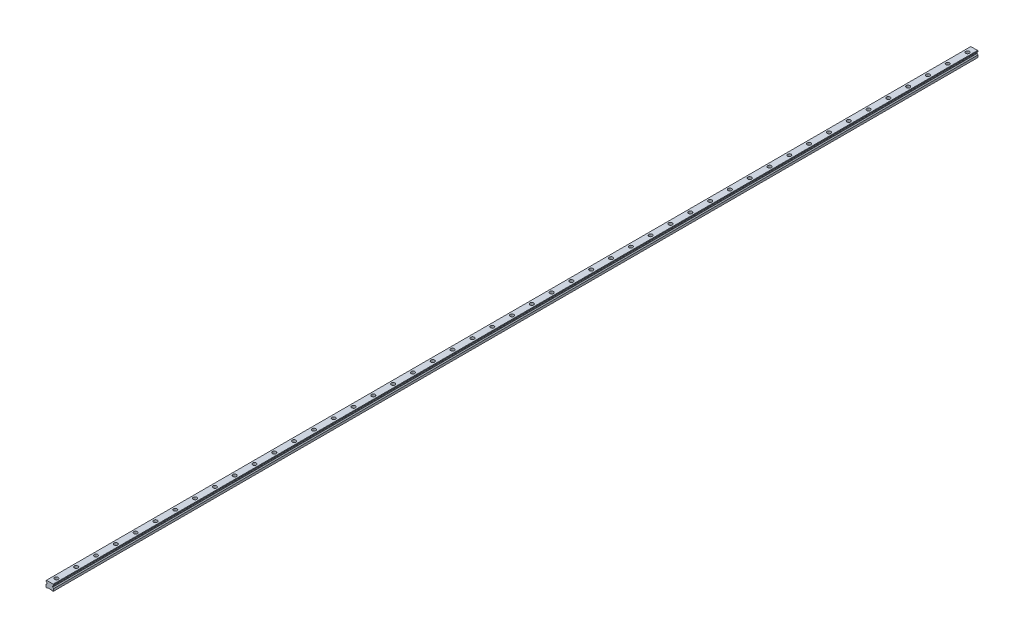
ISO-10303-21;
HEADER;
FILE_DESCRIPTION(('STEP AP214'),'2;1');
FILE_NAME('part.step','',(''),(''),'','','');
FILE_SCHEMA(('AUTOMOTIVE_DESIGN { 1 0 10303 214 1 1 1 1 }'));
ENDSEC;
DATA;
#1=APPLICATION_CONTEXT('core data for automotive mechanical design processes');
#2=APPLICATION_PROTOCOL_DEFINITION('international standard','automotive_design',2000,#1);
#3=PRODUCT_CONTEXT('',#1,'mechanical');
#4=PRODUCT('Part','Part','',(#3));
#5=PRODUCT_RELATED_PRODUCT_CATEGORY('part','',(#4));
#6=PRODUCT_DEFINITION_FORMATION('','',#4);
#7=PRODUCT_DEFINITION_CONTEXT('part definition',#1,'design');
#8=PRODUCT_DEFINITION('design','',#6,#7);
#9=PRODUCT_DEFINITION_SHAPE('','',#8);
#10=(LENGTH_UNIT() NAMED_UNIT(*) SI_UNIT(.MILLI.,.METRE.));
#11=(NAMED_UNIT(*) PLANE_ANGLE_UNIT() SI_UNIT($,.RADIAN.));
#12=(NAMED_UNIT(*) SI_UNIT($,.STERADIAN.) SOLID_ANGLE_UNIT());
#13=UNCERTAINTY_MEASURE_WITH_UNIT(LENGTH_MEASURE(1.E-05),#10,'distance_accuracy_value','');
#14=(GEOMETRIC_REPRESENTATION_CONTEXT(3) GLOBAL_UNCERTAINTY_ASSIGNED_CONTEXT((#13)) GLOBAL_UNIT_ASSIGNED_CONTEXT((#10,
#11,#12)) REPRESENTATION_CONTEXT('',''));
#15=CARTESIAN_POINT('',(0.,0.,0.));
#16=DIRECTION('',(0.,0.,1.));
#17=DIRECTION('',(1.,0.,0.));
#18=AXIS2_PLACEMENT_3D('',#15,#16,#17);
#19=CARTESIAN_POINT('',(0.,10.2,-1380.));
#20=DIRECTION('',(0.,1.,0.));
#21=DIRECTION('',(0.,0.,1.));
#22=AXIS2_PLACEMENT_3D('',#19,#20,#21);
#23=PLANE('',#22);
#24=CARTESIAN_POINT('',(0.,10.2,-1380.));
#25=DIRECTION('',(0.,1.,0.));
#26=DIRECTION('',(0.,0.,1.));
#27=AXIS2_PLACEMENT_3D('',#24,#25,#26);
#28=CIRCLE('',#27,3.49999999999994);
#29=CARTESIAN_POINT('',(0.,10.2,-1376.5));
#30=VERTEX_POINT('',#29);
#31=EDGE_CURVE('E717',#30,#30,#28,.T.);
#32=ORIENTED_EDGE('',*,*,#31,.F.);
#33=EDGE_LOOP('',(#32));
#34=FACE_BOUND('',#33,.T.);
#35=CARTESIAN_POINT('',(0.,10.2,-1380.));
#36=DIRECTION('',(0.,1.,0.));
#37=DIRECTION('',(0.,0.,1.));
#38=AXIS2_PLACEMENT_3D('',#35,#36,#37);
#39=CIRCLE('',#38,5.49999999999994);
#40=CARTESIAN_POINT('',(0.,10.2,-1374.5));
#41=VERTEX_POINT('',#40);
#42=EDGE_CURVE('E11',#41,#41,#39,.T.);
#43=ORIENTED_EDGE('',*,*,#42,.T.);
#44=EDGE_LOOP('',(#43));
#45=FACE_BOUND('',#44,.T.);
#46=ADVANCED_FACE('F39',(#34,#45),#23,.T.);
#47=CARTESIAN_POINT('',(0.,10.2,-1380.));
#48=DIRECTION('',(0.,1.,0.));
#49=DIRECTION('',(0.,0.,1.));
#50=AXIS2_PLACEMENT_3D('',#47,#48,#49);
#51=CYLINDRICAL_SURFACE('',#50,5.49999999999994);
#52=ORIENTED_EDGE('',*,*,#42,.F.);
#53=EDGE_LOOP('',(#52));
#54=FACE_BOUND('',#53,.T.);
#55=CARTESIAN_POINT('',(0.,19.2,-1380.));
#56=DIRECTION('',(0.,1.,0.));
#57=DIRECTION('',(0.,0.,1.));
#58=AXIS2_PLACEMENT_3D('',#55,#56,#57);
#59=CIRCLE('',#58,5.49999999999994);
#60=CARTESIAN_POINT('',(0.,19.2,-1374.5));
#61=VERTEX_POINT('',#60);
#62=EDGE_CURVE('E48',#61,#61,#59,.T.);
#63=ORIENTED_EDGE('',*,*,#62,.T.);
#64=EDGE_LOOP('',(#63));
#65=FACE_BOUND('',#64,.T.);
#66=ADVANCED_FACE('F1308',(#54,#65),#51,.F.);
#67=CARTESIAN_POINT('',(0.,10.2,-1320.));
#68=DIRECTION('',(0.,1.,0.));
#69=DIRECTION('',(0.,0.,1.));
#70=AXIS2_PLACEMENT_3D('',#67,#68,#69);
#71=PLANE('',#70);
#72=CARTESIAN_POINT('',(0.,10.2,-1320.));
#73=DIRECTION('',(0.,1.,0.));
#74=DIRECTION('',(0.,0.,1.));
#75=AXIS2_PLACEMENT_3D('',#72,#73,#74);
#76=CIRCLE('',#75,3.49999999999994);
#77=CARTESIAN_POINT('',(0.,10.2,-1316.5));
#78=VERTEX_POINT('',#77);
#79=EDGE_CURVE('E722',#78,#78,#76,.T.);
#80=ORIENTED_EDGE('',*,*,#79,.F.);
#81=EDGE_LOOP('',(#80));
#82=FACE_BOUND('',#81,.T.);
#83=CARTESIAN_POINT('',(0.,10.2,-1320.));
#84=DIRECTION('',(0.,1.,0.));
#85=DIRECTION('',(0.,0.,1.));
#86=AXIS2_PLACEMENT_3D('',#83,#84,#85);
#87=CIRCLE('',#86,5.49999999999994);
#88=CARTESIAN_POINT('',(0.,10.2,-1314.5));
#89=VERTEX_POINT('',#88);
#90=EDGE_CURVE('E701',#89,#89,#87,.T.);
#91=ORIENTED_EDGE('',*,*,#90,.T.);
#92=EDGE_LOOP('',(#91));
#93=FACE_BOUND('',#92,.T.);
#94=ADVANCED_FACE('F1310',(#82,#93),#71,.T.);
#95=CARTESIAN_POINT('',(0.,10.2,-1320.));
#96=DIRECTION('',(0.,1.,0.));
#97=DIRECTION('',(0.,0.,1.));
#98=AXIS2_PLACEMENT_3D('',#95,#96,#97);
#99=CYLINDRICAL_SURFACE('',#98,5.49999999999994);
#100=ORIENTED_EDGE('',*,*,#90,.F.);
#101=EDGE_LOOP('',(#100));
#102=FACE_BOUND('',#101,.T.);
#103=CARTESIAN_POINT('',(0.,19.2,-1320.));
#104=DIRECTION('',(0.,1.,0.));
#105=DIRECTION('',(0.,0.,1.));
#106=AXIS2_PLACEMENT_3D('',#103,#104,#105);
#107=CIRCLE('',#106,5.49999999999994);
#108=CARTESIAN_POINT('',(0.,19.2,-1314.5));
#109=VERTEX_POINT('',#108);
#110=EDGE_CURVE('E697',#109,#109,#107,.T.);
#111=ORIENTED_EDGE('',*,*,#110,.T.);
#112=EDGE_LOOP('',(#111));
#113=FACE_BOUND('',#112,.T.);
#114=ADVANCED_FACE('F1316',(#102,#113),#99,.F.);
#115=CARTESIAN_POINT('',(0.,10.2,-1260.));
#116=DIRECTION('',(0.,1.,0.));
#117=DIRECTION('',(0.,0.,1.));
#118=AXIS2_PLACEMENT_3D('',#115,#116,#117);
#119=PLANE('',#118);
#120=CARTESIAN_POINT('',(0.,10.2,-1260.));
#121=DIRECTION('',(0.,1.,0.));
#122=DIRECTION('',(0.,0.,1.));
#123=AXIS2_PLACEMENT_3D('',#120,#121,#122);
#124=CIRCLE('',#123,3.49999999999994);
#125=CARTESIAN_POINT('',(0.,10.2,-1256.5));
#126=VERTEX_POINT('',#125);
#127=EDGE_CURVE('E727',#126,#126,#124,.T.);
#128=ORIENTED_EDGE('',*,*,#127,.F.);
#129=EDGE_LOOP('',(#128));
#130=FACE_BOUND('',#129,.T.);
#131=CARTESIAN_POINT('',(0.,10.2,-1260.));
#132=DIRECTION('',(0.,1.,0.));
#133=DIRECTION('',(0.,0.,1.));
#134=AXIS2_PLACEMENT_3D('',#131,#132,#133);
#135=CIRCLE('',#134,5.49999999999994);
#136=CARTESIAN_POINT('',(0.,10.2,-1254.5));
#137=VERTEX_POINT('',#136);
#138=EDGE_CURVE('E693',#137,#137,#135,.T.);
#139=ORIENTED_EDGE('',*,*,#138,.T.);
#140=EDGE_LOOP('',(#139));
#141=FACE_BOUND('',#140,.T.);
#142=ADVANCED_FACE('F1324',(#130,#141),#119,.T.);
#143=CARTESIAN_POINT('',(0.,10.2,-1260.));
#144=DIRECTION('',(0.,1.,0.));
#145=DIRECTION('',(0.,0.,1.));
#146=AXIS2_PLACEMENT_3D('',#143,#144,#145);
#147=CYLINDRICAL_SURFACE('',#146,5.49999999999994);
#148=ORIENTED_EDGE('',*,*,#138,.F.);
#149=EDGE_LOOP('',(#148));
#150=FACE_BOUND('',#149,.T.);
#151=CARTESIAN_POINT('',(0.,19.2,-1260.));
#152=DIRECTION('',(0.,1.,0.));
#153=DIRECTION('',(0.,0.,1.));
#154=AXIS2_PLACEMENT_3D('',#151,#152,#153);
#155=CIRCLE('',#154,5.49999999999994);
#156=CARTESIAN_POINT('',(0.,19.2,-1254.5));
#157=VERTEX_POINT('',#156);
#158=EDGE_CURVE('E689',#157,#157,#155,.T.);
#159=ORIENTED_EDGE('',*,*,#158,.T.);
#160=EDGE_LOOP('',(#159));
#161=FACE_BOUND('',#160,.T.);
#162=ADVANCED_FACE('F1328',(#150,#161),#147,.F.);
#163=CARTESIAN_POINT('',(0.,10.2,-1200.));
#164=DIRECTION('',(0.,1.,0.));
#165=DIRECTION('',(0.,0.,1.));
#166=AXIS2_PLACEMENT_3D('',#163,#164,#165);
#167=PLANE('',#166);
#168=CARTESIAN_POINT('',(0.,10.2,-1200.));
#169=DIRECTION('',(0.,1.,0.));
#170=DIRECTION('',(0.,0.,1.));
#171=AXIS2_PLACEMENT_3D('',#168,#169,#170);
#172=CIRCLE('',#171,3.49999999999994);
#173=CARTESIAN_POINT('',(0.,10.2,-1196.5));
#174=VERTEX_POINT('',#173);
#175=EDGE_CURVE('E732',#174,#174,#172,.T.);
#176=ORIENTED_EDGE('',*,*,#175,.F.);
#177=EDGE_LOOP('',(#176));
#178=FACE_BOUND('',#177,.T.);
#179=CARTESIAN_POINT('',(0.,10.2,-1200.));
#180=DIRECTION('',(0.,1.,0.));
#181=DIRECTION('',(0.,0.,1.));
#182=AXIS2_PLACEMENT_3D('',#179,#180,#181);
#183=CIRCLE('',#182,5.49999999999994);
#184=CARTESIAN_POINT('',(0.,10.2,-1194.5));
#185=VERTEX_POINT('',#184);
#186=EDGE_CURVE('E685',#185,#185,#183,.T.);
#187=ORIENTED_EDGE('',*,*,#186,.T.);
#188=EDGE_LOOP('',(#187));
#189=FACE_BOUND('',#188,.T.);
#190=ADVANCED_FACE('F1332',(#178,#189),#167,.T.);
#191=CARTESIAN_POINT('',(0.,10.2,-1200.));
#192=DIRECTION('',(0.,1.,0.));
#193=DIRECTION('',(0.,0.,1.));
#194=AXIS2_PLACEMENT_3D('',#191,#192,#193);
#195=CYLINDRICAL_SURFACE('',#194,5.49999999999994);
#196=ORIENTED_EDGE('',*,*,#186,.F.);
#197=EDGE_LOOP('',(#196));
#198=FACE_BOUND('',#197,.T.);
#199=CARTESIAN_POINT('',(0.,19.2,-1200.));
#200=DIRECTION('',(0.,1.,0.));
#201=DIRECTION('',(0.,0.,1.));
#202=AXIS2_PLACEMENT_3D('',#199,#200,#201);
#203=CIRCLE('',#202,5.49999999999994);
#204=CARTESIAN_POINT('',(0.,19.2,-1194.5));
#205=VERTEX_POINT('',#204);
#206=EDGE_CURVE('E681',#205,#205,#203,.T.);
#207=ORIENTED_EDGE('',*,*,#206,.T.);
#208=EDGE_LOOP('',(#207));
#209=FACE_BOUND('',#208,.T.);
#210=ADVANCED_FACE('F1336',(#198,#209),#195,.F.);
#211=CARTESIAN_POINT('',(0.,10.2,-1140.));
#212=DIRECTION('',(0.,1.,0.));
#213=DIRECTION('',(0.,0.,1.));
#214=AXIS2_PLACEMENT_3D('',#211,#212,#213);
#215=PLANE('',#214);
#216=CARTESIAN_POINT('',(0.,10.2,-1140.));
#217=DIRECTION('',(0.,1.,0.));
#218=DIRECTION('',(0.,0.,1.));
#219=AXIS2_PLACEMENT_3D('',#216,#217,#218);
#220=CIRCLE('',#219,3.49999999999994);
#221=CARTESIAN_POINT('',(0.,10.2,-1136.5));
#222=VERTEX_POINT('',#221);
#223=EDGE_CURVE('E737',#222,#222,#220,.T.);
#224=ORIENTED_EDGE('',*,*,#223,.F.);
#225=EDGE_LOOP('',(#224));
#226=FACE_BOUND('',#225,.T.);
#227=CARTESIAN_POINT('',(0.,10.2,-1140.));
#228=DIRECTION('',(0.,1.,0.));
#229=DIRECTION('',(0.,0.,1.));
#230=AXIS2_PLACEMENT_3D('',#227,#228,#229);
#231=CIRCLE('',#230,5.49999999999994);
#232=CARTESIAN_POINT('',(0.,10.2,-1134.5));
#233=VERTEX_POINT('',#232);
#234=EDGE_CURVE('E677',#233,#233,#231,.T.);
#235=ORIENTED_EDGE('',*,*,#234,.T.);
#236=EDGE_LOOP('',(#235));
#237=FACE_BOUND('',#236,.T.);
#238=ADVANCED_FACE('F1340',(#226,#237),#215,.T.);
#239=CARTESIAN_POINT('',(0.,10.2,-1140.));
#240=DIRECTION('',(0.,1.,0.));
#241=DIRECTION('',(0.,0.,1.));
#242=AXIS2_PLACEMENT_3D('',#239,#240,#241);
#243=CYLINDRICAL_SURFACE('',#242,5.49999999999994);
#244=ORIENTED_EDGE('',*,*,#234,.F.);
#245=EDGE_LOOP('',(#244));
#246=FACE_BOUND('',#245,.T.);
#247=CARTESIAN_POINT('',(0.,19.2,-1140.));
#248=DIRECTION('',(0.,1.,0.));
#249=DIRECTION('',(0.,0.,1.));
#250=AXIS2_PLACEMENT_3D('',#247,#248,#249);
#251=CIRCLE('',#250,5.49999999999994);
#252=CARTESIAN_POINT('',(0.,19.2,-1134.5));
#253=VERTEX_POINT('',#252);
#254=EDGE_CURVE('E673',#253,#253,#251,.T.);
#255=ORIENTED_EDGE('',*,*,#254,.T.);
#256=EDGE_LOOP('',(#255));
#257=FACE_BOUND('',#256,.T.);
#258=ADVANCED_FACE('F1344',(#246,#257),#243,.F.);
#259=CARTESIAN_POINT('',(0.,10.2,-1080.));
#260=DIRECTION('',(0.,1.,0.));
#261=DIRECTION('',(0.,0.,1.));
#262=AXIS2_PLACEMENT_3D('',#259,#260,#261);
#263=PLANE('',#262);
#264=CARTESIAN_POINT('',(0.,10.2,-1080.));
#265=DIRECTION('',(0.,1.,0.));
#266=DIRECTION('',(0.,0.,1.));
#267=AXIS2_PLACEMENT_3D('',#264,#265,#266);
#268=CIRCLE('',#267,3.49999999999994);
#269=CARTESIAN_POINT('',(0.,10.2,-1076.5));
#270=VERTEX_POINT('',#269);
#271=EDGE_CURVE('E742',#270,#270,#268,.T.);
#272=ORIENTED_EDGE('',*,*,#271,.F.);
#273=EDGE_LOOP('',(#272));
#274=FACE_BOUND('',#273,.T.);
#275=CARTESIAN_POINT('',(0.,10.2,-1080.));
#276=DIRECTION('',(0.,1.,0.));
#277=DIRECTION('',(0.,0.,1.));
#278=AXIS2_PLACEMENT_3D('',#275,#276,#277);
#279=CIRCLE('',#278,5.49999999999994);
#280=CARTESIAN_POINT('',(0.,10.2,-1074.5));
#281=VERTEX_POINT('',#280);
#282=EDGE_CURVE('E669',#281,#281,#279,.T.);
#283=ORIENTED_EDGE('',*,*,#282,.T.);
#284=EDGE_LOOP('',(#283));
#285=FACE_BOUND('',#284,.T.);
#286=ADVANCED_FACE('F1348',(#274,#285),#263,.T.);
#287=CARTESIAN_POINT('',(0.,10.2,-1080.));
#288=DIRECTION('',(0.,1.,0.));
#289=DIRECTION('',(0.,0.,1.));
#290=AXIS2_PLACEMENT_3D('',#287,#288,#289);
#291=CYLINDRICAL_SURFACE('',#290,5.49999999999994);
#292=ORIENTED_EDGE('',*,*,#282,.F.);
#293=EDGE_LOOP('',(#292));
#294=FACE_BOUND('',#293,.T.);
#295=CARTESIAN_POINT('',(0.,19.2,-1080.));
#296=DIRECTION('',(0.,1.,0.));
#297=DIRECTION('',(0.,0.,1.));
#298=AXIS2_PLACEMENT_3D('',#295,#296,#297);
#299=CIRCLE('',#298,5.49999999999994);
#300=CARTESIAN_POINT('',(0.,19.2,-1074.5));
#301=VERTEX_POINT('',#300);
#302=EDGE_CURVE('E665',#301,#301,#299,.T.);
#303=ORIENTED_EDGE('',*,*,#302,.T.);
#304=EDGE_LOOP('',(#303));
#305=FACE_BOUND('',#304,.T.);
#306=ADVANCED_FACE('F1352',(#294,#305),#291,.F.);
#307=CARTESIAN_POINT('',(0.,10.2,-1020.));
#308=DIRECTION('',(0.,1.,0.));
#309=DIRECTION('',(0.,0.,1.));
#310=AXIS2_PLACEMENT_3D('',#307,#308,#309);
#311=PLANE('',#310);
#312=CARTESIAN_POINT('',(0.,10.2,-1020.));
#313=DIRECTION('',(0.,1.,0.));
#314=DIRECTION('',(0.,0.,1.));
#315=AXIS2_PLACEMENT_3D('',#312,#313,#314);
#316=CIRCLE('',#315,3.49999999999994);
#317=CARTESIAN_POINT('',(0.,10.2,-1016.5));
#318=VERTEX_POINT('',#317);
#319=EDGE_CURVE('E747',#318,#318,#316,.T.);
#320=ORIENTED_EDGE('',*,*,#319,.F.);
#321=EDGE_LOOP('',(#320));
#322=FACE_BOUND('',#321,.T.);
#323=CARTESIAN_POINT('',(0.,10.2,-1020.));
#324=DIRECTION('',(0.,1.,0.));
#325=DIRECTION('',(0.,0.,1.));
#326=AXIS2_PLACEMENT_3D('',#323,#324,#325);
#327=CIRCLE('',#326,5.49999999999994);
#328=CARTESIAN_POINT('',(0.,10.2,-1014.5));
#329=VERTEX_POINT('',#328);
#330=EDGE_CURVE('E661',#329,#329,#327,.T.);
#331=ORIENTED_EDGE('',*,*,#330,.T.);
#332=EDGE_LOOP('',(#331));
#333=FACE_BOUND('',#332,.T.);
#334=ADVANCED_FACE('F1356',(#322,#333),#311,.T.);
#335=CARTESIAN_POINT('',(0.,10.2,-1020.));
#336=DIRECTION('',(0.,1.,0.));
#337=DIRECTION('',(0.,0.,1.));
#338=AXIS2_PLACEMENT_3D('',#335,#336,#337);
#339=CYLINDRICAL_SURFACE('',#338,5.49999999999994);
#340=ORIENTED_EDGE('',*,*,#330,.F.);
#341=EDGE_LOOP('',(#340));
#342=FACE_BOUND('',#341,.T.);
#343=CARTESIAN_POINT('',(0.,19.2,-1020.));
#344=DIRECTION('',(0.,1.,0.));
#345=DIRECTION('',(0.,0.,1.));
#346=AXIS2_PLACEMENT_3D('',#343,#344,#345);
#347=CIRCLE('',#346,5.49999999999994);
#348=CARTESIAN_POINT('',(0.,19.2,-1014.5));
#349=VERTEX_POINT('',#348);
#350=EDGE_CURVE('E657',#349,#349,#347,.T.);
#351=ORIENTED_EDGE('',*,*,#350,.T.);
#352=EDGE_LOOP('',(#351));
#353=FACE_BOUND('',#352,.T.);
#354=ADVANCED_FACE('F1360',(#342,#353),#339,.F.);
#355=CARTESIAN_POINT('',(0.,10.2,-960.));
#356=DIRECTION('',(0.,1.,0.));
#357=DIRECTION('',(0.,0.,1.));
#358=AXIS2_PLACEMENT_3D('',#355,#356,#357);
#359=PLANE('',#358);
#360=CARTESIAN_POINT('',(0.,10.2,-960.));
#361=DIRECTION('',(0.,1.,0.));
#362=DIRECTION('',(0.,0.,1.));
#363=AXIS2_PLACEMENT_3D('',#360,#361,#362);
#364=CIRCLE('',#363,3.49999999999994);
#365=CARTESIAN_POINT('',(0.,10.2,-956.5));
#366=VERTEX_POINT('',#365);
#367=EDGE_CURVE('E752',#366,#366,#364,.T.);
#368=ORIENTED_EDGE('',*,*,#367,.F.);
#369=EDGE_LOOP('',(#368));
#370=FACE_BOUND('',#369,.T.);
#371=CARTESIAN_POINT('',(0.,10.2,-960.));
#372=DIRECTION('',(0.,1.,0.));
#373=DIRECTION('',(0.,0.,1.));
#374=AXIS2_PLACEMENT_3D('',#371,#372,#373);
#375=CIRCLE('',#374,5.49999999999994);
#376=CARTESIAN_POINT('',(0.,10.2,-954.5));
#377=VERTEX_POINT('',#376);
#378=EDGE_CURVE('E653',#377,#377,#375,.T.);
#379=ORIENTED_EDGE('',*,*,#378,.T.);
#380=EDGE_LOOP('',(#379));
#381=FACE_BOUND('',#380,.T.);
#382=ADVANCED_FACE('F1364',(#370,#381),#359,.T.);
#383=CARTESIAN_POINT('',(0.,10.2,-960.));
#384=DIRECTION('',(0.,1.,0.));
#385=DIRECTION('',(0.,0.,1.));
#386=AXIS2_PLACEMENT_3D('',#383,#384,#385);
#387=CYLINDRICAL_SURFACE('',#386,5.49999999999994);
#388=ORIENTED_EDGE('',*,*,#378,.F.);
#389=EDGE_LOOP('',(#388));
#390=FACE_BOUND('',#389,.T.);
#391=CARTESIAN_POINT('',(0.,19.2,-960.));
#392=DIRECTION('',(0.,1.,0.));
#393=DIRECTION('',(0.,0.,1.));
#394=AXIS2_PLACEMENT_3D('',#391,#392,#393);
#395=CIRCLE('',#394,5.49999999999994);
#396=CARTESIAN_POINT('',(0.,19.2,-954.5));
#397=VERTEX_POINT('',#396);
#398=EDGE_CURVE('E649',#397,#397,#395,.T.);
#399=ORIENTED_EDGE('',*,*,#398,.T.);
#400=EDGE_LOOP('',(#399));
#401=FACE_BOUND('',#400,.T.);
#402=ADVANCED_FACE('F1368',(#390,#401),#387,.F.);
#403=CARTESIAN_POINT('',(0.,10.2,-900.));
#404=DIRECTION('',(0.,1.,0.));
#405=DIRECTION('',(0.,0.,1.));
#406=AXIS2_PLACEMENT_3D('',#403,#404,#405);
#407=PLANE('',#406);
#408=CARTESIAN_POINT('',(0.,10.2,-900.));
#409=DIRECTION('',(0.,1.,0.));
#410=DIRECTION('',(0.,0.,1.));
#411=AXIS2_PLACEMENT_3D('',#408,#409,#410);
#412=CIRCLE('',#411,3.49999999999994);
#413=CARTESIAN_POINT('',(0.,10.2,-896.5));
#414=VERTEX_POINT('',#413);
#415=EDGE_CURVE('E757',#414,#414,#412,.T.);
#416=ORIENTED_EDGE('',*,*,#415,.F.);
#417=EDGE_LOOP('',(#416));
#418=FACE_BOUND('',#417,.T.);
#419=CARTESIAN_POINT('',(0.,10.2,-900.));
#420=DIRECTION('',(0.,1.,0.));
#421=DIRECTION('',(0.,0.,1.));
#422=AXIS2_PLACEMENT_3D('',#419,#420,#421);
#423=CIRCLE('',#422,5.49999999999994);
#424=CARTESIAN_POINT('',(0.,10.2,-894.5));
#425=VERTEX_POINT('',#424);
#426=EDGE_CURVE('E645',#425,#425,#423,.T.);
#427=ORIENTED_EDGE('',*,*,#426,.T.);
#428=EDGE_LOOP('',(#427));
#429=FACE_BOUND('',#428,.T.);
#430=ADVANCED_FACE('F1372',(#418,#429),#407,.T.);
#431=CARTESIAN_POINT('',(0.,10.2,-900.));
#432=DIRECTION('',(0.,1.,0.));
#433=DIRECTION('',(0.,0.,1.));
#434=AXIS2_PLACEMENT_3D('',#431,#432,#433);
#435=CYLINDRICAL_SURFACE('',#434,5.49999999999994);
#436=ORIENTED_EDGE('',*,*,#426,.F.);
#437=EDGE_LOOP('',(#436));
#438=FACE_BOUND('',#437,.T.);
#439=CARTESIAN_POINT('',(0.,19.2,-900.));
#440=DIRECTION('',(0.,1.,0.));
#441=DIRECTION('',(0.,0.,1.));
#442=AXIS2_PLACEMENT_3D('',#439,#440,#441);
#443=CIRCLE('',#442,5.49999999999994);
#444=CARTESIAN_POINT('',(0.,19.2,-894.5));
#445=VERTEX_POINT('',#444);
#446=EDGE_CURVE('E641',#445,#445,#443,.T.);
#447=ORIENTED_EDGE('',*,*,#446,.T.);
#448=EDGE_LOOP('',(#447));
#449=FACE_BOUND('',#448,.T.);
#450=ADVANCED_FACE('F1376',(#438,#449),#435,.F.);
#451=CARTESIAN_POINT('',(0.,10.2,-840.));
#452=DIRECTION('',(0.,1.,0.));
#453=DIRECTION('',(0.,0.,1.));
#454=AXIS2_PLACEMENT_3D('',#451,#452,#453);
#455=PLANE('',#454);
#456=CARTESIAN_POINT('',(0.,10.2,-840.));
#457=DIRECTION('',(0.,1.,0.));
#458=DIRECTION('',(0.,0.,1.));
#459=AXIS2_PLACEMENT_3D('',#456,#457,#458);
#460=CIRCLE('',#459,3.49999999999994);
#461=CARTESIAN_POINT('',(0.,10.2,-836.5));
#462=VERTEX_POINT('',#461);
#463=EDGE_CURVE('E762',#462,#462,#460,.T.);
#464=ORIENTED_EDGE('',*,*,#463,.F.);
#465=EDGE_LOOP('',(#464));
#466=FACE_BOUND('',#465,.T.);
#467=CARTESIAN_POINT('',(0.,10.2,-840.));
#468=DIRECTION('',(0.,1.,0.));
#469=DIRECTION('',(0.,0.,1.));
#470=AXIS2_PLACEMENT_3D('',#467,#468,#469);
#471=CIRCLE('',#470,5.49999999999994);
#472=CARTESIAN_POINT('',(0.,10.2,-834.5));
#473=VERTEX_POINT('',#472);
#474=EDGE_CURVE('E637',#473,#473,#471,.T.);
#475=ORIENTED_EDGE('',*,*,#474,.T.);
#476=EDGE_LOOP('',(#475));
#477=FACE_BOUND('',#476,.T.);
#478=ADVANCED_FACE('F1380',(#466,#477),#455,.T.);
#479=CARTESIAN_POINT('',(0.,10.2,-840.));
#480=DIRECTION('',(0.,1.,0.));
#481=DIRECTION('',(0.,0.,1.));
#482=AXIS2_PLACEMENT_3D('',#479,#480,#481);
#483=CYLINDRICAL_SURFACE('',#482,5.49999999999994);
#484=ORIENTED_EDGE('',*,*,#474,.F.);
#485=EDGE_LOOP('',(#484));
#486=FACE_BOUND('',#485,.T.);
#487=CARTESIAN_POINT('',(0.,19.2,-840.));
#488=DIRECTION('',(0.,1.,0.));
#489=DIRECTION('',(0.,0.,1.));
#490=AXIS2_PLACEMENT_3D('',#487,#488,#489);
#491=CIRCLE('',#490,5.49999999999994);
#492=CARTESIAN_POINT('',(0.,19.2,-834.5));
#493=VERTEX_POINT('',#492);
#494=EDGE_CURVE('E633',#493,#493,#491,.T.);
#495=ORIENTED_EDGE('',*,*,#494,.T.);
#496=EDGE_LOOP('',(#495));
#497=FACE_BOUND('',#496,.T.);
#498=ADVANCED_FACE('F1384',(#486,#497),#483,.F.);
#499=CARTESIAN_POINT('',(0.,10.2,-780.));
#500=DIRECTION('',(0.,1.,0.));
#501=DIRECTION('',(0.,0.,1.));
#502=AXIS2_PLACEMENT_3D('',#499,#500,#501);
#503=PLANE('',#502);
#504=CARTESIAN_POINT('',(0.,10.2,-780.));
#505=DIRECTION('',(0.,1.,0.));
#506=DIRECTION('',(0.,0.,1.));
#507=AXIS2_PLACEMENT_3D('',#504,#505,#506);
#508=CIRCLE('',#507,3.49999999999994);
#509=CARTESIAN_POINT('',(0.,10.2,-776.5));
#510=VERTEX_POINT('',#509);
#511=EDGE_CURVE('E767',#510,#510,#508,.T.);
#512=ORIENTED_EDGE('',*,*,#511,.F.);
#513=EDGE_LOOP('',(#512));
#514=FACE_BOUND('',#513,.T.);
#515=CARTESIAN_POINT('',(0.,10.2,-780.));
#516=DIRECTION('',(0.,1.,0.));
#517=DIRECTION('',(0.,0.,1.));
#518=AXIS2_PLACEMENT_3D('',#515,#516,#517);
#519=CIRCLE('',#518,5.49999999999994);
#520=CARTESIAN_POINT('',(0.,10.2,-774.5));
#521=VERTEX_POINT('',#520);
#522=EDGE_CURVE('E629',#521,#521,#519,.T.);
#523=ORIENTED_EDGE('',*,*,#522,.T.);
#524=EDGE_LOOP('',(#523));
#525=FACE_BOUND('',#524,.T.);
#526=ADVANCED_FACE('F1388',(#514,#525),#503,.T.);
#527=CARTESIAN_POINT('',(0.,10.2,-780.));
#528=DIRECTION('',(0.,1.,0.));
#529=DIRECTION('',(0.,0.,1.));
#530=AXIS2_PLACEMENT_3D('',#527,#528,#529);
#531=CYLINDRICAL_SURFACE('',#530,5.49999999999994);
#532=ORIENTED_EDGE('',*,*,#522,.F.);
#533=EDGE_LOOP('',(#532));
#534=FACE_BOUND('',#533,.T.);
#535=CARTESIAN_POINT('',(0.,19.2,-780.));
#536=DIRECTION('',(0.,1.,0.));
#537=DIRECTION('',(0.,0.,1.));
#538=AXIS2_PLACEMENT_3D('',#535,#536,#537);
#539=CIRCLE('',#538,5.49999999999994);
#540=CARTESIAN_POINT('',(0.,19.2,-774.5));
#541=VERTEX_POINT('',#540);
#542=EDGE_CURVE('E625',#541,#541,#539,.T.);
#543=ORIENTED_EDGE('',*,*,#542,.T.);
#544=EDGE_LOOP('',(#543));
#545=FACE_BOUND('',#544,.T.);
#546=ADVANCED_FACE('F1392',(#534,#545),#531,.F.);
#547=CARTESIAN_POINT('',(0.,10.2,-720.));
#548=DIRECTION('',(0.,1.,0.));
#549=DIRECTION('',(0.,0.,1.));
#550=AXIS2_PLACEMENT_3D('',#547,#548,#549);
#551=PLANE('',#550);
#552=CARTESIAN_POINT('',(0.,10.2,-720.));
#553=DIRECTION('',(0.,1.,0.));
#554=DIRECTION('',(0.,0.,1.));
#555=AXIS2_PLACEMENT_3D('',#552,#553,#554);
#556=CIRCLE('',#555,3.49999999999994);
#557=CARTESIAN_POINT('',(0.,10.2,-716.5));
#558=VERTEX_POINT('',#557);
#559=EDGE_CURVE('E772',#558,#558,#556,.T.);
#560=ORIENTED_EDGE('',*,*,#559,.F.);
#561=EDGE_LOOP('',(#560));
#562=FACE_BOUND('',#561,.T.);
#563=CARTESIAN_POINT('',(0.,10.2,-720.));
#564=DIRECTION('',(0.,1.,0.));
#565=DIRECTION('',(0.,0.,1.));
#566=AXIS2_PLACEMENT_3D('',#563,#564,#565);
#567=CIRCLE('',#566,5.49999999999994);
#568=CARTESIAN_POINT('',(0.,10.2,-714.5));
#569=VERTEX_POINT('',#568);
#570=EDGE_CURVE('E621',#569,#569,#567,.T.);
#571=ORIENTED_EDGE('',*,*,#570,.T.);
#572=EDGE_LOOP('',(#571));
#573=FACE_BOUND('',#572,.T.);
#574=ADVANCED_FACE('F1396',(#562,#573),#551,.T.);
#575=CARTESIAN_POINT('',(0.,10.2,-720.));
#576=DIRECTION('',(0.,1.,0.));
#577=DIRECTION('',(0.,0.,1.));
#578=AXIS2_PLACEMENT_3D('',#575,#576,#577);
#579=CYLINDRICAL_SURFACE('',#578,5.49999999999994);
#580=ORIENTED_EDGE('',*,*,#570,.F.);
#581=EDGE_LOOP('',(#580));
#582=FACE_BOUND('',#581,.T.);
#583=CARTESIAN_POINT('',(0.,19.2,-720.));
#584=DIRECTION('',(0.,1.,0.));
#585=DIRECTION('',(0.,0.,1.));
#586=AXIS2_PLACEMENT_3D('',#583,#584,#585);
#587=CIRCLE('',#586,5.49999999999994);
#588=CARTESIAN_POINT('',(0.,19.2,-714.5));
#589=VERTEX_POINT('',#588);
#590=EDGE_CURVE('E617',#589,#589,#587,.T.);
#591=ORIENTED_EDGE('',*,*,#590,.T.);
#592=EDGE_LOOP('',(#591));
#593=FACE_BOUND('',#592,.T.);
#594=ADVANCED_FACE('F1400',(#582,#593),#579,.F.);
#595=CARTESIAN_POINT('',(0.,10.2,-660.));
#596=DIRECTION('',(0.,1.,0.));
#597=DIRECTION('',(0.,0.,1.));
#598=AXIS2_PLACEMENT_3D('',#595,#596,#597);
#599=PLANE('',#598);
#600=CARTESIAN_POINT('',(0.,10.2,-660.));
#601=DIRECTION('',(0.,1.,0.));
#602=DIRECTION('',(0.,0.,1.));
#603=AXIS2_PLACEMENT_3D('',#600,#601,#602);
#604=CIRCLE('',#603,3.49999999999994);
#605=CARTESIAN_POINT('',(0.,10.2,-656.5));
#606=VERTEX_POINT('',#605);
#607=EDGE_CURVE('E777',#606,#606,#604,.T.);
#608=ORIENTED_EDGE('',*,*,#607,.F.);
#609=EDGE_LOOP('',(#608));
#610=FACE_BOUND('',#609,.T.);
#611=CARTESIAN_POINT('',(0.,10.2,-660.));
#612=DIRECTION('',(0.,1.,0.));
#613=DIRECTION('',(0.,0.,1.));
#614=AXIS2_PLACEMENT_3D('',#611,#612,#613);
#615=CIRCLE('',#614,5.49999999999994);
#616=CARTESIAN_POINT('',(0.,10.2,-654.5));
#617=VERTEX_POINT('',#616);
#618=EDGE_CURVE('E613',#617,#617,#615,.T.);
#619=ORIENTED_EDGE('',*,*,#618,.T.);
#620=EDGE_LOOP('',(#619));
#621=FACE_BOUND('',#620,.T.);
#622=ADVANCED_FACE('F1404',(#610,#621),#599,.T.);
#623=CARTESIAN_POINT('',(0.,10.2,-660.));
#624=DIRECTION('',(0.,1.,0.));
#625=DIRECTION('',(0.,0.,1.));
#626=AXIS2_PLACEMENT_3D('',#623,#624,#625);
#627=CYLINDRICAL_SURFACE('',#626,5.49999999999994);
#628=ORIENTED_EDGE('',*,*,#618,.F.);
#629=EDGE_LOOP('',(#628));
#630=FACE_BOUND('',#629,.T.);
#631=CARTESIAN_POINT('',(0.,19.2,-660.));
#632=DIRECTION('',(0.,1.,0.));
#633=DIRECTION('',(0.,0.,1.));
#634=AXIS2_PLACEMENT_3D('',#631,#632,#633);
#635=CIRCLE('',#634,5.49999999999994);
#636=CARTESIAN_POINT('',(0.,19.2,-654.5));
#637=VERTEX_POINT('',#636);
#638=EDGE_CURVE('E609',#637,#637,#635,.T.);
#639=ORIENTED_EDGE('',*,*,#638,.T.);
#640=EDGE_LOOP('',(#639));
#641=FACE_BOUND('',#640,.T.);
#642=ADVANCED_FACE('F1408',(#630,#641),#627,.F.);
#643=CARTESIAN_POINT('',(0.,10.2,-600.));
#644=DIRECTION('',(0.,1.,0.));
#645=DIRECTION('',(0.,0.,1.));
#646=AXIS2_PLACEMENT_3D('',#643,#644,#645);
#647=PLANE('',#646);
#648=CARTESIAN_POINT('',(0.,10.2,-600.));
#649=DIRECTION('',(0.,1.,0.));
#650=DIRECTION('',(0.,0.,1.));
#651=AXIS2_PLACEMENT_3D('',#648,#649,#650);
#652=CIRCLE('',#651,3.49999999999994);
#653=CARTESIAN_POINT('',(0.,10.2,-596.5));
#654=VERTEX_POINT('',#653);
#655=EDGE_CURVE('E782',#654,#654,#652,.T.);
#656=ORIENTED_EDGE('',*,*,#655,.F.);
#657=EDGE_LOOP('',(#656));
#658=FACE_BOUND('',#657,.T.);
#659=CARTESIAN_POINT('',(0.,10.2,-600.));
#660=DIRECTION('',(0.,1.,0.));
#661=DIRECTION('',(0.,0.,1.));
#662=AXIS2_PLACEMENT_3D('',#659,#660,#661);
#663=CIRCLE('',#662,5.49999999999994);
#664=CARTESIAN_POINT('',(0.,10.2,-594.5));
#665=VERTEX_POINT('',#664);
#666=EDGE_CURVE('E605',#665,#665,#663,.T.);
#667=ORIENTED_EDGE('',*,*,#666,.T.);
#668=EDGE_LOOP('',(#667));
#669=FACE_BOUND('',#668,.T.);
#670=ADVANCED_FACE('F1412',(#658,#669),#647,.T.);
#671=CARTESIAN_POINT('',(0.,10.2,-600.));
#672=DIRECTION('',(0.,1.,0.));
#673=DIRECTION('',(0.,0.,1.));
#674=AXIS2_PLACEMENT_3D('',#671,#672,#673);
#675=CYLINDRICAL_SURFACE('',#674,5.49999999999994);
#676=ORIENTED_EDGE('',*,*,#666,.F.);
#677=EDGE_LOOP('',(#676));
#678=FACE_BOUND('',#677,.T.);
#679=CARTESIAN_POINT('',(0.,19.2,-600.));
#680=DIRECTION('',(0.,1.,0.));
#681=DIRECTION('',(0.,0.,1.));
#682=AXIS2_PLACEMENT_3D('',#679,#680,#681);
#683=CIRCLE('',#682,5.49999999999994);
#684=CARTESIAN_POINT('',(0.,19.2,-594.5));
#685=VERTEX_POINT('',#684);
#686=EDGE_CURVE('E601',#685,#685,#683,.T.);
#687=ORIENTED_EDGE('',*,*,#686,.T.);
#688=EDGE_LOOP('',(#687));
#689=FACE_BOUND('',#688,.T.);
#690=ADVANCED_FACE('F1416',(#678,#689),#675,.F.);
#691=CARTESIAN_POINT('',(0.,10.2,-540.));
#692=DIRECTION('',(0.,1.,0.));
#693=DIRECTION('',(0.,0.,1.));
#694=AXIS2_PLACEMENT_3D('',#691,#692,#693);
#695=PLANE('',#694);
#696=CARTESIAN_POINT('',(0.,10.2,-540.));
#697=DIRECTION('',(0.,1.,0.));
#698=DIRECTION('',(0.,0.,1.));
#699=AXIS2_PLACEMENT_3D('',#696,#697,#698);
#700=CIRCLE('',#699,3.49999999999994);
#701=CARTESIAN_POINT('',(0.,10.2,-536.5));
#702=VERTEX_POINT('',#701);
#703=EDGE_CURVE('E787',#702,#702,#700,.T.);
#704=ORIENTED_EDGE('',*,*,#703,.F.);
#705=EDGE_LOOP('',(#704));
#706=FACE_BOUND('',#705,.T.);
#707=CARTESIAN_POINT('',(0.,10.2,-540.));
#708=DIRECTION('',(0.,1.,0.));
#709=DIRECTION('',(0.,0.,1.));
#710=AXIS2_PLACEMENT_3D('',#707,#708,#709);
#711=CIRCLE('',#710,5.49999999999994);
#712=CARTESIAN_POINT('',(0.,10.2,-534.5));
#713=VERTEX_POINT('',#712);
#714=EDGE_CURVE('E597',#713,#713,#711,.T.);
#715=ORIENTED_EDGE('',*,*,#714,.T.);
#716=EDGE_LOOP('',(#715));
#717=FACE_BOUND('',#716,.T.);
#718=ADVANCED_FACE('F1420',(#706,#717),#695,.T.);
#719=CARTESIAN_POINT('',(0.,10.2,-540.));
#720=DIRECTION('',(0.,1.,0.));
#721=DIRECTION('',(0.,0.,1.));
#722=AXIS2_PLACEMENT_3D('',#719,#720,#721);
#723=CYLINDRICAL_SURFACE('',#722,5.49999999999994);
#724=ORIENTED_EDGE('',*,*,#714,.F.);
#725=EDGE_LOOP('',(#724));
#726=FACE_BOUND('',#725,.T.);
#727=CARTESIAN_POINT('',(0.,19.2,-540.));
#728=DIRECTION('',(0.,1.,0.));
#729=DIRECTION('',(0.,0.,1.));
#730=AXIS2_PLACEMENT_3D('',#727,#728,#729);
#731=CIRCLE('',#730,5.49999999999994);
#732=CARTESIAN_POINT('',(0.,19.2,-534.5));
#733=VERTEX_POINT('',#732);
#734=EDGE_CURVE('E593',#733,#733,#731,.T.);
#735=ORIENTED_EDGE('',*,*,#734,.T.);
#736=EDGE_LOOP('',(#735));
#737=FACE_BOUND('',#736,.T.);
#738=ADVANCED_FACE('F1424',(#726,#737),#723,.F.);
#739=CARTESIAN_POINT('',(0.,10.2,-480.));
#740=DIRECTION('',(0.,1.,0.));
#741=DIRECTION('',(0.,0.,1.));
#742=AXIS2_PLACEMENT_3D('',#739,#740,#741);
#743=PLANE('',#742);
#744=CARTESIAN_POINT('',(0.,10.2,-480.));
#745=DIRECTION('',(0.,1.,0.));
#746=DIRECTION('',(0.,0.,1.));
#747=AXIS2_PLACEMENT_3D('',#744,#745,#746);
#748=CIRCLE('',#747,3.49999999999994);
#749=CARTESIAN_POINT('',(0.,10.2,-476.5));
#750=VERTEX_POINT('',#749);
#751=EDGE_CURVE('E792',#750,#750,#748,.T.);
#752=ORIENTED_EDGE('',*,*,#751,.F.);
#753=EDGE_LOOP('',(#752));
#754=FACE_BOUND('',#753,.T.);
#755=CARTESIAN_POINT('',(0.,10.2,-480.));
#756=DIRECTION('',(0.,1.,0.));
#757=DIRECTION('',(0.,0.,1.));
#758=AXIS2_PLACEMENT_3D('',#755,#756,#757);
#759=CIRCLE('',#758,5.49999999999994);
#760=CARTESIAN_POINT('',(0.,10.2,-474.5));
#761=VERTEX_POINT('',#760);
#762=EDGE_CURVE('E589',#761,#761,#759,.T.);
#763=ORIENTED_EDGE('',*,*,#762,.T.);
#764=EDGE_LOOP('',(#763));
#765=FACE_BOUND('',#764,.T.);
#766=ADVANCED_FACE('F1428',(#754,#765),#743,.T.);
#767=CARTESIAN_POINT('',(0.,10.2,-480.));
#768=DIRECTION('',(0.,1.,0.));
#769=DIRECTION('',(0.,0.,1.));
#770=AXIS2_PLACEMENT_3D('',#767,#768,#769);
#771=CYLINDRICAL_SURFACE('',#770,5.49999999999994);
#772=ORIENTED_EDGE('',*,*,#762,.F.);
#773=EDGE_LOOP('',(#772));
#774=FACE_BOUND('',#773,.T.);
#775=CARTESIAN_POINT('',(0.,19.2,-480.));
#776=DIRECTION('',(0.,1.,0.));
#777=DIRECTION('',(0.,0.,1.));
#778=AXIS2_PLACEMENT_3D('',#775,#776,#777);
#779=CIRCLE('',#778,5.49999999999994);
#780=CARTESIAN_POINT('',(0.,19.2,-474.5));
#781=VERTEX_POINT('',#780);
#782=EDGE_CURVE('E585',#781,#781,#779,.T.);
#783=ORIENTED_EDGE('',*,*,#782,.T.);
#784=EDGE_LOOP('',(#783));
#785=FACE_BOUND('',#784,.T.);
#786=ADVANCED_FACE('F1432',(#774,#785),#771,.F.);
#787=CARTESIAN_POINT('',(0.,10.2,-420.));
#788=DIRECTION('',(0.,1.,0.));
#789=DIRECTION('',(0.,0.,1.));
#790=AXIS2_PLACEMENT_3D('',#787,#788,#789);
#791=PLANE('',#790);
#792=CARTESIAN_POINT('',(0.,10.2,-420.));
#793=DIRECTION('',(0.,1.,0.));
#794=DIRECTION('',(0.,0.,1.));
#795=AXIS2_PLACEMENT_3D('',#792,#793,#794);
#796=CIRCLE('',#795,3.49999999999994);
#797=CARTESIAN_POINT('',(0.,10.2,-416.5));
#798=VERTEX_POINT('',#797);
#799=EDGE_CURVE('E797',#798,#798,#796,.T.);
#800=ORIENTED_EDGE('',*,*,#799,.F.);
#801=EDGE_LOOP('',(#800));
#802=FACE_BOUND('',#801,.T.);
#803=CARTESIAN_POINT('',(0.,10.2,-420.));
#804=DIRECTION('',(0.,1.,0.));
#805=DIRECTION('',(0.,0.,1.));
#806=AXIS2_PLACEMENT_3D('',#803,#804,#805);
#807=CIRCLE('',#806,5.49999999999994);
#808=CARTESIAN_POINT('',(0.,10.2,-414.5));
#809=VERTEX_POINT('',#808);
#810=EDGE_CURVE('E581',#809,#809,#807,.T.);
#811=ORIENTED_EDGE('',*,*,#810,.T.);
#812=EDGE_LOOP('',(#811));
#813=FACE_BOUND('',#812,.T.);
#814=ADVANCED_FACE('F1436',(#802,#813),#791,.T.);
#815=CARTESIAN_POINT('',(0.,10.2,-420.));
#816=DIRECTION('',(0.,1.,0.));
#817=DIRECTION('',(0.,0.,1.));
#818=AXIS2_PLACEMENT_3D('',#815,#816,#817);
#819=CYLINDRICAL_SURFACE('',#818,5.49999999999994);
#820=ORIENTED_EDGE('',*,*,#810,.F.);
#821=EDGE_LOOP('',(#820));
#822=FACE_BOUND('',#821,.T.);
#823=CARTESIAN_POINT('',(0.,19.2,-420.));
#824=DIRECTION('',(0.,1.,0.));
#825=DIRECTION('',(0.,0.,1.));
#826=AXIS2_PLACEMENT_3D('',#823,#824,#825);
#827=CIRCLE('',#826,5.49999999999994);
#828=CARTESIAN_POINT('',(0.,19.2,-414.5));
#829=VERTEX_POINT('',#828);
#830=EDGE_CURVE('E577',#829,#829,#827,.T.);
#831=ORIENTED_EDGE('',*,*,#830,.T.);
#832=EDGE_LOOP('',(#831));
#833=FACE_BOUND('',#832,.T.);
#834=ADVANCED_FACE('F1440',(#822,#833),#819,.F.);
#835=CARTESIAN_POINT('',(0.,10.2,-360.));
#836=DIRECTION('',(0.,1.,0.));
#837=DIRECTION('',(0.,0.,1.));
#838=AXIS2_PLACEMENT_3D('',#835,#836,#837);
#839=PLANE('',#838);
#840=CARTESIAN_POINT('',(0.,10.2,-360.));
#841=DIRECTION('',(0.,1.,0.));
#842=DIRECTION('',(0.,0.,1.));
#843=AXIS2_PLACEMENT_3D('',#840,#841,#842);
#844=CIRCLE('',#843,3.49999999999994);
#845=CARTESIAN_POINT('',(0.,10.2,-356.5));
#846=VERTEX_POINT('',#845);
#847=EDGE_CURVE('E802',#846,#846,#844,.T.);
#848=ORIENTED_EDGE('',*,*,#847,.F.);
#849=EDGE_LOOP('',(#848));
#850=FACE_BOUND('',#849,.T.);
#851=CARTESIAN_POINT('',(0.,10.2,-360.));
#852=DIRECTION('',(0.,1.,0.));
#853=DIRECTION('',(0.,0.,1.));
#854=AXIS2_PLACEMENT_3D('',#851,#852,#853);
#855=CIRCLE('',#854,5.49999999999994);
#856=CARTESIAN_POINT('',(0.,10.2,-354.5));
#857=VERTEX_POINT('',#856);
#858=EDGE_CURVE('E573',#857,#857,#855,.T.);
#859=ORIENTED_EDGE('',*,*,#858,.T.);
#860=EDGE_LOOP('',(#859));
#861=FACE_BOUND('',#860,.T.);
#862=ADVANCED_FACE('F1444',(#850,#861),#839,.T.);
#863=CARTESIAN_POINT('',(0.,10.2,-360.));
#864=DIRECTION('',(0.,1.,0.));
#865=DIRECTION('',(0.,0.,1.));
#866=AXIS2_PLACEMENT_3D('',#863,#864,#865);
#867=CYLINDRICAL_SURFACE('',#866,5.49999999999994);
#868=ORIENTED_EDGE('',*,*,#858,.F.);
#869=EDGE_LOOP('',(#868));
#870=FACE_BOUND('',#869,.T.);
#871=CARTESIAN_POINT('',(0.,19.2,-360.));
#872=DIRECTION('',(0.,1.,0.));
#873=DIRECTION('',(0.,0.,1.));
#874=AXIS2_PLACEMENT_3D('',#871,#872,#873);
#875=CIRCLE('',#874,5.49999999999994);
#876=CARTESIAN_POINT('',(0.,19.2,-354.5));
#877=VERTEX_POINT('',#876);
#878=EDGE_CURVE('E569',#877,#877,#875,.T.);
#879=ORIENTED_EDGE('',*,*,#878,.T.);
#880=EDGE_LOOP('',(#879));
#881=FACE_BOUND('',#880,.T.);
#882=ADVANCED_FACE('F1448',(#870,#881),#867,.F.);
#883=CARTESIAN_POINT('',(0.,10.2,-300.));
#884=DIRECTION('',(0.,1.,0.));
#885=DIRECTION('',(0.,0.,1.));
#886=AXIS2_PLACEMENT_3D('',#883,#884,#885);
#887=PLANE('',#886);
#888=CARTESIAN_POINT('',(0.,10.2,-300.));
#889=DIRECTION('',(0.,1.,0.));
#890=DIRECTION('',(0.,0.,1.));
#891=AXIS2_PLACEMENT_3D('',#888,#889,#890);
#892=CIRCLE('',#891,3.49999999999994);
#893=CARTESIAN_POINT('',(0.,10.2,-296.5));
#894=VERTEX_POINT('',#893);
#895=EDGE_CURVE('E807',#894,#894,#892,.T.);
#896=ORIENTED_EDGE('',*,*,#895,.F.);
#897=EDGE_LOOP('',(#896));
#898=FACE_BOUND('',#897,.T.);
#899=CARTESIAN_POINT('',(0.,10.2,-300.));
#900=DIRECTION('',(0.,1.,0.));
#901=DIRECTION('',(0.,0.,1.));
#902=AXIS2_PLACEMENT_3D('',#899,#900,#901);
#903=CIRCLE('',#902,5.49999999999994);
#904=CARTESIAN_POINT('',(0.,10.2,-294.5));
#905=VERTEX_POINT('',#904);
#906=EDGE_CURVE('E565',#905,#905,#903,.T.);
#907=ORIENTED_EDGE('',*,*,#906,.T.);
#908=EDGE_LOOP('',(#907));
#909=FACE_BOUND('',#908,.T.);
#910=ADVANCED_FACE('F1452',(#898,#909),#887,.T.);
#911=CARTESIAN_POINT('',(0.,10.2,-300.));
#912=DIRECTION('',(0.,1.,0.));
#913=DIRECTION('',(0.,0.,1.));
#914=AXIS2_PLACEMENT_3D('',#911,#912,#913);
#915=CYLINDRICAL_SURFACE('',#914,5.49999999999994);
#916=ORIENTED_EDGE('',*,*,#906,.F.);
#917=EDGE_LOOP('',(#916));
#918=FACE_BOUND('',#917,.T.);
#919=CARTESIAN_POINT('',(0.,19.2,-300.));
#920=DIRECTION('',(0.,1.,0.));
#921=DIRECTION('',(0.,0.,1.));
#922=AXIS2_PLACEMENT_3D('',#919,#920,#921);
#923=CIRCLE('',#922,5.49999999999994);
#924=CARTESIAN_POINT('',(0.,19.2,-294.5));
#925=VERTEX_POINT('',#924);
#926=EDGE_CURVE('E561',#925,#925,#923,.T.);
#927=ORIENTED_EDGE('',*,*,#926,.T.);
#928=EDGE_LOOP('',(#927));
#929=FACE_BOUND('',#928,.T.);
#930=ADVANCED_FACE('F1456',(#918,#929),#915,.F.);
#931=CARTESIAN_POINT('',(0.,10.2,-240.));
#932=DIRECTION('',(0.,1.,0.));
#933=DIRECTION('',(0.,0.,1.));
#934=AXIS2_PLACEMENT_3D('',#931,#932,#933);
#935=PLANE('',#934);
#936=CARTESIAN_POINT('',(0.,10.2,-240.));
#937=DIRECTION('',(0.,1.,0.));
#938=DIRECTION('',(0.,0.,1.));
#939=AXIS2_PLACEMENT_3D('',#936,#937,#938);
#940=CIRCLE('',#939,3.49999999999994);
#941=CARTESIAN_POINT('',(0.,10.2,-236.5));
#942=VERTEX_POINT('',#941);
#943=EDGE_CURVE('E812',#942,#942,#940,.T.);
#944=ORIENTED_EDGE('',*,*,#943,.F.);
#945=EDGE_LOOP('',(#944));
#946=FACE_BOUND('',#945,.T.);
#947=CARTESIAN_POINT('',(0.,10.2,-240.));
#948=DIRECTION('',(0.,1.,0.));
#949=DIRECTION('',(0.,0.,1.));
#950=AXIS2_PLACEMENT_3D('',#947,#948,#949);
#951=CIRCLE('',#950,5.49999999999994);
#952=CARTESIAN_POINT('',(0.,10.2,-234.5));
#953=VERTEX_POINT('',#952);
#954=EDGE_CURVE('E557',#953,#953,#951,.T.);
#955=ORIENTED_EDGE('',*,*,#954,.T.);
#956=EDGE_LOOP('',(#955));
#957=FACE_BOUND('',#956,.T.);
#958=ADVANCED_FACE('F1460',(#946,#957),#935,.T.);
#959=CARTESIAN_POINT('',(0.,10.2,-240.));
#960=DIRECTION('',(0.,1.,0.));
#961=DIRECTION('',(0.,0.,1.));
#962=AXIS2_PLACEMENT_3D('',#959,#960,#961);
#963=CYLINDRICAL_SURFACE('',#962,5.49999999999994);
#964=ORIENTED_EDGE('',*,*,#954,.F.);
#965=EDGE_LOOP('',(#964));
#966=FACE_BOUND('',#965,.T.);
#967=CARTESIAN_POINT('',(0.,19.2,-240.));
#968=DIRECTION('',(0.,1.,0.));
#969=DIRECTION('',(0.,0.,1.));
#970=AXIS2_PLACEMENT_3D('',#967,#968,#969);
#971=CIRCLE('',#970,5.49999999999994);
#972=CARTESIAN_POINT('',(0.,19.2,-234.5));
#973=VERTEX_POINT('',#972);
#974=EDGE_CURVE('E553',#973,#973,#971,.T.);
#975=ORIENTED_EDGE('',*,*,#974,.T.);
#976=EDGE_LOOP('',(#975));
#977=FACE_BOUND('',#976,.T.);
#978=ADVANCED_FACE('F1464',(#966,#977),#963,.F.);
#979=CARTESIAN_POINT('',(0.,10.2,-180.));
#980=DIRECTION('',(0.,1.,0.));
#981=DIRECTION('',(0.,0.,1.));
#982=AXIS2_PLACEMENT_3D('',#979,#980,#981);
#983=PLANE('',#982);
#984=CARTESIAN_POINT('',(0.,10.2,-180.));
#985=DIRECTION('',(0.,1.,0.));
#986=DIRECTION('',(0.,0.,1.));
#987=AXIS2_PLACEMENT_3D('',#984,#985,#986);
#988=CIRCLE('',#987,3.49999999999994);
#989=CARTESIAN_POINT('',(0.,10.2,-176.5));
#990=VERTEX_POINT('',#989);
#991=EDGE_CURVE('E817',#990,#990,#988,.T.);
#992=ORIENTED_EDGE('',*,*,#991,.F.);
#993=EDGE_LOOP('',(#992));
#994=FACE_BOUND('',#993,.T.);
#995=CARTESIAN_POINT('',(0.,10.2,-180.));
#996=DIRECTION('',(0.,1.,0.));
#997=DIRECTION('',(0.,0.,1.));
#998=AXIS2_PLACEMENT_3D('',#995,#996,#997);
#999=CIRCLE('',#998,5.49999999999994);
#1000=CARTESIAN_POINT('',(0.,10.2,-174.5));
#1001=VERTEX_POINT('',#1000);
#1002=EDGE_CURVE('E549',#1001,#1001,#999,.T.);
#1003=ORIENTED_EDGE('',*,*,#1002,.T.);
#1004=EDGE_LOOP('',(#1003));
#1005=FACE_BOUND('',#1004,.T.);
#1006=ADVANCED_FACE('F1468',(#994,#1005),#983,.T.);
#1007=CARTESIAN_POINT('',(0.,10.2,-180.));
#1008=DIRECTION('',(0.,1.,0.));
#1009=DIRECTION('',(0.,0.,1.));
#1010=AXIS2_PLACEMENT_3D('',#1007,#1008,#1009);
#1011=CYLINDRICAL_SURFACE('',#1010,5.49999999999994);
#1012=ORIENTED_EDGE('',*,*,#1002,.F.);
#1013=EDGE_LOOP('',(#1012));
#1014=FACE_BOUND('',#1013,.T.);
#1015=CARTESIAN_POINT('',(0.,19.2,-180.));
#1016=DIRECTION('',(0.,1.,0.));
#1017=DIRECTION('',(0.,0.,1.));
#1018=AXIS2_PLACEMENT_3D('',#1015,#1016,#1017);
#1019=CIRCLE('',#1018,5.49999999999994);
#1020=CARTESIAN_POINT('',(0.,19.2,-174.5));
#1021=VERTEX_POINT('',#1020);
#1022=EDGE_CURVE('E545',#1021,#1021,#1019,.T.);
#1023=ORIENTED_EDGE('',*,*,#1022,.T.);
#1024=EDGE_LOOP('',(#1023));
#1025=FACE_BOUND('',#1024,.T.);
#1026=ADVANCED_FACE('F1472',(#1014,#1025),#1011,.F.);
#1027=CARTESIAN_POINT('',(0.,10.2,-120.));
#1028=DIRECTION('',(0.,1.,0.));
#1029=DIRECTION('',(0.,0.,1.));
#1030=AXIS2_PLACEMENT_3D('',#1027,#1028,#1029);
#1031=PLANE('',#1030);
#1032=CARTESIAN_POINT('',(0.,10.2,-120.));
#1033=DIRECTION('',(0.,1.,0.));
#1034=DIRECTION('',(0.,0.,1.));
#1035=AXIS2_PLACEMENT_3D('',#1032,#1033,#1034);
#1036=CIRCLE('',#1035,3.49999999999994);
#1037=CARTESIAN_POINT('',(0.,10.2,-116.5));
#1038=VERTEX_POINT('',#1037);
#1039=EDGE_CURVE('E822',#1038,#1038,#1036,.T.);
#1040=ORIENTED_EDGE('',*,*,#1039,.F.);
#1041=EDGE_LOOP('',(#1040));
#1042=FACE_BOUND('',#1041,.T.);
#1043=CARTESIAN_POINT('',(0.,10.2,-120.));
#1044=DIRECTION('',(0.,1.,0.));
#1045=DIRECTION('',(0.,0.,1.));
#1046=AXIS2_PLACEMENT_3D('',#1043,#1044,#1045);
#1047=CIRCLE('',#1046,5.49999999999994);
#1048=CARTESIAN_POINT('',(0.,10.2,-114.5));
#1049=VERTEX_POINT('',#1048);
#1050=EDGE_CURVE('E541',#1049,#1049,#1047,.T.);
#1051=ORIENTED_EDGE('',*,*,#1050,.T.);
#1052=EDGE_LOOP('',(#1051));
#1053=FACE_BOUND('',#1052,.T.);
#1054=ADVANCED_FACE('F1476',(#1042,#1053),#1031,.T.);
#1055=CARTESIAN_POINT('',(0.,10.2,-120.));
#1056=DIRECTION('',(0.,1.,0.));
#1057=DIRECTION('',(0.,0.,1.));
#1058=AXIS2_PLACEMENT_3D('',#1055,#1056,#1057);
#1059=CYLINDRICAL_SURFACE('',#1058,5.49999999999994);
#1060=ORIENTED_EDGE('',*,*,#1050,.F.);
#1061=EDGE_LOOP('',(#1060));
#1062=FACE_BOUND('',#1061,.T.);
#1063=CARTESIAN_POINT('',(0.,19.2,-120.));
#1064=DIRECTION('',(0.,1.,0.));
#1065=DIRECTION('',(0.,0.,1.));
#1066=AXIS2_PLACEMENT_3D('',#1063,#1064,#1065);
#1067=CIRCLE('',#1066,5.49999999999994);
#1068=CARTESIAN_POINT('',(0.,19.2,-114.5));
#1069=VERTEX_POINT('',#1068);
#1070=EDGE_CURVE('E537',#1069,#1069,#1067,.T.);
#1071=ORIENTED_EDGE('',*,*,#1070,.T.);
#1072=EDGE_LOOP('',(#1071));
#1073=FACE_BOUND('',#1072,.T.);
#1074=ADVANCED_FACE('F1480',(#1062,#1073),#1059,.F.);
#1075=CARTESIAN_POINT('',(0.,10.2,-60.0000000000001));
#1076=DIRECTION('',(0.,1.,0.));
#1077=DIRECTION('',(0.,0.,1.));
#1078=AXIS2_PLACEMENT_3D('',#1075,#1076,#1077);
#1079=PLANE('',#1078);
#1080=CARTESIAN_POINT('',(0.,10.2,-60.0000000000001));
#1081=DIRECTION('',(0.,1.,0.));
#1082=DIRECTION('',(0.,0.,1.));
#1083=AXIS2_PLACEMENT_3D('',#1080,#1081,#1082);
#1084=CIRCLE('',#1083,3.49999999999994);
#1085=CARTESIAN_POINT('',(0.,10.2,-56.5000000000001));
#1086=VERTEX_POINT('',#1085);
#1087=EDGE_CURVE('E827',#1086,#1086,#1084,.T.);
#1088=ORIENTED_EDGE('',*,*,#1087,.F.);
#1089=EDGE_LOOP('',(#1088));
#1090=FACE_BOUND('',#1089,.T.);
#1091=CARTESIAN_POINT('',(0.,10.2,-60.0000000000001));
#1092=DIRECTION('',(0.,1.,0.));
#1093=DIRECTION('',(0.,0.,1.));
#1094=AXIS2_PLACEMENT_3D('',#1091,#1092,#1093);
#1095=CIRCLE('',#1094,5.49999999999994);
#1096=CARTESIAN_POINT('',(0.,10.2,-54.5000000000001));
#1097=VERTEX_POINT('',#1096);
#1098=EDGE_CURVE('E533',#1097,#1097,#1095,.T.);
#1099=ORIENTED_EDGE('',*,*,#1098,.T.);
#1100=EDGE_LOOP('',(#1099));
#1101=FACE_BOUND('',#1100,.T.);
#1102=ADVANCED_FACE('F1484',(#1090,#1101),#1079,.T.);
#1103=CARTESIAN_POINT('',(0.,10.2,-60.0000000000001));
#1104=DIRECTION('',(0.,1.,0.));
#1105=DIRECTION('',(0.,0.,1.));
#1106=AXIS2_PLACEMENT_3D('',#1103,#1104,#1105);
#1107=CYLINDRICAL_SURFACE('',#1106,5.49999999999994);
#1108=ORIENTED_EDGE('',*,*,#1098,.F.);
#1109=EDGE_LOOP('',(#1108));
#1110=FACE_BOUND('',#1109,.T.);
#1111=CARTESIAN_POINT('',(0.,19.2,-60.0000000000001));
#1112=DIRECTION('',(0.,1.,0.));
#1113=DIRECTION('',(0.,0.,1.));
#1114=AXIS2_PLACEMENT_3D('',#1111,#1112,#1113);
#1115=CIRCLE('',#1114,5.49999999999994);
#1116=CARTESIAN_POINT('',(0.,19.2,-54.5000000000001));
#1117=VERTEX_POINT('',#1116);
#1118=EDGE_CURVE('E529',#1117,#1117,#1115,.T.);
#1119=ORIENTED_EDGE('',*,*,#1118,.T.);
#1120=EDGE_LOOP('',(#1119));
#1121=FACE_BOUND('',#1120,.T.);
#1122=ADVANCED_FACE('F1488',(#1110,#1121),#1107,.F.);
#1123=CARTESIAN_POINT('',(0.,10.2,0.));
#1124=DIRECTION('',(0.,1.,0.));
#1125=DIRECTION('',(0.,0.,1.));
#1126=AXIS2_PLACEMENT_3D('',#1123,#1124,#1125);
#1127=PLANE('',#1126);
#1128=CARTESIAN_POINT('',(0.,10.2,0.));
#1129=DIRECTION('',(0.,1.,0.));
#1130=DIRECTION('',(0.,0.,1.));
#1131=AXIS2_PLACEMENT_3D('',#1128,#1129,#1130);
#1132=CIRCLE('',#1131,3.49999999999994);
#1133=CARTESIAN_POINT('',(0.,10.2,3.49999999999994));
#1134=VERTEX_POINT('',#1133);
#1135=EDGE_CURVE('E832',#1134,#1134,#1132,.T.);
#1136=ORIENTED_EDGE('',*,*,#1135,.F.);
#1137=EDGE_LOOP('',(#1136));
#1138=FACE_BOUND('',#1137,.T.);
#1139=CARTESIAN_POINT('',(0.,10.2,0.));
#1140=DIRECTION('',(0.,1.,0.));
#1141=DIRECTION('',(0.,0.,1.));
#1142=AXIS2_PLACEMENT_3D('',#1139,#1140,#1141);
#1143=CIRCLE('',#1142,5.49999999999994);
#1144=CARTESIAN_POINT('',(0.,10.2,5.49999999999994));
#1145=VERTEX_POINT('',#1144);
#1146=EDGE_CURVE('E525',#1145,#1145,#1143,.T.);
#1147=ORIENTED_EDGE('',*,*,#1146,.T.);
#1148=EDGE_LOOP('',(#1147));
#1149=FACE_BOUND('',#1148,.T.);
#1150=ADVANCED_FACE('F1492',(#1138,#1149),#1127,.T.);
#1151=CARTESIAN_POINT('',(0.,10.2,0.));
#1152=DIRECTION('',(0.,1.,0.));
#1153=DIRECTION('',(0.,0.,1.));
#1154=AXIS2_PLACEMENT_3D('',#1151,#1152,#1153);
#1155=CYLINDRICAL_SURFACE('',#1154,5.49999999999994);
#1156=ORIENTED_EDGE('',*,*,#1146,.F.);
#1157=EDGE_LOOP('',(#1156));
#1158=FACE_BOUND('',#1157,.T.);
#1159=CARTESIAN_POINT('',(0.,19.2,0.));
#1160=DIRECTION('',(0.,1.,0.));
#1161=DIRECTION('',(0.,0.,1.));
#1162=AXIS2_PLACEMENT_3D('',#1159,#1160,#1161);
#1163=CIRCLE('',#1162,5.49999999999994);
#1164=CARTESIAN_POINT('',(0.,19.2,5.49999999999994));
#1165=VERTEX_POINT('',#1164);
#1166=EDGE_CURVE('E521',#1165,#1165,#1163,.T.);
#1167=ORIENTED_EDGE('',*,*,#1166,.T.);
#1168=EDGE_LOOP('',(#1167));
#1169=FACE_BOUND('',#1168,.T.);
#1170=ADVANCED_FACE('F1496',(#1158,#1169),#1155,.F.);
#1171=CARTESIAN_POINT('',(0.,10.2,60.0000000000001));
#1172=DIRECTION('',(0.,1.,0.));
#1173=DIRECTION('',(0.,0.,1.));
#1174=AXIS2_PLACEMENT_3D('',#1171,#1172,#1173);
#1175=PLANE('',#1174);
#1176=CARTESIAN_POINT('',(0.,10.2,60.0000000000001));
#1177=DIRECTION('',(0.,1.,0.));
#1178=DIRECTION('',(0.,0.,1.));
#1179=AXIS2_PLACEMENT_3D('',#1176,#1177,#1178);
#1180=CIRCLE('',#1179,3.49999999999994);
#1181=CARTESIAN_POINT('',(0.,10.2,63.5));
#1182=VERTEX_POINT('',#1181);
#1183=EDGE_CURVE('E837',#1182,#1182,#1180,.T.);
#1184=ORIENTED_EDGE('',*,*,#1183,.F.);
#1185=EDGE_LOOP('',(#1184));
#1186=FACE_BOUND('',#1185,.T.);
#1187=CARTESIAN_POINT('',(0.,10.2,60.0000000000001));
#1188=DIRECTION('',(0.,1.,0.));
#1189=DIRECTION('',(0.,0.,1.));
#1190=AXIS2_PLACEMENT_3D('',#1187,#1188,#1189);
#1191=CIRCLE('',#1190,5.49999999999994);
#1192=CARTESIAN_POINT('',(0.,10.2,65.5));
#1193=VERTEX_POINT('',#1192);
#1194=EDGE_CURVE('E517',#1193,#1193,#1191,.T.);
#1195=ORIENTED_EDGE('',*,*,#1194,.T.);
#1196=EDGE_LOOP('',(#1195));
#1197=FACE_BOUND('',#1196,.T.);
#1198=ADVANCED_FACE('F1500',(#1186,#1197),#1175,.T.);
#1199=CARTESIAN_POINT('',(0.,10.2,60.0000000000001));
#1200=DIRECTION('',(0.,1.,0.));
#1201=DIRECTION('',(0.,0.,1.));
#1202=AXIS2_PLACEMENT_3D('',#1199,#1200,#1201);
#1203=CYLINDRICAL_SURFACE('',#1202,5.49999999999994);
#1204=ORIENTED_EDGE('',*,*,#1194,.F.);
#1205=EDGE_LOOP('',(#1204));
#1206=FACE_BOUND('',#1205,.T.);
#1207=CARTESIAN_POINT('',(0.,19.2,60.0000000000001));
#1208=DIRECTION('',(0.,1.,0.));
#1209=DIRECTION('',(0.,0.,1.));
#1210=AXIS2_PLACEMENT_3D('',#1207,#1208,#1209);
#1211=CIRCLE('',#1210,5.49999999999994);
#1212=CARTESIAN_POINT('',(0.,19.2,65.5));
#1213=VERTEX_POINT('',#1212);
#1214=EDGE_CURVE('E513',#1213,#1213,#1211,.T.);
#1215=ORIENTED_EDGE('',*,*,#1214,.T.);
#1216=EDGE_LOOP('',(#1215));
#1217=FACE_BOUND('',#1216,.T.);
#1218=ADVANCED_FACE('F1504',(#1206,#1217),#1203,.F.);
#1219=CARTESIAN_POINT('',(0.,10.2,120.));
#1220=DIRECTION('',(0.,1.,0.));
#1221=DIRECTION('',(0.,0.,1.));
#1222=AXIS2_PLACEMENT_3D('',#1219,#1220,#1221);
#1223=PLANE('',#1222);
#1224=CARTESIAN_POINT('',(0.,10.2,120.));
#1225=DIRECTION('',(0.,1.,0.));
#1226=DIRECTION('',(0.,0.,1.));
#1227=AXIS2_PLACEMENT_3D('',#1224,#1225,#1226);
#1228=CIRCLE('',#1227,3.49999999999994);
#1229=CARTESIAN_POINT('',(0.,10.2,123.5));
#1230=VERTEX_POINT('',#1229);
#1231=EDGE_CURVE('E842',#1230,#1230,#1228,.T.);
#1232=ORIENTED_EDGE('',*,*,#1231,.F.);
#1233=EDGE_LOOP('',(#1232));
#1234=FACE_BOUND('',#1233,.T.);
#1235=CARTESIAN_POINT('',(0.,10.2,120.));
#1236=DIRECTION('',(0.,1.,0.));
#1237=DIRECTION('',(0.,0.,1.));
#1238=AXIS2_PLACEMENT_3D('',#1235,#1236,#1237);
#1239=CIRCLE('',#1238,5.49999999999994);
#1240=CARTESIAN_POINT('',(0.,10.2,125.5));
#1241=VERTEX_POINT('',#1240);
#1242=EDGE_CURVE('E509',#1241,#1241,#1239,.T.);
#1243=ORIENTED_EDGE('',*,*,#1242,.T.);
#1244=EDGE_LOOP('',(#1243));
#1245=FACE_BOUND('',#1244,.T.);
#1246=ADVANCED_FACE('F1508',(#1234,#1245),#1223,.T.);
#1247=CARTESIAN_POINT('',(0.,10.2,120.));
#1248=DIRECTION('',(0.,1.,0.));
#1249=DIRECTION('',(0.,0.,1.));
#1250=AXIS2_PLACEMENT_3D('',#1247,#1248,#1249);
#1251=CYLINDRICAL_SURFACE('',#1250,5.49999999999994);
#1252=ORIENTED_EDGE('',*,*,#1242,.F.);
#1253=EDGE_LOOP('',(#1252));
#1254=FACE_BOUND('',#1253,.T.);
#1255=CARTESIAN_POINT('',(0.,19.2,120.));
#1256=DIRECTION('',(0.,1.,0.));
#1257=DIRECTION('',(0.,0.,1.));
#1258=AXIS2_PLACEMENT_3D('',#1255,#1256,#1257);
#1259=CIRCLE('',#1258,5.49999999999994);
#1260=CARTESIAN_POINT('',(0.,19.2,125.5));
#1261=VERTEX_POINT('',#1260);
#1262=EDGE_CURVE('E505',#1261,#1261,#1259,.T.);
#1263=ORIENTED_EDGE('',*,*,#1262,.T.);
#1264=EDGE_LOOP('',(#1263));
#1265=FACE_BOUND('',#1264,.T.);
#1266=ADVANCED_FACE('F1512',(#1254,#1265),#1251,.F.);
#1267=CARTESIAN_POINT('',(0.,10.2,180.));
#1268=DIRECTION('',(0.,1.,0.));
#1269=DIRECTION('',(0.,0.,1.));
#1270=AXIS2_PLACEMENT_3D('',#1267,#1268,#1269);
#1271=PLANE('',#1270);
#1272=CARTESIAN_POINT('',(0.,10.2,180.));
#1273=DIRECTION('',(0.,1.,0.));
#1274=DIRECTION('',(0.,0.,1.));
#1275=AXIS2_PLACEMENT_3D('',#1272,#1273,#1274);
#1276=CIRCLE('',#1275,3.49999999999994);
#1277=CARTESIAN_POINT('',(0.,10.2,183.5));
#1278=VERTEX_POINT('',#1277);
#1279=EDGE_CURVE('E847',#1278,#1278,#1276,.T.);
#1280=ORIENTED_EDGE('',*,*,#1279,.F.);
#1281=EDGE_LOOP('',(#1280));
#1282=FACE_BOUND('',#1281,.T.);
#1283=CARTESIAN_POINT('',(0.,10.2,180.));
#1284=DIRECTION('',(0.,1.,0.));
#1285=DIRECTION('',(0.,0.,1.));
#1286=AXIS2_PLACEMENT_3D('',#1283,#1284,#1285);
#1287=CIRCLE('',#1286,5.49999999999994);
#1288=CARTESIAN_POINT('',(0.,10.2,185.5));
#1289=VERTEX_POINT('',#1288);
#1290=EDGE_CURVE('E501',#1289,#1289,#1287,.T.);
#1291=ORIENTED_EDGE('',*,*,#1290,.T.);
#1292=EDGE_LOOP('',(#1291));
#1293=FACE_BOUND('',#1292,.T.);
#1294=ADVANCED_FACE('F1516',(#1282,#1293),#1271,.T.);
#1295=CARTESIAN_POINT('',(0.,10.2,180.));
#1296=DIRECTION('',(0.,1.,0.));
#1297=DIRECTION('',(0.,0.,1.));
#1298=AXIS2_PLACEMENT_3D('',#1295,#1296,#1297);
#1299=CYLINDRICAL_SURFACE('',#1298,5.49999999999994);
#1300=ORIENTED_EDGE('',*,*,#1290,.F.);
#1301=EDGE_LOOP('',(#1300));
#1302=FACE_BOUND('',#1301,.T.);
#1303=CARTESIAN_POINT('',(0.,19.2,180.));
#1304=DIRECTION('',(0.,1.,0.));
#1305=DIRECTION('',(0.,0.,1.));
#1306=AXIS2_PLACEMENT_3D('',#1303,#1304,#1305);
#1307=CIRCLE('',#1306,5.49999999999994);
#1308=CARTESIAN_POINT('',(0.,19.2,185.5));
#1309=VERTEX_POINT('',#1308);
#1310=EDGE_CURVE('E497',#1309,#1309,#1307,.T.);
#1311=ORIENTED_EDGE('',*,*,#1310,.T.);
#1312=EDGE_LOOP('',(#1311));
#1313=FACE_BOUND('',#1312,.T.);
#1314=ADVANCED_FACE('F1520',(#1302,#1313),#1299,.F.);
#1315=CARTESIAN_POINT('',(0.,10.2,240.));
#1316=DIRECTION('',(0.,1.,0.));
#1317=DIRECTION('',(0.,0.,1.));
#1318=AXIS2_PLACEMENT_3D('',#1315,#1316,#1317);
#1319=PLANE('',#1318);
#1320=CARTESIAN_POINT('',(0.,10.2,240.));
#1321=DIRECTION('',(0.,1.,0.));
#1322=DIRECTION('',(0.,0.,1.));
#1323=AXIS2_PLACEMENT_3D('',#1320,#1321,#1322);
#1324=CIRCLE('',#1323,3.49999999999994);
#1325=CARTESIAN_POINT('',(0.,10.2,243.5));
#1326=VERTEX_POINT('',#1325);
#1327=EDGE_CURVE('E852',#1326,#1326,#1324,.T.);
#1328=ORIENTED_EDGE('',*,*,#1327,.F.);
#1329=EDGE_LOOP('',(#1328));
#1330=FACE_BOUND('',#1329,.T.);
#1331=CARTESIAN_POINT('',(0.,10.2,240.));
#1332=DIRECTION('',(0.,1.,0.));
#1333=DIRECTION('',(0.,0.,1.));
#1334=AXIS2_PLACEMENT_3D('',#1331,#1332,#1333);
#1335=CIRCLE('',#1334,5.49999999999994);
#1336=CARTESIAN_POINT('',(0.,10.2,245.5));
#1337=VERTEX_POINT('',#1336);
#1338=EDGE_CURVE('E493',#1337,#1337,#1335,.T.);
#1339=ORIENTED_EDGE('',*,*,#1338,.T.);
#1340=EDGE_LOOP('',(#1339));
#1341=FACE_BOUND('',#1340,.T.);
#1342=ADVANCED_FACE('F1524',(#1330,#1341),#1319,.T.);
#1343=CARTESIAN_POINT('',(0.,10.2,240.));
#1344=DIRECTION('',(0.,1.,0.));
#1345=DIRECTION('',(0.,0.,1.));
#1346=AXIS2_PLACEMENT_3D('',#1343,#1344,#1345);
#1347=CYLINDRICAL_SURFACE('',#1346,5.49999999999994);
#1348=ORIENTED_EDGE('',*,*,#1338,.F.);
#1349=EDGE_LOOP('',(#1348));
#1350=FACE_BOUND('',#1349,.T.);
#1351=CARTESIAN_POINT('',(0.,19.2,240.));
#1352=DIRECTION('',(0.,1.,0.));
#1353=DIRECTION('',(0.,0.,1.));
#1354=AXIS2_PLACEMENT_3D('',#1351,#1352,#1353);
#1355=CIRCLE('',#1354,5.49999999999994);
#1356=CARTESIAN_POINT('',(0.,19.2,245.5));
#1357=VERTEX_POINT('',#1356);
#1358=EDGE_CURVE('E489',#1357,#1357,#1355,.T.);
#1359=ORIENTED_EDGE('',*,*,#1358,.T.);
#1360=EDGE_LOOP('',(#1359));
#1361=FACE_BOUND('',#1360,.T.);
#1362=ADVANCED_FACE('F1528',(#1350,#1361),#1347,.F.);
#1363=CARTESIAN_POINT('',(0.,10.2,300.));
#1364=DIRECTION('',(0.,1.,0.));
#1365=DIRECTION('',(0.,0.,1.));
#1366=AXIS2_PLACEMENT_3D('',#1363,#1364,#1365);
#1367=PLANE('',#1366);
#1368=CARTESIAN_POINT('',(0.,10.2,300.));
#1369=DIRECTION('',(0.,1.,0.));
#1370=DIRECTION('',(0.,0.,1.));
#1371=AXIS2_PLACEMENT_3D('',#1368,#1369,#1370);
#1372=CIRCLE('',#1371,3.49999999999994);
#1373=CARTESIAN_POINT('',(0.,10.2,303.5));
#1374=VERTEX_POINT('',#1373);
#1375=EDGE_CURVE('E857',#1374,#1374,#1372,.T.);
#1376=ORIENTED_EDGE('',*,*,#1375,.F.);
#1377=EDGE_LOOP('',(#1376));
#1378=FACE_BOUND('',#1377,.T.);
#1379=CARTESIAN_POINT('',(0.,10.2,300.));
#1380=DIRECTION('',(0.,1.,0.));
#1381=DIRECTION('',(0.,0.,1.));
#1382=AXIS2_PLACEMENT_3D('',#1379,#1380,#1381);
#1383=CIRCLE('',#1382,5.49999999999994);
#1384=CARTESIAN_POINT('',(0.,10.2,305.5));
#1385=VERTEX_POINT('',#1384);
#1386=EDGE_CURVE('E485',#1385,#1385,#1383,.T.);
#1387=ORIENTED_EDGE('',*,*,#1386,.T.);
#1388=EDGE_LOOP('',(#1387));
#1389=FACE_BOUND('',#1388,.T.);
#1390=ADVANCED_FACE('F1532',(#1378,#1389),#1367,.T.);
#1391=CARTESIAN_POINT('',(0.,10.2,300.));
#1392=DIRECTION('',(0.,1.,0.));
#1393=DIRECTION('',(0.,0.,1.));
#1394=AXIS2_PLACEMENT_3D('',#1391,#1392,#1393);
#1395=CYLINDRICAL_SURFACE('',#1394,5.49999999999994);
#1396=ORIENTED_EDGE('',*,*,#1386,.F.);
#1397=EDGE_LOOP('',(#1396));
#1398=FACE_BOUND('',#1397,.T.);
#1399=CARTESIAN_POINT('',(0.,19.2,300.));
#1400=DIRECTION('',(0.,1.,0.));
#1401=DIRECTION('',(0.,0.,1.));
#1402=AXIS2_PLACEMENT_3D('',#1399,#1400,#1401);
#1403=CIRCLE('',#1402,5.49999999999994);
#1404=CARTESIAN_POINT('',(0.,19.2,305.5));
#1405=VERTEX_POINT('',#1404);
#1406=EDGE_CURVE('E481',#1405,#1405,#1403,.T.);
#1407=ORIENTED_EDGE('',*,*,#1406,.T.);
#1408=EDGE_LOOP('',(#1407));
#1409=FACE_BOUND('',#1408,.T.);
#1410=ADVANCED_FACE('F1536',(#1398,#1409),#1395,.F.);
#1411=CARTESIAN_POINT('',(0.,10.2,360.));
#1412=DIRECTION('',(0.,1.,0.));
#1413=DIRECTION('',(0.,0.,1.));
#1414=AXIS2_PLACEMENT_3D('',#1411,#1412,#1413);
#1415=PLANE('',#1414);
#1416=CARTESIAN_POINT('',(0.,10.2,360.));
#1417=DIRECTION('',(0.,1.,0.));
#1418=DIRECTION('',(0.,0.,1.));
#1419=AXIS2_PLACEMENT_3D('',#1416,#1417,#1418);
#1420=CIRCLE('',#1419,3.49999999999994);
#1421=CARTESIAN_POINT('',(0.,10.2,363.5));
#1422=VERTEX_POINT('',#1421);
#1423=EDGE_CURVE('E862',#1422,#1422,#1420,.T.);
#1424=ORIENTED_EDGE('',*,*,#1423,.F.);
#1425=EDGE_LOOP('',(#1424));
#1426=FACE_BOUND('',#1425,.T.);
#1427=CARTESIAN_POINT('',(0.,10.2,360.));
#1428=DIRECTION('',(0.,1.,0.));
#1429=DIRECTION('',(0.,0.,1.));
#1430=AXIS2_PLACEMENT_3D('',#1427,#1428,#1429);
#1431=CIRCLE('',#1430,5.49999999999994);
#1432=CARTESIAN_POINT('',(0.,10.2,365.5));
#1433=VERTEX_POINT('',#1432);
#1434=EDGE_CURVE('E477',#1433,#1433,#1431,.T.);
#1435=ORIENTED_EDGE('',*,*,#1434,.T.);
#1436=EDGE_LOOP('',(#1435));
#1437=FACE_BOUND('',#1436,.T.);
#1438=ADVANCED_FACE('F1540',(#1426,#1437),#1415,.T.);
#1439=CARTESIAN_POINT('',(0.,10.2,360.));
#1440=DIRECTION('',(0.,1.,0.));
#1441=DIRECTION('',(0.,0.,1.));
#1442=AXIS2_PLACEMENT_3D('',#1439,#1440,#1441);
#1443=CYLINDRICAL_SURFACE('',#1442,5.49999999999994);
#1444=ORIENTED_EDGE('',*,*,#1434,.F.);
#1445=EDGE_LOOP('',(#1444));
#1446=FACE_BOUND('',#1445,.T.);
#1447=CARTESIAN_POINT('',(0.,19.2,360.));
#1448=DIRECTION('',(0.,1.,0.));
#1449=DIRECTION('',(0.,0.,1.));
#1450=AXIS2_PLACEMENT_3D('',#1447,#1448,#1449);
#1451=CIRCLE('',#1450,5.49999999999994);
#1452=CARTESIAN_POINT('',(0.,19.2,365.5));
#1453=VERTEX_POINT('',#1452);
#1454=EDGE_CURVE('E473',#1453,#1453,#1451,.T.);
#1455=ORIENTED_EDGE('',*,*,#1454,.T.);
#1456=EDGE_LOOP('',(#1455));
#1457=FACE_BOUND('',#1456,.T.);
#1458=ADVANCED_FACE('F1544',(#1446,#1457),#1443,.F.);
#1459=CARTESIAN_POINT('',(0.,10.2,420.));
#1460=DIRECTION('',(0.,1.,0.));
#1461=DIRECTION('',(0.,0.,1.));
#1462=AXIS2_PLACEMENT_3D('',#1459,#1460,#1461);
#1463=PLANE('',#1462);
#1464=CARTESIAN_POINT('',(0.,10.2,420.));
#1465=DIRECTION('',(0.,1.,0.));
#1466=DIRECTION('',(0.,0.,1.));
#1467=AXIS2_PLACEMENT_3D('',#1464,#1465,#1466);
#1468=CIRCLE('',#1467,3.49999999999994);
#1469=CARTESIAN_POINT('',(0.,10.2,423.5));
#1470=VERTEX_POINT('',#1469);
#1471=EDGE_CURVE('E867',#1470,#1470,#1468,.T.);
#1472=ORIENTED_EDGE('',*,*,#1471,.F.);
#1473=EDGE_LOOP('',(#1472));
#1474=FACE_BOUND('',#1473,.T.);
#1475=CARTESIAN_POINT('',(0.,10.2,420.));
#1476=DIRECTION('',(0.,1.,0.));
#1477=DIRECTION('',(0.,0.,1.));
#1478=AXIS2_PLACEMENT_3D('',#1475,#1476,#1477);
#1479=CIRCLE('',#1478,5.49999999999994);
#1480=CARTESIAN_POINT('',(0.,10.2,425.5));
#1481=VERTEX_POINT('',#1480);
#1482=EDGE_CURVE('E469',#1481,#1481,#1479,.T.);
#1483=ORIENTED_EDGE('',*,*,#1482,.T.);
#1484=EDGE_LOOP('',(#1483));
#1485=FACE_BOUND('',#1484,.T.);
#1486=ADVANCED_FACE('F1548',(#1474,#1485),#1463,.T.);
#1487=CARTESIAN_POINT('',(0.,10.2,420.));
#1488=DIRECTION('',(0.,1.,0.));
#1489=DIRECTION('',(0.,0.,1.));
#1490=AXIS2_PLACEMENT_3D('',#1487,#1488,#1489);
#1491=CYLINDRICAL_SURFACE('',#1490,5.49999999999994);
#1492=ORIENTED_EDGE('',*,*,#1482,.F.);
#1493=EDGE_LOOP('',(#1492));
#1494=FACE_BOUND('',#1493,.T.);
#1495=CARTESIAN_POINT('',(0.,19.2,420.));
#1496=DIRECTION('',(0.,1.,0.));
#1497=DIRECTION('',(0.,0.,1.));
#1498=AXIS2_PLACEMENT_3D('',#1495,#1496,#1497);
#1499=CIRCLE('',#1498,5.49999999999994);
#1500=CARTESIAN_POINT('',(0.,19.2,425.5));
#1501=VERTEX_POINT('',#1500);
#1502=EDGE_CURVE('E465',#1501,#1501,#1499,.T.);
#1503=ORIENTED_EDGE('',*,*,#1502,.T.);
#1504=EDGE_LOOP('',(#1503));
#1505=FACE_BOUND('',#1504,.T.);
#1506=ADVANCED_FACE('F1552',(#1494,#1505),#1491,.F.);
#1507=CARTESIAN_POINT('',(0.,10.2,480.));
#1508=DIRECTION('',(0.,1.,0.));
#1509=DIRECTION('',(0.,0.,1.));
#1510=AXIS2_PLACEMENT_3D('',#1507,#1508,#1509);
#1511=PLANE('',#1510);
#1512=CARTESIAN_POINT('',(0.,10.2,480.));
#1513=DIRECTION('',(0.,1.,0.));
#1514=DIRECTION('',(0.,0.,1.));
#1515=AXIS2_PLACEMENT_3D('',#1512,#1513,#1514);
#1516=CIRCLE('',#1515,3.49999999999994);
#1517=CARTESIAN_POINT('',(0.,10.2,483.5));
#1518=VERTEX_POINT('',#1517);
#1519=EDGE_CURVE('E872',#1518,#1518,#1516,.T.);
#1520=ORIENTED_EDGE('',*,*,#1519,.F.);
#1521=EDGE_LOOP('',(#1520));
#1522=FACE_BOUND('',#1521,.T.);
#1523=CARTESIAN_POINT('',(0.,10.2,480.));
#1524=DIRECTION('',(0.,1.,0.));
#1525=DIRECTION('',(0.,0.,1.));
#1526=AXIS2_PLACEMENT_3D('',#1523,#1524,#1525);
#1527=CIRCLE('',#1526,5.49999999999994);
#1528=CARTESIAN_POINT('',(0.,10.2,485.5));
#1529=VERTEX_POINT('',#1528);
#1530=EDGE_CURVE('E461',#1529,#1529,#1527,.T.);
#1531=ORIENTED_EDGE('',*,*,#1530,.T.);
#1532=EDGE_LOOP('',(#1531));
#1533=FACE_BOUND('',#1532,.T.);
#1534=ADVANCED_FACE('F1556',(#1522,#1533),#1511,.T.);
#1535=CARTESIAN_POINT('',(0.,10.2,480.));
#1536=DIRECTION('',(0.,1.,0.));
#1537=DIRECTION('',(0.,0.,1.));
#1538=AXIS2_PLACEMENT_3D('',#1535,#1536,#1537);
#1539=CYLINDRICAL_SURFACE('',#1538,5.49999999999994);
#1540=ORIENTED_EDGE('',*,*,#1530,.F.);
#1541=EDGE_LOOP('',(#1540));
#1542=FACE_BOUND('',#1541,.T.);
#1543=CARTESIAN_POINT('',(0.,19.2,480.));
#1544=DIRECTION('',(0.,1.,0.));
#1545=DIRECTION('',(0.,0.,1.));
#1546=AXIS2_PLACEMENT_3D('',#1543,#1544,#1545);
#1547=CIRCLE('',#1546,5.49999999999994);
#1548=CARTESIAN_POINT('',(0.,19.2,485.5));
#1549=VERTEX_POINT('',#1548);
#1550=EDGE_CURVE('E457',#1549,#1549,#1547,.T.);
#1551=ORIENTED_EDGE('',*,*,#1550,.T.);
#1552=EDGE_LOOP('',(#1551));
#1553=FACE_BOUND('',#1552,.T.);
#1554=ADVANCED_FACE('F1560',(#1542,#1553),#1539,.F.);
#1555=CARTESIAN_POINT('',(0.,10.2,540.));
#1556=DIRECTION('',(0.,1.,0.));
#1557=DIRECTION('',(0.,0.,1.));
#1558=AXIS2_PLACEMENT_3D('',#1555,#1556,#1557);
#1559=PLANE('',#1558);
#1560=CARTESIAN_POINT('',(0.,10.2,540.));
#1561=DIRECTION('',(0.,1.,0.));
#1562=DIRECTION('',(0.,0.,1.));
#1563=AXIS2_PLACEMENT_3D('',#1560,#1561,#1562);
#1564=CIRCLE('',#1563,3.49999999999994);
#1565=CARTESIAN_POINT('',(0.,10.2,543.5));
#1566=VERTEX_POINT('',#1565);
#1567=EDGE_CURVE('E877',#1566,#1566,#1564,.T.);
#1568=ORIENTED_EDGE('',*,*,#1567,.F.);
#1569=EDGE_LOOP('',(#1568));
#1570=FACE_BOUND('',#1569,.T.);
#1571=CARTESIAN_POINT('',(0.,10.2,540.));
#1572=DIRECTION('',(0.,1.,0.));
#1573=DIRECTION('',(0.,0.,1.));
#1574=AXIS2_PLACEMENT_3D('',#1571,#1572,#1573);
#1575=CIRCLE('',#1574,5.49999999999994);
#1576=CARTESIAN_POINT('',(0.,10.2,545.5));
#1577=VERTEX_POINT('',#1576);
#1578=EDGE_CURVE('E453',#1577,#1577,#1575,.T.);
#1579=ORIENTED_EDGE('',*,*,#1578,.T.);
#1580=EDGE_LOOP('',(#1579));
#1581=FACE_BOUND('',#1580,.T.);
#1582=ADVANCED_FACE('F1564',(#1570,#1581),#1559,.T.);
#1583=CARTESIAN_POINT('',(0.,10.2,540.));
#1584=DIRECTION('',(0.,1.,0.));
#1585=DIRECTION('',(0.,0.,1.));
#1586=AXIS2_PLACEMENT_3D('',#1583,#1584,#1585);
#1587=CYLINDRICAL_SURFACE('',#1586,5.49999999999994);
#1588=ORIENTED_EDGE('',*,*,#1578,.F.);
#1589=EDGE_LOOP('',(#1588));
#1590=FACE_BOUND('',#1589,.T.);
#1591=CARTESIAN_POINT('',(0.,19.2,540.));
#1592=DIRECTION('',(0.,1.,0.));
#1593=DIRECTION('',(0.,0.,1.));
#1594=AXIS2_PLACEMENT_3D('',#1591,#1592,#1593);
#1595=CIRCLE('',#1594,5.49999999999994);
#1596=CARTESIAN_POINT('',(0.,19.2,545.5));
#1597=VERTEX_POINT('',#1596);
#1598=EDGE_CURVE('E449',#1597,#1597,#1595,.T.);
#1599=ORIENTED_EDGE('',*,*,#1598,.T.);
#1600=EDGE_LOOP('',(#1599));
#1601=FACE_BOUND('',#1600,.T.);
#1602=ADVANCED_FACE('F1568',(#1590,#1601),#1587,.F.);
#1603=CARTESIAN_POINT('',(0.,10.2,600.));
#1604=DIRECTION('',(0.,1.,0.));
#1605=DIRECTION('',(0.,0.,1.));
#1606=AXIS2_PLACEMENT_3D('',#1603,#1604,#1605);
#1607=PLANE('',#1606);
#1608=CARTESIAN_POINT('',(0.,10.2,600.));
#1609=DIRECTION('',(0.,1.,0.));
#1610=DIRECTION('',(0.,0.,1.));
#1611=AXIS2_PLACEMENT_3D('',#1608,#1609,#1610);
#1612=CIRCLE('',#1611,3.49999999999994);
#1613=CARTESIAN_POINT('',(0.,10.2,603.5));
#1614=VERTEX_POINT('',#1613);
#1615=EDGE_CURVE('E882',#1614,#1614,#1612,.T.);
#1616=ORIENTED_EDGE('',*,*,#1615,.F.);
#1617=EDGE_LOOP('',(#1616));
#1618=FACE_BOUND('',#1617,.T.);
#1619=CARTESIAN_POINT('',(0.,10.2,600.));
#1620=DIRECTION('',(0.,1.,0.));
#1621=DIRECTION('',(0.,0.,1.));
#1622=AXIS2_PLACEMENT_3D('',#1619,#1620,#1621);
#1623=CIRCLE('',#1622,5.49999999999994);
#1624=CARTESIAN_POINT('',(0.,10.2,605.5));
#1625=VERTEX_POINT('',#1624);
#1626=EDGE_CURVE('E445',#1625,#1625,#1623,.T.);
#1627=ORIENTED_EDGE('',*,*,#1626,.T.);
#1628=EDGE_LOOP('',(#1627));
#1629=FACE_BOUND('',#1628,.T.);
#1630=ADVANCED_FACE('F1572',(#1618,#1629),#1607,.T.);
#1631=CARTESIAN_POINT('',(0.,10.2,600.));
#1632=DIRECTION('',(0.,1.,0.));
#1633=DIRECTION('',(0.,0.,1.));
#1634=AXIS2_PLACEMENT_3D('',#1631,#1632,#1633);
#1635=CYLINDRICAL_SURFACE('',#1634,5.49999999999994);
#1636=ORIENTED_EDGE('',*,*,#1626,.F.);
#1637=EDGE_LOOP('',(#1636));
#1638=FACE_BOUND('',#1637,.T.);
#1639=CARTESIAN_POINT('',(0.,19.2,600.));
#1640=DIRECTION('',(0.,1.,0.));
#1641=DIRECTION('',(0.,0.,1.));
#1642=AXIS2_PLACEMENT_3D('',#1639,#1640,#1641);
#1643=CIRCLE('',#1642,5.49999999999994);
#1644=CARTESIAN_POINT('',(0.,19.2,605.5));
#1645=VERTEX_POINT('',#1644);
#1646=EDGE_CURVE('E441',#1645,#1645,#1643,.T.);
#1647=ORIENTED_EDGE('',*,*,#1646,.T.);
#1648=EDGE_LOOP('',(#1647));
#1649=FACE_BOUND('',#1648,.T.);
#1650=ADVANCED_FACE('F1576',(#1638,#1649),#1635,.F.);
#1651=CARTESIAN_POINT('',(0.,10.2,660.));
#1652=DIRECTION('',(0.,1.,0.));
#1653=DIRECTION('',(0.,0.,1.));
#1654=AXIS2_PLACEMENT_3D('',#1651,#1652,#1653);
#1655=PLANE('',#1654);
#1656=CARTESIAN_POINT('',(0.,10.2,660.));
#1657=DIRECTION('',(0.,1.,0.));
#1658=DIRECTION('',(0.,0.,1.));
#1659=AXIS2_PLACEMENT_3D('',#1656,#1657,#1658);
#1660=CIRCLE('',#1659,3.49999999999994);
#1661=CARTESIAN_POINT('',(0.,10.2,663.5));
#1662=VERTEX_POINT('',#1661);
#1663=EDGE_CURVE('E887',#1662,#1662,#1660,.T.);
#1664=ORIENTED_EDGE('',*,*,#1663,.F.);
#1665=EDGE_LOOP('',(#1664));
#1666=FACE_BOUND('',#1665,.T.);
#1667=CARTESIAN_POINT('',(0.,10.2,660.));
#1668=DIRECTION('',(0.,1.,0.));
#1669=DIRECTION('',(0.,0.,1.));
#1670=AXIS2_PLACEMENT_3D('',#1667,#1668,#1669);
#1671=CIRCLE('',#1670,5.49999999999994);
#1672=CARTESIAN_POINT('',(0.,10.2,665.5));
#1673=VERTEX_POINT('',#1672);
#1674=EDGE_CURVE('E437',#1673,#1673,#1671,.T.);
#1675=ORIENTED_EDGE('',*,*,#1674,.T.);
#1676=EDGE_LOOP('',(#1675));
#1677=FACE_BOUND('',#1676,.T.);
#1678=ADVANCED_FACE('F1580',(#1666,#1677),#1655,.T.);
#1679=CARTESIAN_POINT('',(0.,10.2,660.));
#1680=DIRECTION('',(0.,1.,0.));
#1681=DIRECTION('',(0.,0.,1.));
#1682=AXIS2_PLACEMENT_3D('',#1679,#1680,#1681);
#1683=CYLINDRICAL_SURFACE('',#1682,5.49999999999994);
#1684=ORIENTED_EDGE('',*,*,#1674,.F.);
#1685=EDGE_LOOP('',(#1684));
#1686=FACE_BOUND('',#1685,.T.);
#1687=CARTESIAN_POINT('',(0.,19.2,660.));
#1688=DIRECTION('',(0.,1.,0.));
#1689=DIRECTION('',(0.,0.,1.));
#1690=AXIS2_PLACEMENT_3D('',#1687,#1688,#1689);
#1691=CIRCLE('',#1690,5.49999999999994);
#1692=CARTESIAN_POINT('',(0.,19.2,665.5));
#1693=VERTEX_POINT('',#1692);
#1694=EDGE_CURVE('E433',#1693,#1693,#1691,.T.);
#1695=ORIENTED_EDGE('',*,*,#1694,.T.);
#1696=EDGE_LOOP('',(#1695));
#1697=FACE_BOUND('',#1696,.T.);
#1698=ADVANCED_FACE('F1584',(#1686,#1697),#1683,.F.);
#1699=CARTESIAN_POINT('',(0.,10.2,720.));
#1700=DIRECTION('',(0.,1.,0.));
#1701=DIRECTION('',(0.,0.,1.));
#1702=AXIS2_PLACEMENT_3D('',#1699,#1700,#1701);
#1703=PLANE('',#1702);
#1704=CARTESIAN_POINT('',(0.,10.2,720.));
#1705=DIRECTION('',(0.,1.,0.));
#1706=DIRECTION('',(0.,0.,1.));
#1707=AXIS2_PLACEMENT_3D('',#1704,#1705,#1706);
#1708=CIRCLE('',#1707,3.49999999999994);
#1709=CARTESIAN_POINT('',(0.,10.2,723.5));
#1710=VERTEX_POINT('',#1709);
#1711=EDGE_CURVE('E892',#1710,#1710,#1708,.T.);
#1712=ORIENTED_EDGE('',*,*,#1711,.F.);
#1713=EDGE_LOOP('',(#1712));
#1714=FACE_BOUND('',#1713,.T.);
#1715=CARTESIAN_POINT('',(0.,10.2,720.));
#1716=DIRECTION('',(0.,1.,0.));
#1717=DIRECTION('',(0.,0.,1.));
#1718=AXIS2_PLACEMENT_3D('',#1715,#1716,#1717);
#1719=CIRCLE('',#1718,5.49999999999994);
#1720=CARTESIAN_POINT('',(0.,10.2,725.5));
#1721=VERTEX_POINT('',#1720);
#1722=EDGE_CURVE('E429',#1721,#1721,#1719,.T.);
#1723=ORIENTED_EDGE('',*,*,#1722,.T.);
#1724=EDGE_LOOP('',(#1723));
#1725=FACE_BOUND('',#1724,.T.);
#1726=ADVANCED_FACE('F1588',(#1714,#1725),#1703,.T.);
#1727=CARTESIAN_POINT('',(0.,10.2,720.));
#1728=DIRECTION('',(0.,1.,0.));
#1729=DIRECTION('',(0.,0.,1.));
#1730=AXIS2_PLACEMENT_3D('',#1727,#1728,#1729);
#1731=CYLINDRICAL_SURFACE('',#1730,5.49999999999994);
#1732=ORIENTED_EDGE('',*,*,#1722,.F.);
#1733=EDGE_LOOP('',(#1732));
#1734=FACE_BOUND('',#1733,.T.);
#1735=CARTESIAN_POINT('',(0.,19.2,720.));
#1736=DIRECTION('',(0.,1.,0.));
#1737=DIRECTION('',(0.,0.,1.));
#1738=AXIS2_PLACEMENT_3D('',#1735,#1736,#1737);
#1739=CIRCLE('',#1738,5.49999999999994);
#1740=CARTESIAN_POINT('',(0.,19.2,725.5));
#1741=VERTEX_POINT('',#1740);
#1742=EDGE_CURVE('E425',#1741,#1741,#1739,.T.);
#1743=ORIENTED_EDGE('',*,*,#1742,.T.);
#1744=EDGE_LOOP('',(#1743));
#1745=FACE_BOUND('',#1744,.T.);
#1746=ADVANCED_FACE('F1592',(#1734,#1745),#1731,.F.);
#1747=CARTESIAN_POINT('',(0.,10.2,780.));
#1748=DIRECTION('',(0.,1.,0.));
#1749=DIRECTION('',(0.,0.,1.));
#1750=AXIS2_PLACEMENT_3D('',#1747,#1748,#1749);
#1751=PLANE('',#1750);
#1752=CARTESIAN_POINT('',(0.,10.2,780.));
#1753=DIRECTION('',(0.,1.,0.));
#1754=DIRECTION('',(0.,0.,1.));
#1755=AXIS2_PLACEMENT_3D('',#1752,#1753,#1754);
#1756=CIRCLE('',#1755,3.49999999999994);
#1757=CARTESIAN_POINT('',(0.,10.2,783.5));
#1758=VERTEX_POINT('',#1757);
#1759=EDGE_CURVE('E897',#1758,#1758,#1756,.T.);
#1760=ORIENTED_EDGE('',*,*,#1759,.F.);
#1761=EDGE_LOOP('',(#1760));
#1762=FACE_BOUND('',#1761,.T.);
#1763=CARTESIAN_POINT('',(0.,10.2,780.));
#1764=DIRECTION('',(0.,1.,0.));
#1765=DIRECTION('',(0.,0.,1.));
#1766=AXIS2_PLACEMENT_3D('',#1763,#1764,#1765);
#1767=CIRCLE('',#1766,5.49999999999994);
#1768=CARTESIAN_POINT('',(0.,10.2,785.5));
#1769=VERTEX_POINT('',#1768);
#1770=EDGE_CURVE('E421',#1769,#1769,#1767,.T.);
#1771=ORIENTED_EDGE('',*,*,#1770,.T.);
#1772=EDGE_LOOP('',(#1771));
#1773=FACE_BOUND('',#1772,.T.);
#1774=ADVANCED_FACE('F1596',(#1762,#1773),#1751,.T.);
#1775=CARTESIAN_POINT('',(0.,10.2,780.));
#1776=DIRECTION('',(0.,1.,0.));
#1777=DIRECTION('',(0.,0.,1.));
#1778=AXIS2_PLACEMENT_3D('',#1775,#1776,#1777);
#1779=CYLINDRICAL_SURFACE('',#1778,5.49999999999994);
#1780=ORIENTED_EDGE('',*,*,#1770,.F.);
#1781=EDGE_LOOP('',(#1780));
#1782=FACE_BOUND('',#1781,.T.);
#1783=CARTESIAN_POINT('',(0.,19.2,780.));
#1784=DIRECTION('',(0.,1.,0.));
#1785=DIRECTION('',(0.,0.,1.));
#1786=AXIS2_PLACEMENT_3D('',#1783,#1784,#1785);
#1787=CIRCLE('',#1786,5.49999999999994);
#1788=CARTESIAN_POINT('',(0.,19.2,785.5));
#1789=VERTEX_POINT('',#1788);
#1790=EDGE_CURVE('E417',#1789,#1789,#1787,.T.);
#1791=ORIENTED_EDGE('',*,*,#1790,.T.);
#1792=EDGE_LOOP('',(#1791));
#1793=FACE_BOUND('',#1792,.T.);
#1794=ADVANCED_FACE('F1600',(#1782,#1793),#1779,.F.);
#1795=CARTESIAN_POINT('',(0.,10.2,840.));
#1796=DIRECTION('',(0.,1.,0.));
#1797=DIRECTION('',(0.,0.,1.));
#1798=AXIS2_PLACEMENT_3D('',#1795,#1796,#1797);
#1799=PLANE('',#1798);
#1800=CARTESIAN_POINT('',(0.,10.2,840.));
#1801=DIRECTION('',(0.,1.,0.));
#1802=DIRECTION('',(0.,0.,1.));
#1803=AXIS2_PLACEMENT_3D('',#1800,#1801,#1802);
#1804=CIRCLE('',#1803,3.49999999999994);
#1805=CARTESIAN_POINT('',(0.,10.2,843.5));
#1806=VERTEX_POINT('',#1805);
#1807=EDGE_CURVE('E902',#1806,#1806,#1804,.T.);
#1808=ORIENTED_EDGE('',*,*,#1807,.F.);
#1809=EDGE_LOOP('',(#1808));
#1810=FACE_BOUND('',#1809,.T.);
#1811=CARTESIAN_POINT('',(0.,10.2,840.));
#1812=DIRECTION('',(0.,1.,0.));
#1813=DIRECTION('',(0.,0.,1.));
#1814=AXIS2_PLACEMENT_3D('',#1811,#1812,#1813);
#1815=CIRCLE('',#1814,5.49999999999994);
#1816=CARTESIAN_POINT('',(0.,10.2,845.5));
#1817=VERTEX_POINT('',#1816);
#1818=EDGE_CURVE('E413',#1817,#1817,#1815,.T.);
#1819=ORIENTED_EDGE('',*,*,#1818,.T.);
#1820=EDGE_LOOP('',(#1819));
#1821=FACE_BOUND('',#1820,.T.);
#1822=ADVANCED_FACE('F1604',(#1810,#1821),#1799,.T.);
#1823=CARTESIAN_POINT('',(0.,10.2,840.));
#1824=DIRECTION('',(0.,1.,0.));
#1825=DIRECTION('',(0.,0.,1.));
#1826=AXIS2_PLACEMENT_3D('',#1823,#1824,#1825);
#1827=CYLINDRICAL_SURFACE('',#1826,5.49999999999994);
#1828=ORIENTED_EDGE('',*,*,#1818,.F.);
#1829=EDGE_LOOP('',(#1828));
#1830=FACE_BOUND('',#1829,.T.);
#1831=CARTESIAN_POINT('',(0.,19.2,840.));
#1832=DIRECTION('',(0.,1.,0.));
#1833=DIRECTION('',(0.,0.,1.));
#1834=AXIS2_PLACEMENT_3D('',#1831,#1832,#1833);
#1835=CIRCLE('',#1834,5.49999999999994);
#1836=CARTESIAN_POINT('',(0.,19.2,845.5));
#1837=VERTEX_POINT('',#1836);
#1838=EDGE_CURVE('E409',#1837,#1837,#1835,.T.);
#1839=ORIENTED_EDGE('',*,*,#1838,.T.);
#1840=EDGE_LOOP('',(#1839));
#1841=FACE_BOUND('',#1840,.T.);
#1842=ADVANCED_FACE('F1608',(#1830,#1841),#1827,.F.);
#1843=CARTESIAN_POINT('',(0.,10.2,900.));
#1844=DIRECTION('',(0.,1.,0.));
#1845=DIRECTION('',(0.,0.,1.));
#1846=AXIS2_PLACEMENT_3D('',#1843,#1844,#1845);
#1847=PLANE('',#1846);
#1848=CARTESIAN_POINT('',(0.,10.2,900.));
#1849=DIRECTION('',(0.,1.,0.));
#1850=DIRECTION('',(0.,0.,1.));
#1851=AXIS2_PLACEMENT_3D('',#1848,#1849,#1850);
#1852=CIRCLE('',#1851,3.49999999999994);
#1853=CARTESIAN_POINT('',(0.,10.2,903.5));
#1854=VERTEX_POINT('',#1853);
#1855=EDGE_CURVE('E907',#1854,#1854,#1852,.T.);
#1856=ORIENTED_EDGE('',*,*,#1855,.F.);
#1857=EDGE_LOOP('',(#1856));
#1858=FACE_BOUND('',#1857,.T.);
#1859=CARTESIAN_POINT('',(0.,10.2,900.));
#1860=DIRECTION('',(0.,1.,0.));
#1861=DIRECTION('',(0.,0.,1.));
#1862=AXIS2_PLACEMENT_3D('',#1859,#1860,#1861);
#1863=CIRCLE('',#1862,5.49999999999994);
#1864=CARTESIAN_POINT('',(0.,10.2,905.5));
#1865=VERTEX_POINT('',#1864);
#1866=EDGE_CURVE('E405',#1865,#1865,#1863,.T.);
#1867=ORIENTED_EDGE('',*,*,#1866,.T.);
#1868=EDGE_LOOP('',(#1867));
#1869=FACE_BOUND('',#1868,.T.);
#1870=ADVANCED_FACE('F1612',(#1858,#1869),#1847,.T.);
#1871=CARTESIAN_POINT('',(0.,10.2,900.));
#1872=DIRECTION('',(0.,1.,0.));
#1873=DIRECTION('',(0.,0.,1.));
#1874=AXIS2_PLACEMENT_3D('',#1871,#1872,#1873);
#1875=CYLINDRICAL_SURFACE('',#1874,5.49999999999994);
#1876=ORIENTED_EDGE('',*,*,#1866,.F.);
#1877=EDGE_LOOP('',(#1876));
#1878=FACE_BOUND('',#1877,.T.);
#1879=CARTESIAN_POINT('',(0.,19.2,900.));
#1880=DIRECTION('',(0.,1.,0.));
#1881=DIRECTION('',(0.,0.,1.));
#1882=AXIS2_PLACEMENT_3D('',#1879,#1880,#1881);
#1883=CIRCLE('',#1882,5.49999999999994);
#1884=CARTESIAN_POINT('',(0.,19.2,905.5));
#1885=VERTEX_POINT('',#1884);
#1886=EDGE_CURVE('E401',#1885,#1885,#1883,.T.);
#1887=ORIENTED_EDGE('',*,*,#1886,.T.);
#1888=EDGE_LOOP('',(#1887));
#1889=FACE_BOUND('',#1888,.T.);
#1890=ADVANCED_FACE('F1616',(#1878,#1889),#1875,.F.);
#1891=CARTESIAN_POINT('',(0.,10.2,960.));
#1892=DIRECTION('',(0.,1.,0.));
#1893=DIRECTION('',(0.,0.,1.));
#1894=AXIS2_PLACEMENT_3D('',#1891,#1892,#1893);
#1895=PLANE('',#1894);
#1896=CARTESIAN_POINT('',(0.,10.2,960.));
#1897=DIRECTION('',(0.,1.,0.));
#1898=DIRECTION('',(0.,0.,1.));
#1899=AXIS2_PLACEMENT_3D('',#1896,#1897,#1898);
#1900=CIRCLE('',#1899,3.49999999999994);
#1901=CARTESIAN_POINT('',(0.,10.2,963.5));
#1902=VERTEX_POINT('',#1901);
#1903=EDGE_CURVE('E912',#1902,#1902,#1900,.T.);
#1904=ORIENTED_EDGE('',*,*,#1903,.F.);
#1905=EDGE_LOOP('',(#1904));
#1906=FACE_BOUND('',#1905,.T.);
#1907=CARTESIAN_POINT('',(0.,10.2,960.));
#1908=DIRECTION('',(0.,1.,0.));
#1909=DIRECTION('',(0.,0.,1.));
#1910=AXIS2_PLACEMENT_3D('',#1907,#1908,#1909);
#1911=CIRCLE('',#1910,5.49999999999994);
#1912=CARTESIAN_POINT('',(0.,10.2,965.5));
#1913=VERTEX_POINT('',#1912);
#1914=EDGE_CURVE('E397',#1913,#1913,#1911,.T.);
#1915=ORIENTED_EDGE('',*,*,#1914,.T.);
#1916=EDGE_LOOP('',(#1915));
#1917=FACE_BOUND('',#1916,.T.);
#1918=ADVANCED_FACE('F1620',(#1906,#1917),#1895,.T.);
#1919=CARTESIAN_POINT('',(0.,10.2,960.));
#1920=DIRECTION('',(0.,1.,0.));
#1921=DIRECTION('',(0.,0.,1.));
#1922=AXIS2_PLACEMENT_3D('',#1919,#1920,#1921);
#1923=CYLINDRICAL_SURFACE('',#1922,5.49999999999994);
#1924=ORIENTED_EDGE('',*,*,#1914,.F.);
#1925=EDGE_LOOP('',(#1924));
#1926=FACE_BOUND('',#1925,.T.);
#1927=CARTESIAN_POINT('',(0.,19.2,960.));
#1928=DIRECTION('',(0.,1.,0.));
#1929=DIRECTION('',(0.,0.,1.));
#1930=AXIS2_PLACEMENT_3D('',#1927,#1928,#1929);
#1931=CIRCLE('',#1930,5.49999999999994);
#1932=CARTESIAN_POINT('',(0.,19.2,965.5));
#1933=VERTEX_POINT('',#1932);
#1934=EDGE_CURVE('E393',#1933,#1933,#1931,.T.);
#1935=ORIENTED_EDGE('',*,*,#1934,.T.);
#1936=EDGE_LOOP('',(#1935));
#1937=FACE_BOUND('',#1936,.T.);
#1938=ADVANCED_FACE('F1212',(#1926,#1937),#1923,.F.);
#1939=CARTESIAN_POINT('',(0.,10.2,1020.));
#1940=DIRECTION('',(0.,1.,0.));
#1941=DIRECTION('',(0.,0.,1.));
#1942=AXIS2_PLACEMENT_3D('',#1939,#1940,#1941);
#1943=PLANE('',#1942);
#1944=CARTESIAN_POINT('',(0.,10.2,1020.));
#1945=DIRECTION('',(0.,1.,0.));
#1946=DIRECTION('',(0.,0.,1.));
#1947=AXIS2_PLACEMENT_3D('',#1944,#1945,#1946);
#1948=CIRCLE('',#1947,3.49999999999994);
#1949=CARTESIAN_POINT('',(0.,10.2,1023.5));
#1950=VERTEX_POINT('',#1949);
#1951=EDGE_CURVE('E917',#1950,#1950,#1948,.T.);
#1952=ORIENTED_EDGE('',*,*,#1951,.F.);
#1953=EDGE_LOOP('',(#1952));
#1954=FACE_BOUND('',#1953,.T.);
#1955=CARTESIAN_POINT('',(0.,10.2,1020.));
#1956=DIRECTION('',(0.,1.,0.));
#1957=DIRECTION('',(0.,0.,1.));
#1958=AXIS2_PLACEMENT_3D('',#1955,#1956,#1957);
#1959=CIRCLE('',#1958,5.49999999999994);
#1960=CARTESIAN_POINT('',(0.,10.2,1025.5));
#1961=VERTEX_POINT('',#1960);
#1962=EDGE_CURVE('E389',#1961,#1961,#1959,.T.);
#1963=ORIENTED_EDGE('',*,*,#1962,.T.);
#1964=EDGE_LOOP('',(#1963));
#1965=FACE_BOUND('',#1964,.T.);
#1966=ADVANCED_FACE('F1208',(#1954,#1965),#1943,.T.);
#1967=CARTESIAN_POINT('',(0.,10.2,1020.));
#1968=DIRECTION('',(0.,1.,0.));
#1969=DIRECTION('',(0.,0.,1.));
#1970=AXIS2_PLACEMENT_3D('',#1967,#1968,#1969);
#1971=CYLINDRICAL_SURFACE('',#1970,5.49999999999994);
#1972=ORIENTED_EDGE('',*,*,#1962,.F.);
#1973=EDGE_LOOP('',(#1972));
#1974=FACE_BOUND('',#1973,.T.);
#1975=CARTESIAN_POINT('',(0.,19.2,1020.));
#1976=DIRECTION('',(0.,1.,0.));
#1977=DIRECTION('',(0.,0.,1.));
#1978=AXIS2_PLACEMENT_3D('',#1975,#1976,#1977);
#1979=CIRCLE('',#1978,5.49999999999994);
#1980=CARTESIAN_POINT('',(0.,19.2,1025.5));
#1981=VERTEX_POINT('',#1980);
#1982=EDGE_CURVE('E385',#1981,#1981,#1979,.T.);
#1983=ORIENTED_EDGE('',*,*,#1982,.T.);
#1984=EDGE_LOOP('',(#1983));
#1985=FACE_BOUND('',#1984,.T.);
#1986=ADVANCED_FACE('F1211',(#1974,#1985),#1971,.F.);
#1987=CARTESIAN_POINT('',(0.,10.2,1080.));
#1988=DIRECTION('',(0.,1.,0.));
#1989=DIRECTION('',(0.,0.,1.));
#1990=AXIS2_PLACEMENT_3D('',#1987,#1988,#1989);
#1991=PLANE('',#1990);
#1992=CARTESIAN_POINT('',(0.,10.2,1080.));
#1993=DIRECTION('',(0.,1.,0.));
#1994=DIRECTION('',(0.,0.,1.));
#1995=AXIS2_PLACEMENT_3D('',#1992,#1993,#1994);
#1996=CIRCLE('',#1995,3.49999999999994);
#1997=CARTESIAN_POINT('',(0.,10.2,1083.5));
#1998=VERTEX_POINT('',#1997);
#1999=EDGE_CURVE('E922',#1998,#1998,#1996,.T.);
#2000=ORIENTED_EDGE('',*,*,#1999,.F.);
#2001=EDGE_LOOP('',(#2000));
#2002=FACE_BOUND('',#2001,.T.);
#2003=CARTESIAN_POINT('',(0.,10.2,1080.));
#2004=DIRECTION('',(0.,1.,0.));
#2005=DIRECTION('',(0.,0.,1.));
#2006=AXIS2_PLACEMENT_3D('',#2003,#2004,#2005);
#2007=CIRCLE('',#2006,5.49999999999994);
#2008=CARTESIAN_POINT('',(0.,10.2,1085.5));
#2009=VERTEX_POINT('',#2008);
#2010=EDGE_CURVE('E381',#2009,#2009,#2007,.T.);
#2011=ORIENTED_EDGE('',*,*,#2010,.T.);
#2012=EDGE_LOOP('',(#2011));
#2013=FACE_BOUND('',#2012,.T.);
#2014=ADVANCED_FACE('F1218',(#2002,#2013),#1991,.T.);
#2015=CARTESIAN_POINT('',(0.,10.2,1080.));
#2016=DIRECTION('',(0.,1.,0.));
#2017=DIRECTION('',(0.,0.,1.));
#2018=AXIS2_PLACEMENT_3D('',#2015,#2016,#2017);
#2019=CYLINDRICAL_SURFACE('',#2018,5.49999999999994);
#2020=ORIENTED_EDGE('',*,*,#2010,.F.);
#2021=EDGE_LOOP('',(#2020));
#2022=FACE_BOUND('',#2021,.T.);
#2023=CARTESIAN_POINT('',(0.,19.2,1080.));
#2024=DIRECTION('',(0.,1.,0.));
#2025=DIRECTION('',(0.,0.,1.));
#2026=AXIS2_PLACEMENT_3D('',#2023,#2024,#2025);
#2027=CIRCLE('',#2026,5.49999999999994);
#2028=CARTESIAN_POINT('',(0.,19.2,1085.5));
#2029=VERTEX_POINT('',#2028);
#2030=EDGE_CURVE('E377',#2029,#2029,#2027,.T.);
#2031=ORIENTED_EDGE('',*,*,#2030,.T.);
#2032=EDGE_LOOP('',(#2031));
#2033=FACE_BOUND('',#2032,.T.);
#2034=ADVANCED_FACE('F1630',(#2022,#2033),#2019,.F.);
#2035=CARTESIAN_POINT('',(0.,10.2,1140.));
#2036=DIRECTION('',(0.,1.,0.));
#2037=DIRECTION('',(0.,0.,1.));
#2038=AXIS2_PLACEMENT_3D('',#2035,#2036,#2037);
#2039=PLANE('',#2038);
#2040=CARTESIAN_POINT('',(0.,10.2,1140.));
#2041=DIRECTION('',(0.,1.,0.));
#2042=DIRECTION('',(0.,0.,1.));
#2043=AXIS2_PLACEMENT_3D('',#2040,#2041,#2042);
#2044=CIRCLE('',#2043,3.49999999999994);
#2045=CARTESIAN_POINT('',(0.,10.2,1143.5));
#2046=VERTEX_POINT('',#2045);
#2047=EDGE_CURVE('E926',#2046,#2046,#2044,.T.);
#2048=ORIENTED_EDGE('',*,*,#2047,.F.);
#2049=EDGE_LOOP('',(#2048));
#2050=FACE_BOUND('',#2049,.T.);
#2051=CARTESIAN_POINT('',(0.,10.2,1140.));
#2052=DIRECTION('',(0.,1.,0.));
#2053=DIRECTION('',(0.,0.,1.));
#2054=AXIS2_PLACEMENT_3D('',#2051,#2052,#2053);
#2055=CIRCLE('',#2054,5.49999999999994);
#2056=CARTESIAN_POINT('',(0.,10.2,1145.5));
#2057=VERTEX_POINT('',#2056);
#2058=EDGE_CURVE('E373',#2057,#2057,#2055,.T.);
#2059=ORIENTED_EDGE('',*,*,#2058,.T.);
#2060=EDGE_LOOP('',(#2059));
#2061=FACE_BOUND('',#2060,.T.);
#2062=ADVANCED_FACE('F1634',(#2050,#2061),#2039,.T.);
#2063=CARTESIAN_POINT('',(0.,10.2,1140.));
#2064=DIRECTION('',(0.,1.,0.));
#2065=DIRECTION('',(0.,0.,1.));
#2066=AXIS2_PLACEMENT_3D('',#2063,#2064,#2065);
#2067=CYLINDRICAL_SURFACE('',#2066,5.49999999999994);
#2068=ORIENTED_EDGE('',*,*,#2058,.F.);
#2069=EDGE_LOOP('',(#2068));
#2070=FACE_BOUND('',#2069,.T.);
#2071=CARTESIAN_POINT('',(0.,19.2,1140.));
#2072=DIRECTION('',(0.,1.,0.));
#2073=DIRECTION('',(0.,0.,1.));
#2074=AXIS2_PLACEMENT_3D('',#2071,#2072,#2073);
#2075=CIRCLE('',#2074,5.49999999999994);
#2076=CARTESIAN_POINT('',(0.,19.2,1145.5));
#2077=VERTEX_POINT('',#2076);
#2078=EDGE_CURVE('E369',#2077,#2077,#2075,.T.);
#2079=ORIENTED_EDGE('',*,*,#2078,.T.);
#2080=EDGE_LOOP('',(#2079));
#2081=FACE_BOUND('',#2080,.T.);
#2082=ADVANCED_FACE('F1638',(#2070,#2081),#2067,.F.);
#2083=CARTESIAN_POINT('',(0.,10.2,1200.));
#2084=DIRECTION('',(0.,1.,0.));
#2085=DIRECTION('',(0.,0.,1.));
#2086=AXIS2_PLACEMENT_3D('',#2083,#2084,#2085);
#2087=PLANE('',#2086);
#2088=CARTESIAN_POINT('',(0.,10.2,1200.));
#2089=DIRECTION('',(0.,1.,0.));
#2090=DIRECTION('',(0.,0.,1.));
#2091=AXIS2_PLACEMENT_3D('',#2088,#2089,#2090);
#2092=CIRCLE('',#2091,3.49999999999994);
#2093=CARTESIAN_POINT('',(0.,10.2,1203.5));
#2094=VERTEX_POINT('',#2093);
#2095=EDGE_CURVE('E930',#2094,#2094,#2092,.T.);
#2096=ORIENTED_EDGE('',*,*,#2095,.F.);
#2097=EDGE_LOOP('',(#2096));
#2098=FACE_BOUND('',#2097,.T.);
#2099=CARTESIAN_POINT('',(0.,10.2,1200.));
#2100=DIRECTION('',(0.,1.,0.));
#2101=DIRECTION('',(0.,0.,1.));
#2102=AXIS2_PLACEMENT_3D('',#2099,#2100,#2101);
#2103=CIRCLE('',#2102,5.49999999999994);
#2104=CARTESIAN_POINT('',(0.,10.2,1205.5));
#2105=VERTEX_POINT('',#2104);
#2106=EDGE_CURVE('E365',#2105,#2105,#2103,.T.);
#2107=ORIENTED_EDGE('',*,*,#2106,.T.);
#2108=EDGE_LOOP('',(#2107));
#2109=FACE_BOUND('',#2108,.T.);
#2110=ADVANCED_FACE('F1642',(#2098,#2109),#2087,.T.);
#2111=CARTESIAN_POINT('',(0.,10.2,1200.));
#2112=DIRECTION('',(0.,1.,0.));
#2113=DIRECTION('',(0.,0.,1.));
#2114=AXIS2_PLACEMENT_3D('',#2111,#2112,#2113);
#2115=CYLINDRICAL_SURFACE('',#2114,5.49999999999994);
#2116=ORIENTED_EDGE('',*,*,#2106,.F.);
#2117=EDGE_LOOP('',(#2116));
#2118=FACE_BOUND('',#2117,.T.);
#2119=CARTESIAN_POINT('',(0.,19.2,1200.));
#2120=DIRECTION('',(0.,1.,0.));
#2121=DIRECTION('',(0.,0.,1.));
#2122=AXIS2_PLACEMENT_3D('',#2119,#2120,#2121);
#2123=CIRCLE('',#2122,5.49999999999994);
#2124=CARTESIAN_POINT('',(0.,19.2,1205.5));
#2125=VERTEX_POINT('',#2124);
#2126=EDGE_CURVE('E361',#2125,#2125,#2123,.T.);
#2127=ORIENTED_EDGE('',*,*,#2126,.T.);
#2128=EDGE_LOOP('',(#2127));
#2129=FACE_BOUND('',#2128,.T.);
#2130=ADVANCED_FACE('F1646',(#2118,#2129),#2115,.F.);
#2131=CARTESIAN_POINT('',(0.,10.2,1260.));
#2132=DIRECTION('',(0.,1.,0.));
#2133=DIRECTION('',(0.,0.,1.));
#2134=AXIS2_PLACEMENT_3D('',#2131,#2132,#2133);
#2135=PLANE('',#2134);
#2136=CARTESIAN_POINT('',(0.,10.2,1260.));
#2137=DIRECTION('',(0.,1.,0.));
#2138=DIRECTION('',(0.,0.,1.));
#2139=AXIS2_PLACEMENT_3D('',#2136,#2137,#2138);
#2140=CIRCLE('',#2139,3.49999999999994);
#2141=CARTESIAN_POINT('',(0.,10.2,1263.5));
#2142=VERTEX_POINT('',#2141);
#2143=EDGE_CURVE('E945',#2142,#2142,#2140,.T.);
#2144=ORIENTED_EDGE('',*,*,#2143,.F.);
#2145=EDGE_LOOP('',(#2144));
#2146=FACE_BOUND('',#2145,.T.);
#2147=CARTESIAN_POINT('',(0.,10.2,1260.));
#2148=DIRECTION('',(0.,1.,0.));
#2149=DIRECTION('',(0.,0.,1.));
#2150=AXIS2_PLACEMENT_3D('',#2147,#2148,#2149);
#2151=CIRCLE('',#2150,5.49999999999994);
#2152=CARTESIAN_POINT('',(0.,10.2,1265.5));
#2153=VERTEX_POINT('',#2152);
#2154=EDGE_CURVE('E357',#2153,#2153,#2151,.T.);
#2155=ORIENTED_EDGE('',*,*,#2154,.T.);
#2156=EDGE_LOOP('',(#2155));
#2157=FACE_BOUND('',#2156,.T.);
#2158=ADVANCED_FACE('F1650',(#2146,#2157),#2135,.T.);
#2159=CARTESIAN_POINT('',(0.,10.2,1260.));
#2160=DIRECTION('',(0.,1.,0.));
#2161=DIRECTION('',(0.,0.,1.));
#2162=AXIS2_PLACEMENT_3D('',#2159,#2160,#2161);
#2163=CYLINDRICAL_SURFACE('',#2162,5.49999999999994);
#2164=ORIENTED_EDGE('',*,*,#2154,.F.);
#2165=EDGE_LOOP('',(#2164));
#2166=FACE_BOUND('',#2165,.T.);
#2167=CARTESIAN_POINT('',(0.,19.2,1260.));
#2168=DIRECTION('',(0.,1.,0.));
#2169=DIRECTION('',(0.,0.,1.));
#2170=AXIS2_PLACEMENT_3D('',#2167,#2168,#2169);
#2171=CIRCLE('',#2170,5.49999999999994);
#2172=CARTESIAN_POINT('',(0.,19.2,1265.5));
#2173=VERTEX_POINT('',#2172);
#2174=EDGE_CURVE('E353',#2173,#2173,#2171,.T.);
#2175=ORIENTED_EDGE('',*,*,#2174,.T.);
#2176=EDGE_LOOP('',(#2175));
#2177=FACE_BOUND('',#2176,.T.);
#2178=ADVANCED_FACE('F1654',(#2166,#2177),#2163,.F.);
#2179=CARTESIAN_POINT('',(11.5,0.,1400.));
#2180=DIRECTION('',(0.,1.,0.));
#2181=DIRECTION('',(-1.,0.,0.));
#2182=AXIS2_PLACEMENT_3D('',#2179,#2180,#2181);
#2183=PLANE('',#2182);
#2184=DIRECTION('',(1.,0.,0.));
#2185=VECTOR('',#2184,1.);
#2186=CARTESIAN_POINT('',(11.5,0.,-1400.));
#2187=LINE('',#2186,#2185);
#2188=CARTESIAN_POINT('',(-10.2500000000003,0.,-1400.));
#2189=VERTEX_POINT('',#2188);
#2190=CARTESIAN_POINT('',(-7.,0.,-1400.));
#2191=VERTEX_POINT('',#2190);
#2192=EDGE_CURVE('E229',#2189,#2191,#2187,.T.);
#2193=ORIENTED_EDGE('',*,*,#2192,.T.);
#2194=DIRECTION('',(0.,0.,1.));
#2195=VECTOR('',#2194,1.);
#2196=CARTESIAN_POINT('',(-7.,0.,-1400.));
#2197=LINE('',#2196,#2195);
#2198=CARTESIAN_POINT('',(-7.,0.,1400.));
#2199=VERTEX_POINT('',#2198);
#2200=EDGE_CURVE('E985',#2191,#2199,#2197,.T.);
#2201=ORIENTED_EDGE('',*,*,#2200,.T.);
#2202=DIRECTION('',(1.,0.,0.));
#2203=VECTOR('',#2202,1.);
#2204=CARTESIAN_POINT('',(11.5,0.,1400.));
#2205=LINE('',#2204,#2203);
#2206=CARTESIAN_POINT('',(-10.2500000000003,0.,1400.));
#2207=VERTEX_POINT('',#2206);
#2208=EDGE_CURVE('E1055',#2207,#2199,#2205,.T.);
#2209=ORIENTED_EDGE('',*,*,#2208,.F.);
#2210=DIRECTION('',(0.,0.,-1.));
#2211=VECTOR('',#2210,1.);
#2212=CARTESIAN_POINT('',(-10.2500000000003,0.,1400.));
#2213=LINE('',#2212,#2211);
#2214=EDGE_CURVE('E289',#2207,#2189,#2213,.T.);
#2215=ORIENTED_EDGE('',*,*,#2214,.T.);
#2216=EDGE_LOOP('',(#2193,#2201,#2209,#2215));
#2217=FACE_BOUND('',#2216,.T.);
#2218=ADVANCED_FACE('F1658',(#2217),#2183,.F.);
#2219=CARTESIAN_POINT('',(-11.5,19.2,1400.));
#2220=DIRECTION('',(1.,0.,0.));
#2221=DIRECTION('',(0.,1.,0.));
#2222=AXIS2_PLACEMENT_3D('',#2219,#2220,#2221);
#2223=PLANE('',#2222);
#2224=DIRECTION('',(0.,-1.,0.));
#2225=VECTOR('',#2224,1.);
#2226=CARTESIAN_POINT('',(-11.5,19.2,1400.));
#2227=LINE('',#2226,#2225);
#2228=CARTESIAN_POINT('',(-11.5,17.9500000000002,1400.));
#2229=VERTEX_POINT('',#2228);
#2230=CARTESIAN_POINT('',(-11.5,16.7,1400.));
#2231=VERTEX_POINT('',#2230);
#2232=EDGE_CURVE('E1051',#2229,#2231,#2227,.T.);
#2233=ORIENTED_EDGE('',*,*,#2232,.F.);
#2234=DIRECTION('',(0.,0.,-1.));
#2235=VECTOR('',#2234,1.);
#2236=CARTESIAN_POINT('',(-11.5,17.9500000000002,1400.));
#2237=LINE('',#2236,#2235);
#2238=CARTESIAN_POINT('',(-11.5,17.9500000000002,-1400.));
#2239=VERTEX_POINT('',#2238);
#2240=EDGE_CURVE('E252',#2229,#2239,#2237,.T.);
#2241=ORIENTED_EDGE('',*,*,#2240,.T.);
#2242=DIRECTION('',(0.,-1.,0.));
#2243=VECTOR('',#2242,1.);
#2244=CARTESIAN_POINT('',(-11.5,19.2,-1400.));
#2245=LINE('',#2244,#2243);
#2246=CARTESIAN_POINT('',(-11.5,16.7,-1400.));
#2247=VERTEX_POINT('',#2246);
#2248=EDGE_CURVE('E230',#2239,#2247,#2245,.T.);
#2249=ORIENTED_EDGE('',*,*,#2248,.T.);
#2250=DIRECTION('',(0.,0.,1.));
#2251=VECTOR('',#2250,1.);
#2252=CARTESIAN_POINT('',(-11.5,16.7,-1400.));
#2253=LINE('',#2252,#2251);
#2254=EDGE_CURVE('E1006',#2247,#2231,#2253,.T.);
#2255=ORIENTED_EDGE('',*,*,#2254,.T.);
#2256=EDGE_LOOP('',(#2233,#2241,#2249,#2255));
#2257=FACE_BOUND('',#2256,.T.);
#2258=ADVANCED_FACE('F1080',(#2257),#2223,.F.);
#2259=CARTESIAN_POINT('',(11.5,19.2,1400.));
#2260=DIRECTION('',(-1.,0.,0.));
#2261=DIRECTION('',(0.,0.,1.));
#2262=AXIS2_PLACEMENT_3D('',#2259,#2260,#2261);
#2263=PLANE('',#2262);
#2264=DIRECTION('',(0.,1.,0.));
#2265=VECTOR('',#2264,1.);
#2266=CARTESIAN_POINT('',(11.5,19.2,1400.));
#2267=LINE('',#2266,#2265);
#2268=CARTESIAN_POINT('',(11.5,1.24999999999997,1400.));
#2269=VERTEX_POINT('',#2268);
#2270=CARTESIAN_POINT('',(11.5,7.95,1400.));
#2271=VERTEX_POINT('',#2270);
#2272=EDGE_CURVE('E1060',#2269,#2271,#2267,.T.);
#2273=ORIENTED_EDGE('',*,*,#2272,.F.);
#2274=DIRECTION('',(0.,0.,-1.));
#2275=VECTOR('',#2274,1.);
#2276=CARTESIAN_POINT('',(11.5,1.24999999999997,1400.));
#2277=LINE('',#2276,#2275);
#2278=CARTESIAN_POINT('',(11.5,1.24999999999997,-1400.));
#2279=VERTEX_POINT('',#2278);
#2280=EDGE_CURVE('E295',#2269,#2279,#2277,.T.);
#2281=ORIENTED_EDGE('',*,*,#2280,.T.);
#2282=DIRECTION('',(0.,1.,0.));
#2283=VECTOR('',#2282,1.);
#2284=CARTESIAN_POINT('',(11.5,19.2,-1400.));
#2285=LINE('',#2284,#2283);
#2286=CARTESIAN_POINT('',(11.5,7.95,-1400.));
#2287=VERTEX_POINT('',#2286);
#2288=EDGE_CURVE('E243',#2279,#2287,#2285,.T.);
#2289=ORIENTED_EDGE('',*,*,#2288,.T.);
#2290=DIRECTION('',(0.,0.,1.));
#2291=VECTOR('',#2290,1.);
#2292=CARTESIAN_POINT('',(11.5,7.95,-1400.));
#2293=LINE('',#2292,#2291);
#2294=EDGE_CURVE('E1036',#2287,#2271,#2293,.T.);
#2295=ORIENTED_EDGE('',*,*,#2294,.T.);
#2296=EDGE_LOOP('',(#2273,#2281,#2289,#2295));
#2297=FACE_BOUND('',#2296,.T.);
#2298=ADVANCED_FACE('F1689',(#2297),#2263,.F.);
#2299=CARTESIAN_POINT('',(-11.5,7.95,-1400.));
#2300=VERTEX_POINT('',#2299);
#2301=CARTESIAN_POINT('',(-11.5,1.24999999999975,-1400.));
#2302=VERTEX_POINT('',#2301);
#2303=EDGE_CURVE('E239',#2300,#2302,#2245,.T.);
#2304=ORIENTED_EDGE('',*,*,#2303,.T.);
#2305=DIRECTION('',(0.,0.,1.));
#2306=VECTOR('',#2305,1.);
#2307=CARTESIAN_POINT('',(-11.5,1.24999999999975,1400.));
#2308=LINE('',#2307,#2306);
#2309=CARTESIAN_POINT('',(-11.5,1.24999999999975,1400.));
#2310=VERTEX_POINT('',#2309);
#2311=EDGE_CURVE('E292',#2302,#2310,#2308,.T.);
#2312=ORIENTED_EDGE('',*,*,#2311,.T.);
#2313=CARTESIAN_POINT('',(-11.5,7.95,1400.));
#2314=VERTEX_POINT('',#2313);
#2315=EDGE_CURVE('E251',#2314,#2310,#2227,.T.);
#2316=ORIENTED_EDGE('',*,*,#2315,.F.);
#2317=DIRECTION('',(0.,0.,1.));
#2318=VECTOR('',#2317,1.);
#2319=CARTESIAN_POINT('',(-11.5,7.95,-1400.));
#2320=LINE('',#2319,#2318);
#2321=EDGE_CURVE('E1018',#2300,#2314,#2320,.T.);
#2322=ORIENTED_EDGE('',*,*,#2321,.F.);
#2323=EDGE_LOOP('',(#2304,#2312,#2316,#2322));
#2324=FACE_BOUND('',#2323,.T.);
#2325=ADVANCED_FACE('F1108',(#2324),#2223,.F.);
#2326=CARTESIAN_POINT('',(7.,0.,1400.));
#2327=VERTEX_POINT('',#2326);
#2328=CARTESIAN_POINT('',(10.25,0.,1400.));
#2329=VERTEX_POINT('',#2328);
#2330=EDGE_CURVE('E219',#2327,#2329,#2205,.T.);
#2331=ORIENTED_EDGE('',*,*,#2330,.F.);
#2332=DIRECTION('',(0.,0.,1.));
#2333=VECTOR('',#2332,1.);
#2334=CARTESIAN_POINT('',(7.,0.,-1400.));
#2335=LINE('',#2334,#2333);
#2336=CARTESIAN_POINT('',(7.,0.,-1400.));
#2337=VERTEX_POINT('',#2336);
#2338=EDGE_CURVE('E206',#2337,#2327,#2335,.T.);
#2339=ORIENTED_EDGE('',*,*,#2338,.F.);
#2340=CARTESIAN_POINT('',(10.25,0.,-1400.));
#2341=VERTEX_POINT('',#2340);
#2342=EDGE_CURVE('E217',#2337,#2341,#2187,.T.);
#2343=ORIENTED_EDGE('',*,*,#2342,.T.);
#2344=DIRECTION('',(0.,0.,1.));
#2345=VECTOR('',#2344,1.);
#2346=CARTESIAN_POINT('',(10.25,0.,1400.));
#2347=LINE('',#2346,#2345);
#2348=EDGE_CURVE('E286',#2341,#2329,#2347,.T.);
#2349=ORIENTED_EDGE('',*,*,#2348,.T.);
#2350=EDGE_LOOP('',(#2331,#2339,#2343,#2349));
#2351=FACE_BOUND('',#2350,.T.);
#2352=ADVANCED_FACE('F215',(#2351),#2183,.F.);
#2353=CARTESIAN_POINT('',(11.5,16.7,-1400.));
#2354=VERTEX_POINT('',#2353);
#2355=CARTESIAN_POINT('',(11.5,17.9499999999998,-1400.));
#2356=VERTEX_POINT('',#2355);
#2357=EDGE_CURVE('E236',#2354,#2356,#2285,.T.);
#2358=ORIENTED_EDGE('',*,*,#2357,.T.);
#2359=DIRECTION('',(0.,0.,1.));
#2360=VECTOR('',#2359,1.);
#2361=CARTESIAN_POINT('',(11.5,17.9499999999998,1400.));
#2362=LINE('',#2361,#2360);
#2363=CARTESIAN_POINT('',(11.5,17.9499999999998,1400.));
#2364=VERTEX_POINT('',#2363);
#2365=EDGE_CURVE('E299',#2356,#2364,#2362,.T.);
#2366=ORIENTED_EDGE('',*,*,#2365,.T.);
#2367=CARTESIAN_POINT('',(11.5,16.7,1400.));
#2368=VERTEX_POINT('',#2367);
#2369=EDGE_CURVE('E1059',#2368,#2364,#2267,.T.);
#2370=ORIENTED_EDGE('',*,*,#2369,.F.);
#2371=DIRECTION('',(0.,0.,1.));
#2372=VECTOR('',#2371,1.);
#2373=CARTESIAN_POINT('',(11.5,16.7,-1400.));
#2374=LINE('',#2373,#2372);
#2375=EDGE_CURVE('E1011',#2354,#2368,#2374,.T.);
#2376=ORIENTED_EDGE('',*,*,#2375,.F.);
#2377=EDGE_LOOP('',(#2358,#2366,#2370,#2376));
#2378=FACE_BOUND('',#2377,.T.);
#2379=ADVANCED_FACE('F1225',(#2378),#2263,.F.);
#2380=CARTESIAN_POINT('',(11.5,19.2,1400.));
#2381=DIRECTION('',(0.,-1.,0.));
#2382=DIRECTION('',(0.,0.,-1.));
#2383=AXIS2_PLACEMENT_3D('',#2380,#2381,#2382);
#2384=PLANE('',#2383);
#2385=CARTESIAN_POINT('',(0.,19.2,1320.));
#2386=DIRECTION('',(0.,1.,0.));
#2387=DIRECTION('',(0.,0.,1.));
#2388=AXIS2_PLACEMENT_3D('',#2385,#2386,#2387);
#2389=CIRCLE('',#2388,5.49999999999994);
#2390=CARTESIAN_POINT('',(0.,19.2,1325.5));
#2391=VERTEX_POINT('',#2390);
#2392=EDGE_CURVE('E949',#2391,#2391,#2389,.T.);
#2393=ORIENTED_EDGE('',*,*,#2392,.F.);
#2394=EDGE_LOOP('',(#2393));
#2395=FACE_BOUND('',#2394,.T.);
#2396=CARTESIAN_POINT('',(0.,19.2,1380.));
#2397=DIRECTION('',(0.,1.,0.));
#2398=DIRECTION('',(0.,0.,1.));
#2399=AXIS2_PLACEMENT_3D('',#2396,#2397,#2398);
#2400=CIRCLE('',#2399,5.49999999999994);
#2401=CARTESIAN_POINT('',(0.,19.2,1385.5));
#2402=VERTEX_POINT('',#2401);
#2403=EDGE_CURVE('E965',#2402,#2402,#2400,.T.);
#2404=ORIENTED_EDGE('',*,*,#2403,.F.);
#2405=EDGE_LOOP('',(#2404));
#2406=FACE_BOUND('',#2405,.T.);
#2407=DIRECTION('',(-1.,0.,0.));
#2408=VECTOR('',#2407,1.);
#2409=CARTESIAN_POINT('',(11.5,19.2,-1400.));
#2410=LINE('',#2409,#2408);
#2411=CARTESIAN_POINT('',(10.2499999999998,19.2,-1400.));
#2412=VERTEX_POINT('',#2411);
#2413=CARTESIAN_POINT('',(-10.25,19.2,-1400.));
#2414=VERTEX_POINT('',#2413);
#2415=EDGE_CURVE('E247',#2412,#2414,#2410,.T.);
#2416=ORIENTED_EDGE('',*,*,#2415,.T.);
#2417=DIRECTION('',(0.,0.,1.));
#2418=VECTOR('',#2417,1.);
#2419=CARTESIAN_POINT('',(-10.25,19.2,1400.));
#2420=LINE('',#2419,#2418);
#2421=CARTESIAN_POINT('',(-10.25,19.2,1400.));
#2422=VERTEX_POINT('',#2421);
#2423=EDGE_CURVE('E271',#2414,#2422,#2420,.T.);
#2424=ORIENTED_EDGE('',*,*,#2423,.T.);
#2425=DIRECTION('',(-1.,0.,0.));
#2426=VECTOR('',#2425,1.);
#2427=CARTESIAN_POINT('',(11.5,19.2,1400.));
#2428=LINE('',#2427,#2426);
#2429=CARTESIAN_POINT('',(10.2499999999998,19.2,1400.));
#2430=VERTEX_POINT('',#2429);
#2431=EDGE_CURVE('E257',#2430,#2422,#2428,.T.);
#2432=ORIENTED_EDGE('',*,*,#2431,.F.);
#2433=DIRECTION('',(0.,0.,-1.));
#2434=VECTOR('',#2433,1.);
#2435=CARTESIAN_POINT('',(10.2499999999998,19.2,1400.));
#2436=LINE('',#2435,#2434);
#2437=EDGE_CURVE('E267',#2430,#2412,#2436,.T.);
#2438=ORIENTED_EDGE('',*,*,#2437,.T.);
#2439=EDGE_LOOP('',(#2416,#2424,#2432,#2438));
#2440=FACE_BOUND('',#2439,.T.);
#2441=ORIENTED_EDGE('',*,*,#2174,.F.);
#2442=EDGE_LOOP('',(#2441));
#2443=FACE_BOUND('',#2442,.T.);
#2444=ORIENTED_EDGE('',*,*,#2126,.F.);
#2445=EDGE_LOOP('',(#2444));
#2446=FACE_BOUND('',#2445,.T.);
#2447=ORIENTED_EDGE('',*,*,#2078,.F.);
#2448=EDGE_LOOP('',(#2447));
#2449=FACE_BOUND('',#2448,.T.);
#2450=ORIENTED_EDGE('',*,*,#2030,.F.);
#2451=EDGE_LOOP('',(#2450));
#2452=FACE_BOUND('',#2451,.T.);
#2453=ORIENTED_EDGE('',*,*,#1982,.F.);
#2454=EDGE_LOOP('',(#2453));
#2455=FACE_BOUND('',#2454,.T.);
#2456=ORIENTED_EDGE('',*,*,#1934,.F.);
#2457=EDGE_LOOP('',(#2456));
#2458=FACE_BOUND('',#2457,.T.);
#2459=ORIENTED_EDGE('',*,*,#1886,.F.);
#2460=EDGE_LOOP('',(#2459));
#2461=FACE_BOUND('',#2460,.T.);
#2462=ORIENTED_EDGE('',*,*,#1838,.F.);
#2463=EDGE_LOOP('',(#2462));
#2464=FACE_BOUND('',#2463,.T.);
#2465=ORIENTED_EDGE('',*,*,#1790,.F.);
#2466=EDGE_LOOP('',(#2465));
#2467=FACE_BOUND('',#2466,.T.);
#2468=ORIENTED_EDGE('',*,*,#1742,.F.);
#2469=EDGE_LOOP('',(#2468));
#2470=FACE_BOUND('',#2469,.T.);
#2471=ORIENTED_EDGE('',*,*,#1694,.F.);
#2472=EDGE_LOOP('',(#2471));
#2473=FACE_BOUND('',#2472,.T.);
#2474=ORIENTED_EDGE('',*,*,#1646,.F.);
#2475=EDGE_LOOP('',(#2474));
#2476=FACE_BOUND('',#2475,.T.);
#2477=ORIENTED_EDGE('',*,*,#1598,.F.);
#2478=EDGE_LOOP('',(#2477));
#2479=FACE_BOUND('',#2478,.T.);
#2480=ORIENTED_EDGE('',*,*,#1550,.F.);
#2481=EDGE_LOOP('',(#2480));
#2482=FACE_BOUND('',#2481,.T.);
#2483=ORIENTED_EDGE('',*,*,#1502,.F.);
#2484=EDGE_LOOP('',(#2483));
#2485=FACE_BOUND('',#2484,.T.);
#2486=ORIENTED_EDGE('',*,*,#1454,.F.);
#2487=EDGE_LOOP('',(#2486));
#2488=FACE_BOUND('',#2487,.T.);
#2489=ORIENTED_EDGE('',*,*,#1406,.F.);
#2490=EDGE_LOOP('',(#2489));
#2491=FACE_BOUND('',#2490,.T.);
#2492=ORIENTED_EDGE('',*,*,#1358,.F.);
#2493=EDGE_LOOP('',(#2492));
#2494=FACE_BOUND('',#2493,.T.);
#2495=ORIENTED_EDGE('',*,*,#1310,.F.);
#2496=EDGE_LOOP('',(#2495));
#2497=FACE_BOUND('',#2496,.T.);
#2498=ORIENTED_EDGE('',*,*,#1262,.F.);
#2499=EDGE_LOOP('',(#2498));
#2500=FACE_BOUND('',#2499,.T.);
#2501=ORIENTED_EDGE('',*,*,#1214,.F.);
#2502=EDGE_LOOP('',(#2501));
#2503=FACE_BOUND('',#2502,.T.);
#2504=ORIENTED_EDGE('',*,*,#1166,.F.);
#2505=EDGE_LOOP('',(#2504));
#2506=FACE_BOUND('',#2505,.T.);
#2507=ORIENTED_EDGE('',*,*,#1118,.F.);
#2508=EDGE_LOOP('',(#2507));
#2509=FACE_BOUND('',#2508,.T.);
#2510=ORIENTED_EDGE('',*,*,#1070,.F.);
#2511=EDGE_LOOP('',(#2510));
#2512=FACE_BOUND('',#2511,.T.);
#2513=ORIENTED_EDGE('',*,*,#1022,.F.);
#2514=EDGE_LOOP('',(#2513));
#2515=FACE_BOUND('',#2514,.T.);
#2516=ORIENTED_EDGE('',*,*,#974,.F.);
#2517=EDGE_LOOP('',(#2516));
#2518=FACE_BOUND('',#2517,.T.);
#2519=ORIENTED_EDGE('',*,*,#926,.F.);
#2520=EDGE_LOOP('',(#2519));
#2521=FACE_BOUND('',#2520,.T.);
#2522=ORIENTED_EDGE('',*,*,#878,.F.);
#2523=EDGE_LOOP('',(#2522));
#2524=FACE_BOUND('',#2523,.T.);
#2525=ORIENTED_EDGE('',*,*,#830,.F.);
#2526=EDGE_LOOP('',(#2525));
#2527=FACE_BOUND('',#2526,.T.);
#2528=ORIENTED_EDGE('',*,*,#782,.F.);
#2529=EDGE_LOOP('',(#2528));
#2530=FACE_BOUND('',#2529,.T.);
#2531=ORIENTED_EDGE('',*,*,#734,.F.);
#2532=EDGE_LOOP('',(#2531));
#2533=FACE_BOUND('',#2532,.T.);
#2534=ORIENTED_EDGE('',*,*,#686,.F.);
#2535=EDGE_LOOP('',(#2534));
#2536=FACE_BOUND('',#2535,.T.);
#2537=ORIENTED_EDGE('',*,*,#638,.F.);
#2538=EDGE_LOOP('',(#2537));
#2539=FACE_BOUND('',#2538,.T.);
#2540=ORIENTED_EDGE('',*,*,#590,.F.);
#2541=EDGE_LOOP('',(#2540));
#2542=FACE_BOUND('',#2541,.T.);
#2543=ORIENTED_EDGE('',*,*,#542,.F.);
#2544=EDGE_LOOP('',(#2543));
#2545=FACE_BOUND('',#2544,.T.);
#2546=ORIENTED_EDGE('',*,*,#494,.F.);
#2547=EDGE_LOOP('',(#2546));
#2548=FACE_BOUND('',#2547,.T.);
#2549=ORIENTED_EDGE('',*,*,#446,.F.);
#2550=EDGE_LOOP('',(#2549));
#2551=FACE_BOUND('',#2550,.T.);
#2552=ORIENTED_EDGE('',*,*,#398,.F.);
#2553=EDGE_LOOP('',(#2552));
#2554=FACE_BOUND('',#2553,.T.);
#2555=ORIENTED_EDGE('',*,*,#350,.F.);
#2556=EDGE_LOOP('',(#2555));
#2557=FACE_BOUND('',#2556,.T.);
#2558=ORIENTED_EDGE('',*,*,#302,.F.);
#2559=EDGE_LOOP('',(#2558));
#2560=FACE_BOUND('',#2559,.T.);
#2561=ORIENTED_EDGE('',*,*,#254,.F.);
#2562=EDGE_LOOP('',(#2561));
#2563=FACE_BOUND('',#2562,.T.);
#2564=ORIENTED_EDGE('',*,*,#206,.F.);
#2565=EDGE_LOOP('',(#2564));
#2566=FACE_BOUND('',#2565,.T.);
#2567=ORIENTED_EDGE('',*,*,#158,.F.);
#2568=EDGE_LOOP('',(#2567));
#2569=FACE_BOUND('',#2568,.T.);
#2570=ORIENTED_EDGE('',*,*,#110,.F.);
#2571=EDGE_LOOP('',(#2570));
#2572=FACE_BOUND('',#2571,.T.);
#2573=ORIENTED_EDGE('',*,*,#62,.F.);
#2574=EDGE_LOOP('',(#2573));
#2575=FACE_BOUND('',#2574,.T.);
#2576=ADVANCED_FACE('F1222',(#2395,#2406,#2440,#2443,#2446,#2449,#2452,#2455,#2458,#2461,#2464,
#2467,#2470,#2473,#2476,#2479,#2482,#2485,#2488,#2491,#2494,#2497,#2500,#2503,#2506,#2509,#2512,
#2515,#2518,#2521,#2524,#2527,#2530,#2533,#2536,#2539,#2542,#2545,#2548,#2551,#2554,#2557,#2560,
#2563,#2566,#2569,#2572,#2575),#2384,.F.);
#2577=CARTESIAN_POINT('',(0.,0.,1400.));
#2578=DIRECTION('',(0.,0.,-1.));
#2579=DIRECTION('',(-1.,0.,0.));
#2580=AXIS2_PLACEMENT_3D('',#2577,#2578,#2579);
#2581=PLANE('',#2580);
#2582=ORIENTED_EDGE('',*,*,#2208,.T.);
#2583=DIRECTION('',(-0.707106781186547,-0.707106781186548,0.));
#2584=VECTOR('',#2583,1.);
#2585=CARTESIAN_POINT('',(-7.,0.,1400.));
#2586=LINE('',#2585,#2584);
#2587=CARTESIAN_POINT('',(-5.75,1.25,1400.));
#2588=VERTEX_POINT('',#2587);
#2589=EDGE_CURVE('E211',#2588,#2199,#2586,.T.);
#2590=ORIENTED_EDGE('',*,*,#2589,.F.);
#2591=DIRECTION('',(-1.,0.,0.));
#2592=VECTOR('',#2591,1.);
#2593=CARTESIAN_POINT('',(-5.75,1.25,1400.));
#2594=LINE('',#2593,#2592);
#2595=CARTESIAN_POINT('',(5.75,1.25,1400.));
#2596=VERTEX_POINT('',#2595);
#2597=EDGE_CURVE('E980',#2596,#2588,#2594,.T.);
#2598=ORIENTED_EDGE('',*,*,#2597,.F.);
#2599=DIRECTION('',(-0.707106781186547,0.707106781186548,0.));
#2600=VECTOR('',#2599,1.);
#2601=CARTESIAN_POINT('',(5.75,1.25,1400.));
#2602=LINE('',#2601,#2600);
#2603=EDGE_CURVE('E970',#2327,#2596,#2602,.T.);
#2604=ORIENTED_EDGE('',*,*,#2603,.F.);
#2605=ORIENTED_EDGE('',*,*,#2330,.T.);
#2606=DIRECTION('',(-0.707106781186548,-0.707106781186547,0.));
#2607=VECTOR('',#2606,1.);
#2608=CARTESIAN_POINT('',(11.5,1.24999999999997,1400.));
#2609=LINE('',#2608,#2607);
#2610=EDGE_CURVE('E277',#2329,#2269,#2609,.F.);
#2611=ORIENTED_EDGE('',*,*,#2610,.T.);
#2612=ORIENTED_EDGE('',*,*,#2272,.T.);
#2613=DIRECTION('',(0.707106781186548,-0.707106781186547,0.));
#2614=VECTOR('',#2613,1.);
#2615=CARTESIAN_POINT('',(11.5,7.95,1400.));
#2616=LINE('',#2615,#2614);
#2617=CARTESIAN_POINT('',(8.94944985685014,10.5005501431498,1400.));
#2618=VERTEX_POINT('',#2617);
#2619=EDGE_CURVE('E989',#2618,#2271,#2616,.T.);
#2620=ORIENTED_EDGE('',*,*,#2619,.F.);
#2621=CARTESIAN_POINT('',(9.83333333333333,11.384433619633,1400.));
#2622=DIRECTION('',(0.,0.,-1.));
#2623=DIRECTION('',(-1.,0.,0.));
#2624=AXIS2_PLACEMENT_3D('',#2621,#2622,#2623);
#2625=CIRCLE('',#2624,1.25);
#2626=CARTESIAN_POINT('',(8.58333333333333,11.384433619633,1400.));
#2627=VERTEX_POINT('',#2626);
#2628=EDGE_CURVE('E330',#2618,#2627,#2625,.T.);
#2629=ORIENTED_EDGE('',*,*,#2628,.T.);
#2630=DIRECTION('',(0.,-1.,0.));
#2631=VECTOR('',#2630,1.);
#2632=CARTESIAN_POINT('',(8.58333333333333,10.8666666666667,1400.));
#2633=LINE('',#2632,#2631);
#2634=CARTESIAN_POINT('',(8.58333333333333,13.265566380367,1400.));
#2635=VERTEX_POINT('',#2634);
#2636=EDGE_CURVE('E1028',#2635,#2627,#2633,.T.);
#2637=ORIENTED_EDGE('',*,*,#2636,.F.);
#2638=CARTESIAN_POINT('',(9.83333333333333,13.265566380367,1400.));
#2639=DIRECTION('',(0.,0.,-1.));
#2640=DIRECTION('',(-1.,0.,0.));
#2641=AXIS2_PLACEMENT_3D('',#2638,#2639,#2640);
#2642=CIRCLE('',#2641,1.25);
#2643=CARTESIAN_POINT('',(8.94944985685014,14.1494498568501,1400.));
#2644=VERTEX_POINT('',#2643);
#2645=EDGE_CURVE('E336',#2635,#2644,#2642,.T.);
#2646=ORIENTED_EDGE('',*,*,#2645,.T.);
#2647=DIRECTION('',(-0.707106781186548,-0.707106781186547,0.));
#2648=VECTOR('',#2647,1.);
#2649=CARTESIAN_POINT('',(8.58333333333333,13.7833333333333,1400.));
#2650=LINE('',#2649,#2648);
#2651=EDGE_CURVE('E1039',#2368,#2644,#2650,.T.);
#2652=ORIENTED_EDGE('',*,*,#2651,.F.);
#2653=ORIENTED_EDGE('',*,*,#2369,.T.);
#2654=DIRECTION('',(0.707106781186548,-0.707106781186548,0.));
#2655=VECTOR('',#2654,1.);
#2656=CARTESIAN_POINT('',(10.2499999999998,19.2,1400.));
#2657=LINE('',#2656,#2655);
#2658=EDGE_CURVE('E274',#2364,#2430,#2657,.F.);
#2659=ORIENTED_EDGE('',*,*,#2658,.T.);
#2660=ORIENTED_EDGE('',*,*,#2431,.T.);
#2661=DIRECTION('',(0.70710678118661,0.707106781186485,0.));
#2662=VECTOR('',#2661,1.);
#2663=CARTESIAN_POINT('',(-11.5,17.9500000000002,1400.));
#2664=LINE('',#2663,#2662);
#2665=EDGE_CURVE('E283',#2422,#2229,#2664,.F.);
#2666=ORIENTED_EDGE('',*,*,#2665,.T.);
#2667=ORIENTED_EDGE('',*,*,#2232,.T.);
#2668=DIRECTION('',(-0.707106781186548,0.707106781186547,0.));
#2669=VECTOR('',#2668,1.);
#2670=CARTESIAN_POINT('',(-8.58333333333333,13.7833333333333,1400.));
#2671=LINE('',#2670,#2669);
#2672=CARTESIAN_POINT('',(-8.94944985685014,14.1494498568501,1400.));
#2673=VERTEX_POINT('',#2672);
#2674=EDGE_CURVE('E1007',#2673,#2231,#2671,.T.);
#2675=ORIENTED_EDGE('',*,*,#2674,.F.);
#2676=CARTESIAN_POINT('',(-9.83333333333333,13.265566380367,1400.));
#2677=DIRECTION('',(0.,0.,-1.));
#2678=DIRECTION('',(-1.,0.,0.));
#2679=AXIS2_PLACEMENT_3D('',#2676,#2677,#2678);
#2680=CIRCLE('',#2679,1.25);
#2681=CARTESIAN_POINT('',(-8.58333333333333,13.265566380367,1400.));
#2682=VERTEX_POINT('',#2681);
#2683=EDGE_CURVE('E348',#2673,#2682,#2680,.T.);
#2684=ORIENTED_EDGE('',*,*,#2683,.T.);
#2685=DIRECTION('',(0.,1.,0.));
#2686=VECTOR('',#2685,1.);
#2687=CARTESIAN_POINT('',(-8.58333333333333,10.8666666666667,1400.));
#2688=LINE('',#2687,#2686);
#2689=CARTESIAN_POINT('',(-8.58333333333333,11.384433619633,1400.));
#2690=VERTEX_POINT('',#2689);
#2691=EDGE_CURVE('E999',#2690,#2682,#2688,.T.);
#2692=ORIENTED_EDGE('',*,*,#2691,.F.);
#2693=CARTESIAN_POINT('',(-9.83333333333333,11.384433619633,1400.));
#2694=DIRECTION('',(0.,0.,-1.));
#2695=DIRECTION('',(-1.,0.,0.));
#2696=AXIS2_PLACEMENT_3D('',#2693,#2694,#2695);
#2697=CIRCLE('',#2696,1.25);
#2698=CARTESIAN_POINT('',(-8.94944985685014,10.5005501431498,1400.));
#2699=VERTEX_POINT('',#2698);
#2700=EDGE_CURVE('E342',#2690,#2699,#2697,.T.);
#2701=ORIENTED_EDGE('',*,*,#2700,.T.);
#2702=DIRECTION('',(0.707106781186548,0.707106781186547,0.));
#2703=VECTOR('',#2702,1.);
#2704=CARTESIAN_POINT('',(-11.5,7.95,1400.));
#2705=LINE('',#2704,#2703);
#2706=EDGE_CURVE('E1010',#2314,#2699,#2705,.T.);
#2707=ORIENTED_EDGE('',*,*,#2706,.F.);
#2708=ORIENTED_EDGE('',*,*,#2315,.T.);
#2709=DIRECTION('',(-0.707106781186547,0.707106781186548,0.));
#2710=VECTOR('',#2709,1.);
#2711=CARTESIAN_POINT('',(-10.2500000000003,0.,1400.));
#2712=LINE('',#2711,#2710);
#2713=EDGE_CURVE('E280',#2310,#2207,#2712,.F.);
#2714=ORIENTED_EDGE('',*,*,#2713,.T.);
#2715=EDGE_LOOP('',(#2582,#2590,#2598,#2604,#2605,#2611,#2612,#2620,#2629,#2637,#2646,#2652,
#2653,#2659,#2660,#2666,#2667,#2675,#2684,#2692,#2701,#2707,#2708,#2714));
#2716=FACE_BOUND('',#2715,.T.);
#2717=ADVANCED_FACE('F1068',(#2716),#2581,.F.);
#2718=CARTESIAN_POINT('',(0.,0.,-1400.));
#2719=DIRECTION('',(0.,0.,-1.));
#2720=DIRECTION('',(-1.,0.,0.));
#2721=AXIS2_PLACEMENT_3D('',#2718,#2719,#2720);
#2722=PLANE('',#2721);
#2723=DIRECTION('',(-0.707106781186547,-0.707106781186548,0.));
#2724=VECTOR('',#2723,1.);
#2725=CARTESIAN_POINT('',(-7.,0.,-1400.));
#2726=LINE('',#2725,#2724);
#2727=CARTESIAN_POINT('',(-5.75,1.25,-1400.));
#2728=VERTEX_POINT('',#2727);
#2729=EDGE_CURVE('E221',#2728,#2191,#2726,.T.);
#2730=ORIENTED_EDGE('',*,*,#2729,.T.);
#2731=ORIENTED_EDGE('',*,*,#2192,.F.);
#2732=DIRECTION('',(0.707106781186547,-0.707106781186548,0.));
#2733=VECTOR('',#2732,1.);
#2734=CARTESIAN_POINT('',(-5.12500000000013,-5.12500000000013,-1400.));
#2735=LINE('',#2734,#2733);
#2736=EDGE_CURVE('E262',#2189,#2302,#2735,.F.);
#2737=ORIENTED_EDGE('',*,*,#2736,.T.);
#2738=ORIENTED_EDGE('',*,*,#2303,.F.);
#2739=DIRECTION('',(0.707106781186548,0.707106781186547,0.));
#2740=VECTOR('',#2739,1.);
#2741=CARTESIAN_POINT('',(-11.5,7.95,-1400.));
#2742=LINE('',#2741,#2740);
#2743=CARTESIAN_POINT('',(-8.94944985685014,10.5005501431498,-1400.));
#2744=VERTEX_POINT('',#2743);
#2745=EDGE_CURVE('E998',#2300,#2744,#2742,.T.);
#2746=ORIENTED_EDGE('',*,*,#2745,.T.);
#2747=CARTESIAN_POINT('',(-9.83333333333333,11.384433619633,-1400.));
#2748=DIRECTION('',(0.,0.,-1.));
#2749=DIRECTION('',(-1.,0.,0.));
#2750=AXIS2_PLACEMENT_3D('',#2747,#2748,#2749);
#2751=CIRCLE('',#2750,1.25);
#2752=CARTESIAN_POINT('',(-8.58333333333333,11.384433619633,-1400.));
#2753=VERTEX_POINT('',#2752);
#2754=EDGE_CURVE('E345',#2744,#2753,#2751,.F.);
#2755=ORIENTED_EDGE('',*,*,#2754,.T.);
#2756=DIRECTION('',(0.,1.,0.));
#2757=VECTOR('',#2756,1.);
#2758=CARTESIAN_POINT('',(-8.58333333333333,10.8666666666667,-1400.));
#2759=LINE('',#2758,#2757);
#2760=CARTESIAN_POINT('',(-8.58333333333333,13.265566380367,-1400.));
#2761=VERTEX_POINT('',#2760);
#2762=EDGE_CURVE('E1003',#2753,#2761,#2759,.T.);
#2763=ORIENTED_EDGE('',*,*,#2762,.T.);
#2764=CARTESIAN_POINT('',(-9.83333333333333,13.265566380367,-1400.));
#2765=DIRECTION('',(0.,0.,-1.));
#2766=DIRECTION('',(-1.,0.,0.));
#2767=AXIS2_PLACEMENT_3D('',#2764,#2765,#2766);
#2768=CIRCLE('',#2767,1.25);
#2769=CARTESIAN_POINT('',(-8.94944985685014,14.1494498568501,-1400.));
#2770=VERTEX_POINT('',#2769);
#2771=EDGE_CURVE('E64',#2761,#2770,#2768,.F.);
#2772=ORIENTED_EDGE('',*,*,#2771,.T.);
#2773=DIRECTION('',(-0.707106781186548,0.707106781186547,0.));
#2774=VECTOR('',#2773,1.);
#2775=CARTESIAN_POINT('',(-8.58333333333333,13.7833333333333,-1400.));
#2776=LINE('',#2775,#2774);
#2777=EDGE_CURVE('E995',#2770,#2247,#2776,.T.);
#2778=ORIENTED_EDGE('',*,*,#2777,.T.);
#2779=ORIENTED_EDGE('',*,*,#2248,.F.);
#2780=DIRECTION('',(-0.70710678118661,-0.707106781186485,0.));
#2781=VECTOR('',#2780,1.);
#2782=CARTESIAN_POINT('',(-14.7249999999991,14.7250000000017,-1400.));
#2783=LINE('',#2782,#2781);
#2784=EDGE_CURVE('E264',#2239,#2414,#2783,.F.);
#2785=ORIENTED_EDGE('',*,*,#2784,.T.);
#2786=ORIENTED_EDGE('',*,*,#2415,.F.);
#2787=DIRECTION('',(-0.707106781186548,0.707106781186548,0.));
#2788=VECTOR('',#2787,1.);
#2789=CARTESIAN_POINT('',(14.7249999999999,14.7249999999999,-1400.));
#2790=LINE('',#2789,#2788);
#2791=EDGE_CURVE('E256',#2412,#2356,#2790,.F.);
#2792=ORIENTED_EDGE('',*,*,#2791,.T.);
#2793=ORIENTED_EDGE('',*,*,#2357,.F.);
#2794=DIRECTION('',(-0.707106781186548,-0.707106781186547,0.));
#2795=VECTOR('',#2794,1.);
#2796=CARTESIAN_POINT('',(8.58333333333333,13.7833333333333,-1400.));
#2797=LINE('',#2796,#2795);
#2798=CARTESIAN_POINT('',(8.94944985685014,14.1494498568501,-1400.));
#2799=VERTEX_POINT('',#2798);
#2800=EDGE_CURVE('E1027',#2354,#2799,#2797,.T.);
#2801=ORIENTED_EDGE('',*,*,#2800,.T.);
#2802=CARTESIAN_POINT('',(9.83333333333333,13.265566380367,-1400.));
#2803=DIRECTION('',(0.,0.,-1.));
#2804=DIRECTION('',(-1.,0.,0.));
#2805=AXIS2_PLACEMENT_3D('',#2802,#2803,#2804);
#2806=CIRCLE('',#2805,1.25);
#2807=CARTESIAN_POINT('',(8.58333333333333,13.265566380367,-1400.));
#2808=VERTEX_POINT('',#2807);
#2809=EDGE_CURVE('E339',#2799,#2808,#2806,.F.);
#2810=ORIENTED_EDGE('',*,*,#2809,.T.);
#2811=DIRECTION('',(0.,-1.,0.));
#2812=VECTOR('',#2811,1.);
#2813=CARTESIAN_POINT('',(8.58333333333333,10.8666666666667,-1400.));
#2814=LINE('',#2813,#2812);
#2815=CARTESIAN_POINT('',(8.58333333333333,11.384433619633,-1400.));
#2816=VERTEX_POINT('',#2815);
#2817=EDGE_CURVE('E1032',#2808,#2816,#2814,.T.);
#2818=ORIENTED_EDGE('',*,*,#2817,.T.);
#2819=CARTESIAN_POINT('',(9.83333333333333,11.384433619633,-1400.));
#2820=DIRECTION('',(0.,0.,-1.));
#2821=DIRECTION('',(-1.,0.,0.));
#2822=AXIS2_PLACEMENT_3D('',#2819,#2820,#2821);
#2823=CIRCLE('',#2822,1.25);
#2824=CARTESIAN_POINT('',(8.94944985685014,10.5005501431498,-1400.));
#2825=VERTEX_POINT('',#2824);
#2826=EDGE_CURVE('E333',#2816,#2825,#2823,.F.);
#2827=ORIENTED_EDGE('',*,*,#2826,.T.);
#2828=DIRECTION('',(0.707106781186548,-0.707106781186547,0.));
#2829=VECTOR('',#2828,1.);
#2830=CARTESIAN_POINT('',(11.5,7.95,-1400.));
#2831=LINE('',#2830,#2829);
#2832=EDGE_CURVE('E1024',#2825,#2287,#2831,.T.);
#2833=ORIENTED_EDGE('',*,*,#2832,.T.);
#2834=ORIENTED_EDGE('',*,*,#2288,.F.);
#2835=DIRECTION('',(0.707106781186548,0.707106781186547,0.));
#2836=VECTOR('',#2835,1.);
#2837=CARTESIAN_POINT('',(5.125,-5.12500000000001,-1400.));
#2838=LINE('',#2837,#2836);
#2839=EDGE_CURVE('E226',#2279,#2341,#2838,.F.);
#2840=ORIENTED_EDGE('',*,*,#2839,.T.);
#2841=ORIENTED_EDGE('',*,*,#2342,.F.);
#2842=DIRECTION('',(-0.707106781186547,0.707106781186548,0.));
#2843=VECTOR('',#2842,1.);
#2844=CARTESIAN_POINT('',(5.75,1.25,-1400.));
#2845=LINE('',#2844,#2843);
#2846=CARTESIAN_POINT('',(5.75,1.25,-1400.));
#2847=VERTEX_POINT('',#2846);
#2848=EDGE_CURVE('E202',#2337,#2847,#2845,.T.);
#2849=ORIENTED_EDGE('',*,*,#2848,.T.);
#2850=DIRECTION('',(-1.,0.,0.));
#2851=VECTOR('',#2850,1.);
#2852=CARTESIAN_POINT('',(-5.75,1.25,-1400.));
#2853=LINE('',#2852,#2851);
#2854=EDGE_CURVE('E56',#2847,#2728,#2853,.T.);
#2855=ORIENTED_EDGE('',*,*,#2854,.T.);
#2856=EDGE_LOOP('',(#2730,#2731,#2737,#2738,#2746,#2755,#2763,#2772,#2778,#2779,#2785,#2786,
#2792,#2793,#2801,#2810,#2818,#2827,#2833,#2834,#2840,#2841,#2849,#2855));
#2857=FACE_BOUND('',#2856,.T.);
#2858=ADVANCED_FACE('F224',(#2857),#2722,.T.);
#2859=CARTESIAN_POINT('',(11.5,7.95,-1400.));
#2860=DIRECTION('',(-0.707106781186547,-0.707106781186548,0.));
#2861=DIRECTION('',(0.707106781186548,-0.707106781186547,0.));
#2862=AXIS2_PLACEMENT_3D('',#2859,#2860,#2861);
#2863=PLANE('',#2862);
#2864=ORIENTED_EDGE('',*,*,#2832,.F.);
#2865=DIRECTION('',(0.,0.,1.));
#2866=VECTOR('',#2865,1.);
#2867=CARTESIAN_POINT('',(8.94944985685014,10.5005501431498,1400.));
#2868=LINE('',#2867,#2866);
#2869=EDGE_CURVE('E302',#2825,#2618,#2868,.T.);
#2870=ORIENTED_EDGE('',*,*,#2869,.T.);
#2871=ORIENTED_EDGE('',*,*,#2619,.T.);
#2872=ORIENTED_EDGE('',*,*,#2294,.F.);
#2873=EDGE_LOOP('',(#2864,#2870,#2871,#2872));
#2874=FACE_BOUND('',#2873,.T.);
#2875=ADVANCED_FACE('F1697',(#2874),#2863,.F.);
#2876=CARTESIAN_POINT('',(8.58333333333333,10.8666666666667,-1400.));
#2877=DIRECTION('',(-1.,0.,0.));
#2878=DIRECTION('',(0.,0.,1.));
#2879=AXIS2_PLACEMENT_3D('',#2876,#2877,#2878);
#2880=PLANE('',#2879);
#2881=ORIENTED_EDGE('',*,*,#2636,.T.);
#2882=DIRECTION('',(0.,0.,1.));
#2883=VECTOR('',#2882,1.);
#2884=CARTESIAN_POINT('',(8.58333333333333,11.384433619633,-1400.));
#2885=LINE('',#2884,#2883);
#2886=EDGE_CURVE('E310',#2627,#2816,#2885,.F.);
#2887=ORIENTED_EDGE('',*,*,#2886,.T.);
#2888=ORIENTED_EDGE('',*,*,#2817,.F.);
#2889=DIRECTION('',(0.,0.,1.));
#2890=VECTOR('',#2889,1.);
#2891=CARTESIAN_POINT('',(8.58333333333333,13.265566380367,1400.));
#2892=LINE('',#2891,#2890);
#2893=EDGE_CURVE('E306',#2808,#2635,#2892,.T.);
#2894=ORIENTED_EDGE('',*,*,#2893,.T.);
#2895=EDGE_LOOP('',(#2881,#2887,#2888,#2894));
#2896=FACE_BOUND('',#2895,.T.);
#2897=ADVANCED_FACE('F1702',(#2896),#2880,.F.);
#2898=CARTESIAN_POINT('',(8.58333333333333,13.7833333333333,-1400.));
#2899=DIRECTION('',(-0.707106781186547,0.707106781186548,0.));
#2900=DIRECTION('',(-0.707106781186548,-0.707106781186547,0.));
#2901=AXIS2_PLACEMENT_3D('',#2898,#2899,#2900);
#2902=PLANE('',#2901);
#2903=ORIENTED_EDGE('',*,*,#2651,.T.);
#2904=DIRECTION('',(0.,0.,1.));
#2905=VECTOR('',#2904,1.);
#2906=CARTESIAN_POINT('',(8.94944985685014,14.1494498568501,-1400.));
#2907=LINE('',#2906,#2905);
#2908=EDGE_CURVE('E313',#2644,#2799,#2907,.F.);
#2909=ORIENTED_EDGE('',*,*,#2908,.T.);
#2910=ORIENTED_EDGE('',*,*,#2800,.F.);
#2911=ORIENTED_EDGE('',*,*,#2375,.T.);
#2912=EDGE_LOOP('',(#2903,#2909,#2910,#2911));
#2913=FACE_BOUND('',#2912,.T.);
#2914=ADVANCED_FACE('F1704',(#2913),#2902,.F.);
#2915=CARTESIAN_POINT('',(-8.58333333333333,13.7833333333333,-1400.));
#2916=DIRECTION('',(0.707106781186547,0.707106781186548,0.));
#2917=DIRECTION('',(-0.707106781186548,0.707106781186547,0.));
#2918=AXIS2_PLACEMENT_3D('',#2915,#2916,#2917);
#2919=PLANE('',#2918);
#2920=ORIENTED_EDGE('',*,*,#2777,.F.);
#2921=DIRECTION('',(0.,0.,1.));
#2922=VECTOR('',#2921,1.);
#2923=CARTESIAN_POINT('',(-8.94944985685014,14.1494498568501,1400.));
#2924=LINE('',#2923,#2922);
#2925=EDGE_CURVE('E326',#2770,#2673,#2924,.T.);
#2926=ORIENTED_EDGE('',*,*,#2925,.T.);
#2927=ORIENTED_EDGE('',*,*,#2674,.T.);
#2928=ORIENTED_EDGE('',*,*,#2254,.F.);
#2929=EDGE_LOOP('',(#2920,#2926,#2927,#2928));
#2930=FACE_BOUND('',#2929,.T.);
#2931=ADVANCED_FACE('F1085',(#2930),#2919,.F.);
#2932=CARTESIAN_POINT('',(-8.58333333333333,10.8666666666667,-1400.));
#2933=DIRECTION('',(1.,0.,0.));
#2934=DIRECTION('',(0.,0.,-1.));
#2935=AXIS2_PLACEMENT_3D('',#2932,#2933,#2934);
#2936=PLANE('',#2935);
#2937=ORIENTED_EDGE('',*,*,#2762,.F.);
#2938=DIRECTION('',(0.,0.,1.));
#2939=VECTOR('',#2938,1.);
#2940=CARTESIAN_POINT('',(-8.58333333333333,11.384433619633,1400.));
#2941=LINE('',#2940,#2939);
#2942=EDGE_CURVE('E319',#2753,#2690,#2941,.T.);
#2943=ORIENTED_EDGE('',*,*,#2942,.T.);
#2944=ORIENTED_EDGE('',*,*,#2691,.T.);
#2945=DIRECTION('',(0.,0.,1.));
#2946=VECTOR('',#2945,1.);
#2947=CARTESIAN_POINT('',(-8.58333333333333,13.265566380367,-1400.));
#2948=LINE('',#2947,#2946);
#2949=EDGE_CURVE('E316',#2682,#2761,#2948,.F.);
#2950=ORIENTED_EDGE('',*,*,#2949,.T.);
#2951=EDGE_LOOP('',(#2937,#2943,#2944,#2950));
#2952=FACE_BOUND('',#2951,.T.);
#2953=ADVANCED_FACE('F1093',(#2952),#2936,.F.);
#2954=CARTESIAN_POINT('',(-11.5,7.95,-1400.));
#2955=DIRECTION('',(0.707106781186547,-0.707106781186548,0.));
#2956=DIRECTION('',(0.707106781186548,0.707106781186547,0.));
#2957=AXIS2_PLACEMENT_3D('',#2954,#2955,#2956);
#2958=PLANE('',#2957);
#2959=ORIENTED_EDGE('',*,*,#2706,.T.);
#2960=DIRECTION('',(0.,0.,1.));
#2961=VECTOR('',#2960,1.);
#2962=CARTESIAN_POINT('',(-8.94944985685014,10.5005501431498,-1400.));
#2963=LINE('',#2962,#2961);
#2964=EDGE_CURVE('E323',#2699,#2744,#2963,.F.);
#2965=ORIENTED_EDGE('',*,*,#2964,.T.);
#2966=ORIENTED_EDGE('',*,*,#2745,.F.);
#2967=ORIENTED_EDGE('',*,*,#2321,.T.);
#2968=EDGE_LOOP('',(#2959,#2965,#2966,#2967));
#2969=FACE_BOUND('',#2968,.T.);
#2970=ADVANCED_FACE('F1103',(#2969),#2958,.F.);
#2971=CARTESIAN_POINT('',(-11.5,17.9500000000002,1400.));
#2972=DIRECTION('',(0.707106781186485,-0.70710678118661,0.));
#2973=DIRECTION('',(0.,0.,-1.));
#2974=AXIS2_PLACEMENT_3D('',#2971,#2972,#2973);
#2975=PLANE('',#2974);
#2976=ORIENTED_EDGE('',*,*,#2665,.F.);
#2977=ORIENTED_EDGE('',*,*,#2423,.F.);
#2978=ORIENTED_EDGE('',*,*,#2784,.F.);
#2979=ORIENTED_EDGE('',*,*,#2240,.F.);
#2980=EDGE_LOOP('',(#2976,#2977,#2978,#2979));
#2981=FACE_BOUND('',#2980,.T.);
#2982=ADVANCED_FACE('F1077',(#2981),#2975,.F.);
#2983=CARTESIAN_POINT('',(-10.2500000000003,0.,1400.));
#2984=DIRECTION('',(0.707106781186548,0.707106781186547,0.));
#2985=DIRECTION('',(0.,0.,-1.));
#2986=AXIS2_PLACEMENT_3D('',#2983,#2984,#2985);
#2987=PLANE('',#2986);
#2988=ORIENTED_EDGE('',*,*,#2713,.F.);
#2989=ORIENTED_EDGE('',*,*,#2311,.F.);
#2990=ORIENTED_EDGE('',*,*,#2736,.F.);
#2991=ORIENTED_EDGE('',*,*,#2214,.F.);
#2992=EDGE_LOOP('',(#2988,#2989,#2990,#2991));
#2993=FACE_BOUND('',#2992,.T.);
#2994=ADVANCED_FACE('F1680',(#2993),#2987,.F.);
#2995=CARTESIAN_POINT('',(11.5,1.24999999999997,1400.));
#2996=DIRECTION('',(-0.707106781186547,0.707106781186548,0.));
#2997=DIRECTION('',(0.,0.,-1.));
#2998=AXIS2_PLACEMENT_3D('',#2995,#2996,#2997);
#2999=PLANE('',#2998);
#3000=ORIENTED_EDGE('',*,*,#2610,.F.);
#3001=ORIENTED_EDGE('',*,*,#2348,.F.);
#3002=ORIENTED_EDGE('',*,*,#2839,.F.);
#3003=ORIENTED_EDGE('',*,*,#2280,.F.);
#3004=EDGE_LOOP('',(#3000,#3001,#3002,#3003));
#3005=FACE_BOUND('',#3004,.T.);
#3006=ADVANCED_FACE('F1676',(#3005),#2999,.F.);
#3007=CARTESIAN_POINT('',(10.2499999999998,19.2,1400.));
#3008=DIRECTION('',(-0.707106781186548,-0.707106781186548,0.));
#3009=DIRECTION('',(0.,0.,-1.));
#3010=AXIS2_PLACEMENT_3D('',#3007,#3008,#3009);
#3011=PLANE('',#3010);
#3012=ORIENTED_EDGE('',*,*,#2658,.F.);
#3013=ORIENTED_EDGE('',*,*,#2365,.F.);
#3014=ORIENTED_EDGE('',*,*,#2791,.F.);
#3015=ORIENTED_EDGE('',*,*,#2437,.F.);
#3016=EDGE_LOOP('',(#3012,#3013,#3014,#3015));
#3017=FACE_BOUND('',#3016,.T.);
#3018=ADVANCED_FACE('F1672',(#3017),#3011,.F.);
#3019=CARTESIAN_POINT('',(9.83333333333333,11.384433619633,-1400.));
#3020=DIRECTION('',(0.,0.,-1.));
#3021=DIRECTION('',(-1.,0.,0.));
#3022=AXIS2_PLACEMENT_3D('',#3019,#3020,#3021);
#3023=CYLINDRICAL_SURFACE('',#3022,1.25);
#3024=ORIENTED_EDGE('',*,*,#2826,.F.);
#3025=ORIENTED_EDGE('',*,*,#2886,.F.);
#3026=ORIENTED_EDGE('',*,*,#2628,.F.);
#3027=ORIENTED_EDGE('',*,*,#2869,.F.);
#3028=EDGE_LOOP('',(#3024,#3025,#3026,#3027));
#3029=FACE_BOUND('',#3028,.T.);
#3030=ADVANCED_FACE('F1668',(#3029),#3023,.F.);
#3031=CARTESIAN_POINT('',(9.83333333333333,13.265566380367,-1400.));
#3032=DIRECTION('',(0.,0.,-1.));
#3033=DIRECTION('',(-1.,0.,0.));
#3034=AXIS2_PLACEMENT_3D('',#3031,#3032,#3033);
#3035=CYLINDRICAL_SURFACE('',#3034,1.25);
#3036=ORIENTED_EDGE('',*,*,#2809,.F.);
#3037=ORIENTED_EDGE('',*,*,#2908,.F.);
#3038=ORIENTED_EDGE('',*,*,#2645,.F.);
#3039=ORIENTED_EDGE('',*,*,#2893,.F.);
#3040=EDGE_LOOP('',(#3036,#3037,#3038,#3039));
#3041=FACE_BOUND('',#3040,.T.);
#3042=ADVANCED_FACE('F1665',(#3041),#3035,.F.);
#3043=CARTESIAN_POINT('',(-9.83333333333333,11.384433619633,-1400.));
#3044=DIRECTION('',(0.,0.,-1.));
#3045=DIRECTION('',(-1.,0.,0.));
#3046=AXIS2_PLACEMENT_3D('',#3043,#3044,#3045);
#3047=CYLINDRICAL_SURFACE('',#3046,1.25);
#3048=ORIENTED_EDGE('',*,*,#2754,.F.);
#3049=ORIENTED_EDGE('',*,*,#2964,.F.);
#3050=ORIENTED_EDGE('',*,*,#2700,.F.);
#3051=ORIENTED_EDGE('',*,*,#2942,.F.);
#3052=EDGE_LOOP('',(#3048,#3049,#3050,#3051));
#3053=FACE_BOUND('',#3052,.T.);
#3054=ADVANCED_FACE('F1097',(#3053),#3047,.F.);
#3055=CARTESIAN_POINT('',(-9.83333333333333,13.265566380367,-1400.));
#3056=DIRECTION('',(0.,0.,-1.));
#3057=DIRECTION('',(-1.,0.,0.));
#3058=AXIS2_PLACEMENT_3D('',#3055,#3056,#3057);
#3059=CYLINDRICAL_SURFACE('',#3058,1.25);
#3060=ORIENTED_EDGE('',*,*,#2771,.F.);
#3061=ORIENTED_EDGE('',*,*,#2949,.F.);
#3062=ORIENTED_EDGE('',*,*,#2683,.F.);
#3063=ORIENTED_EDGE('',*,*,#2925,.F.);
#3064=EDGE_LOOP('',(#3060,#3061,#3062,#3063));
#3065=FACE_BOUND('',#3064,.T.);
#3066=ADVANCED_FACE('F1088',(#3065),#3059,.F.);
#3067=CARTESIAN_POINT('',(-7.,0.,-1400.));
#3068=DIRECTION('',(-0.707106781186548,0.707106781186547,0.));
#3069=DIRECTION('',(-0.707106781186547,-0.707106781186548,0.));
#3070=AXIS2_PLACEMENT_3D('',#3067,#3068,#3069);
#3071=PLANE('',#3070);
#3072=ORIENTED_EDGE('',*,*,#2589,.T.);
#3073=ORIENTED_EDGE('',*,*,#2200,.F.);
#3074=ORIENTED_EDGE('',*,*,#2729,.F.);
#3075=DIRECTION('',(0.,0.,1.));
#3076=VECTOR('',#3075,1.);
#3077=CARTESIAN_POINT('',(-5.75,1.25,-1400.));
#3078=LINE('',#3077,#3076);
#3079=EDGE_CURVE('E990',#2728,#2588,#3078,.T.);
#3080=ORIENTED_EDGE('',*,*,#3079,.T.);
#3081=EDGE_LOOP('',(#3072,#3073,#3074,#3080));
#3082=FACE_BOUND('',#3081,.T.);
#3083=ADVANCED_FACE('F1662',(#3082),#3071,.F.);
#3084=CARTESIAN_POINT('',(-5.75,1.25,-1400.));
#3085=DIRECTION('',(0.,1.,0.));
#3086=DIRECTION('',(0.,0.,1.));
#3087=AXIS2_PLACEMENT_3D('',#3084,#3085,#3086);
#3088=PLANE('',#3087);
#3089=CARTESIAN_POINT('',(0.,1.25,1320.));
#3090=DIRECTION('',(0.,1.,0.));
#3091=DIRECTION('',(0.,0.,1.));
#3092=AXIS2_PLACEMENT_3D('',#3089,#3090,#3091);
#3093=CIRCLE('',#3092,3.49999999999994);
#3094=CARTESIAN_POINT('',(0.,1.25,1323.5));
#3095=VERTEX_POINT('',#3094);
#3096=EDGE_CURVE('E712',#3095,#3095,#3093,.T.);
#3097=ORIENTED_EDGE('',*,*,#3096,.T.);
#3098=EDGE_LOOP('',(#3097));
#3099=FACE_BOUND('',#3098,.T.);
#3100=CARTESIAN_POINT('',(0.,1.25,1260.));
#3101=DIRECTION('',(0.,1.,0.));
#3102=DIRECTION('',(0.,0.,1.));
#3103=AXIS2_PLACEMENT_3D('',#3100,#3101,#3102);
#3104=CIRCLE('',#3103,3.49999999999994);
#3105=CARTESIAN_POINT('',(0.,1.25,1263.5));
#3106=VERTEX_POINT('',#3105);
#3107=EDGE_CURVE('E42',#3106,#3106,#3104,.T.);
#3108=ORIENTED_EDGE('',*,*,#3107,.T.);
#3109=EDGE_LOOP('',(#3108));
#3110=FACE_BOUND('',#3109,.T.);
#3111=CARTESIAN_POINT('',(0.,1.25,1200.));
#3112=DIRECTION('',(0.,1.,0.));
#3113=DIRECTION('',(0.,0.,1.));
#3114=AXIS2_PLACEMENT_3D('',#3111,#3112,#3113);
#3115=CIRCLE('',#3114,3.49999999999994);
#3116=CARTESIAN_POINT('',(0.,1.25,1203.5));
#3117=VERTEX_POINT('',#3116);
#3118=EDGE_CURVE('E927',#3117,#3117,#3115,.T.);
#3119=ORIENTED_EDGE('',*,*,#3118,.T.);
#3120=EDGE_LOOP('',(#3119));
#3121=FACE_BOUND('',#3120,.T.);
#3122=CARTESIAN_POINT('',(0.,1.25,1140.));
#3123=DIRECTION('',(0.,1.,0.));
#3124=DIRECTION('',(0.,0.,1.));
#3125=AXIS2_PLACEMENT_3D('',#3122,#3123,#3124);
#3126=CIRCLE('',#3125,3.49999999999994);
#3127=CARTESIAN_POINT('',(0.,1.25,1143.5));
#3128=VERTEX_POINT('',#3127);
#3129=EDGE_CURVE('E923',#3128,#3128,#3126,.T.);
#3130=ORIENTED_EDGE('',*,*,#3129,.T.);
#3131=EDGE_LOOP('',(#3130));
#3132=FACE_BOUND('',#3131,.T.);
#3133=CARTESIAN_POINT('',(0.,1.25,1080.));
#3134=DIRECTION('',(0.,1.,0.));
#3135=DIRECTION('',(0.,0.,1.));
#3136=AXIS2_PLACEMENT_3D('',#3133,#3134,#3135);
#3137=CIRCLE('',#3136,3.49999999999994);
#3138=CARTESIAN_POINT('',(0.,1.25,1083.5));
#3139=VERTEX_POINT('',#3138);
#3140=EDGE_CURVE('E918',#3139,#3139,#3137,.T.);
#3141=ORIENTED_EDGE('',*,*,#3140,.T.);
#3142=EDGE_LOOP('',(#3141));
#3143=FACE_BOUND('',#3142,.T.);
#3144=CARTESIAN_POINT('',(0.,1.25,1020.));
#3145=DIRECTION('',(0.,1.,0.));
#3146=DIRECTION('',(0.,0.,1.));
#3147=AXIS2_PLACEMENT_3D('',#3144,#3145,#3146);
#3148=CIRCLE('',#3147,3.49999999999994);
#3149=CARTESIAN_POINT('',(0.,1.25,1023.5));
#3150=VERTEX_POINT('',#3149);
#3151=EDGE_CURVE('E913',#3150,#3150,#3148,.T.);
#3152=ORIENTED_EDGE('',*,*,#3151,.T.);
#3153=EDGE_LOOP('',(#3152));
#3154=FACE_BOUND('',#3153,.T.);
#3155=CARTESIAN_POINT('',(0.,1.25,960.));
#3156=DIRECTION('',(0.,1.,0.));
#3157=DIRECTION('',(0.,0.,1.));
#3158=AXIS2_PLACEMENT_3D('',#3155,#3156,#3157);
#3159=CIRCLE('',#3158,3.49999999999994);
#3160=CARTESIAN_POINT('',(0.,1.25,963.5));
#3161=VERTEX_POINT('',#3160);
#3162=EDGE_CURVE('E908',#3161,#3161,#3159,.T.);
#3163=ORIENTED_EDGE('',*,*,#3162,.T.);
#3164=EDGE_LOOP('',(#3163));
#3165=FACE_BOUND('',#3164,.T.);
#3166=CARTESIAN_POINT('',(0.,1.25,900.));
#3167=DIRECTION('',(0.,1.,0.));
#3168=DIRECTION('',(0.,0.,1.));
#3169=AXIS2_PLACEMENT_3D('',#3166,#3167,#3168);
#3170=CIRCLE('',#3169,3.49999999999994);
#3171=CARTESIAN_POINT('',(0.,1.25,903.5));
#3172=VERTEX_POINT('',#3171);
#3173=EDGE_CURVE('E903',#3172,#3172,#3170,.T.);
#3174=ORIENTED_EDGE('',*,*,#3173,.T.);
#3175=EDGE_LOOP('',(#3174));
#3176=FACE_BOUND('',#3175,.T.);
#3177=CARTESIAN_POINT('',(0.,1.25,840.));
#3178=DIRECTION('',(0.,1.,0.));
#3179=DIRECTION('',(0.,0.,1.));
#3180=AXIS2_PLACEMENT_3D('',#3177,#3178,#3179);
#3181=CIRCLE('',#3180,3.49999999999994);
#3182=CARTESIAN_POINT('',(0.,1.25,843.5));
#3183=VERTEX_POINT('',#3182);
#3184=EDGE_CURVE('E898',#3183,#3183,#3181,.T.);
#3185=ORIENTED_EDGE('',*,*,#3184,.T.);
#3186=EDGE_LOOP('',(#3185));
#3187=FACE_BOUND('',#3186,.T.);
#3188=CARTESIAN_POINT('',(0.,1.25,780.));
#3189=DIRECTION('',(0.,1.,0.));
#3190=DIRECTION('',(0.,0.,1.));
#3191=AXIS2_PLACEMENT_3D('',#3188,#3189,#3190);
#3192=CIRCLE('',#3191,3.49999999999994);
#3193=CARTESIAN_POINT('',(0.,1.25,783.5));
#3194=VERTEX_POINT('',#3193);
#3195=EDGE_CURVE('E893',#3194,#3194,#3192,.T.);
#3196=ORIENTED_EDGE('',*,*,#3195,.T.);
#3197=EDGE_LOOP('',(#3196));
#3198=FACE_BOUND('',#3197,.T.);
#3199=CARTESIAN_POINT('',(0.,1.25,720.));
#3200=DIRECTION('',(0.,1.,0.));
#3201=DIRECTION('',(0.,0.,1.));
#3202=AXIS2_PLACEMENT_3D('',#3199,#3200,#3201);
#3203=CIRCLE('',#3202,3.49999999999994);
#3204=CARTESIAN_POINT('',(0.,1.25,723.5));
#3205=VERTEX_POINT('',#3204);
#3206=EDGE_CURVE('E888',#3205,#3205,#3203,.T.);
#3207=ORIENTED_EDGE('',*,*,#3206,.T.);
#3208=EDGE_LOOP('',(#3207));
#3209=FACE_BOUND('',#3208,.T.);
#3210=CARTESIAN_POINT('',(0.,1.25,660.));
#3211=DIRECTION('',(0.,1.,0.));
#3212=DIRECTION('',(0.,0.,1.));
#3213=AXIS2_PLACEMENT_3D('',#3210,#3211,#3212);
#3214=CIRCLE('',#3213,3.49999999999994);
#3215=CARTESIAN_POINT('',(0.,1.25,663.5));
#3216=VERTEX_POINT('',#3215);
#3217=EDGE_CURVE('E883',#3216,#3216,#3214,.T.);
#3218=ORIENTED_EDGE('',*,*,#3217,.T.);
#3219=EDGE_LOOP('',(#3218));
#3220=FACE_BOUND('',#3219,.T.);
#3221=CARTESIAN_POINT('',(0.,1.25,600.));
#3222=DIRECTION('',(0.,1.,0.));
#3223=DIRECTION('',(0.,0.,1.));
#3224=AXIS2_PLACEMENT_3D('',#3221,#3222,#3223);
#3225=CIRCLE('',#3224,3.49999999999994);
#3226=CARTESIAN_POINT('',(0.,1.25,603.5));
#3227=VERTEX_POINT('',#3226);
#3228=EDGE_CURVE('E878',#3227,#3227,#3225,.T.);
#3229=ORIENTED_EDGE('',*,*,#3228,.T.);
#3230=EDGE_LOOP('',(#3229));
#3231=FACE_BOUND('',#3230,.T.);
#3232=CARTESIAN_POINT('',(0.,1.25,540.));
#3233=DIRECTION('',(0.,1.,0.));
#3234=DIRECTION('',(0.,0.,1.));
#3235=AXIS2_PLACEMENT_3D('',#3232,#3233,#3234);
#3236=CIRCLE('',#3235,3.49999999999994);
#3237=CARTESIAN_POINT('',(0.,1.25,543.5));
#3238=VERTEX_POINT('',#3237);
#3239=EDGE_CURVE('E873',#3238,#3238,#3236,.T.);
#3240=ORIENTED_EDGE('',*,*,#3239,.T.);
#3241=EDGE_LOOP('',(#3240));
#3242=FACE_BOUND('',#3241,.T.);
#3243=CARTESIAN_POINT('',(0.,1.25,480.));
#3244=DIRECTION('',(0.,1.,0.));
#3245=DIRECTION('',(0.,0.,1.));
#3246=AXIS2_PLACEMENT_3D('',#3243,#3244,#3245);
#3247=CIRCLE('',#3246,3.49999999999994);
#3248=CARTESIAN_POINT('',(0.,1.25,483.5));
#3249=VERTEX_POINT('',#3248);
#3250=EDGE_CURVE('E868',#3249,#3249,#3247,.T.);
#3251=ORIENTED_EDGE('',*,*,#3250,.T.);
#3252=EDGE_LOOP('',(#3251));
#3253=FACE_BOUND('',#3252,.T.);
#3254=CARTESIAN_POINT('',(0.,1.25,420.));
#3255=DIRECTION('',(0.,1.,0.));
#3256=DIRECTION('',(0.,0.,1.));
#3257=AXIS2_PLACEMENT_3D('',#3254,#3255,#3256);
#3258=CIRCLE('',#3257,3.49999999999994);
#3259=CARTESIAN_POINT('',(0.,1.25,423.5));
#3260=VERTEX_POINT('',#3259);
#3261=EDGE_CURVE('E863',#3260,#3260,#3258,.T.);
#3262=ORIENTED_EDGE('',*,*,#3261,.T.);
#3263=EDGE_LOOP('',(#3262));
#3264=FACE_BOUND('',#3263,.T.);
#3265=CARTESIAN_POINT('',(0.,1.25,360.));
#3266=DIRECTION('',(0.,1.,0.));
#3267=DIRECTION('',(0.,0.,1.));
#3268=AXIS2_PLACEMENT_3D('',#3265,#3266,#3267);
#3269=CIRCLE('',#3268,3.49999999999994);
#3270=CARTESIAN_POINT('',(0.,1.25,363.5));
#3271=VERTEX_POINT('',#3270);
#3272=EDGE_CURVE('E858',#3271,#3271,#3269,.T.);
#3273=ORIENTED_EDGE('',*,*,#3272,.T.);
#3274=EDGE_LOOP('',(#3273));
#3275=FACE_BOUND('',#3274,.T.);
#3276=CARTESIAN_POINT('',(0.,1.25,300.));
#3277=DIRECTION('',(0.,1.,0.));
#3278=DIRECTION('',(0.,0.,1.));
#3279=AXIS2_PLACEMENT_3D('',#3276,#3277,#3278);
#3280=CIRCLE('',#3279,3.49999999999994);
#3281=CARTESIAN_POINT('',(0.,1.25,303.5));
#3282=VERTEX_POINT('',#3281);
#3283=EDGE_CURVE('E853',#3282,#3282,#3280,.T.);
#3284=ORIENTED_EDGE('',*,*,#3283,.T.);
#3285=EDGE_LOOP('',(#3284));
#3286=FACE_BOUND('',#3285,.T.);
#3287=CARTESIAN_POINT('',(0.,1.25,240.));
#3288=DIRECTION('',(0.,1.,0.));
#3289=DIRECTION('',(0.,0.,1.));
#3290=AXIS2_PLACEMENT_3D('',#3287,#3288,#3289);
#3291=CIRCLE('',#3290,3.49999999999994);
#3292=CARTESIAN_POINT('',(0.,1.25,243.5));
#3293=VERTEX_POINT('',#3292);
#3294=EDGE_CURVE('E848',#3293,#3293,#3291,.T.);
#3295=ORIENTED_EDGE('',*,*,#3294,.T.);
#3296=EDGE_LOOP('',(#3295));
#3297=FACE_BOUND('',#3296,.T.);
#3298=CARTESIAN_POINT('',(0.,1.25,180.));
#3299=DIRECTION('',(0.,1.,0.));
#3300=DIRECTION('',(0.,0.,1.));
#3301=AXIS2_PLACEMENT_3D('',#3298,#3299,#3300);
#3302=CIRCLE('',#3301,3.49999999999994);
#3303=CARTESIAN_POINT('',(0.,1.25,183.5));
#3304=VERTEX_POINT('',#3303);
#3305=EDGE_CURVE('E843',#3304,#3304,#3302,.T.);
#3306=ORIENTED_EDGE('',*,*,#3305,.T.);
#3307=EDGE_LOOP('',(#3306));
#3308=FACE_BOUND('',#3307,.T.);
#3309=CARTESIAN_POINT('',(0.,1.25,120.));
#3310=DIRECTION('',(0.,1.,0.));
#3311=DIRECTION('',(0.,0.,1.));
#3312=AXIS2_PLACEMENT_3D('',#3309,#3310,#3311);
#3313=CIRCLE('',#3312,3.49999999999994);
#3314=CARTESIAN_POINT('',(0.,1.25,123.5));
#3315=VERTEX_POINT('',#3314);
#3316=EDGE_CURVE('E838',#3315,#3315,#3313,.T.);
#3317=ORIENTED_EDGE('',*,*,#3316,.T.);
#3318=EDGE_LOOP('',(#3317));
#3319=FACE_BOUND('',#3318,.T.);
#3320=CARTESIAN_POINT('',(0.,1.25,60.0000000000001));
#3321=DIRECTION('',(0.,1.,0.));
#3322=DIRECTION('',(0.,0.,1.));
#3323=AXIS2_PLACEMENT_3D('',#3320,#3321,#3322);
#3324=CIRCLE('',#3323,3.49999999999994);
#3325=CARTESIAN_POINT('',(0.,1.25,63.5));
#3326=VERTEX_POINT('',#3325);
#3327=EDGE_CURVE('E833',#3326,#3326,#3324,.T.);
#3328=ORIENTED_EDGE('',*,*,#3327,.T.);
#3329=EDGE_LOOP('',(#3328));
#3330=FACE_BOUND('',#3329,.T.);
#3331=CARTESIAN_POINT('',(0.,1.25,0.));
#3332=DIRECTION('',(0.,1.,0.));
#3333=DIRECTION('',(0.,0.,1.));
#3334=AXIS2_PLACEMENT_3D('',#3331,#3332,#3333);
#3335=CIRCLE('',#3334,3.49999999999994);
#3336=CARTESIAN_POINT('',(0.,1.25,3.49999999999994));
#3337=VERTEX_POINT('',#3336);
#3338=EDGE_CURVE('E828',#3337,#3337,#3335,.T.);
#3339=ORIENTED_EDGE('',*,*,#3338,.T.);
#3340=EDGE_LOOP('',(#3339));
#3341=FACE_BOUND('',#3340,.T.);
#3342=CARTESIAN_POINT('',(0.,1.25,-60.0000000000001));
#3343=DIRECTION('',(0.,1.,0.));
#3344=DIRECTION('',(0.,0.,1.));
#3345=AXIS2_PLACEMENT_3D('',#3342,#3343,#3344);
#3346=CIRCLE('',#3345,3.49999999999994);
#3347=CARTESIAN_POINT('',(0.,1.25,-56.5000000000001));
#3348=VERTEX_POINT('',#3347);
#3349=EDGE_CURVE('E823',#3348,#3348,#3346,.T.);
#3350=ORIENTED_EDGE('',*,*,#3349,.T.);
#3351=EDGE_LOOP('',(#3350));
#3352=FACE_BOUND('',#3351,.T.);
#3353=CARTESIAN_POINT('',(0.,1.25,-120.));
#3354=DIRECTION('',(0.,1.,0.));
#3355=DIRECTION('',(0.,0.,1.));
#3356=AXIS2_PLACEMENT_3D('',#3353,#3354,#3355);
#3357=CIRCLE('',#3356,3.49999999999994);
#3358=CARTESIAN_POINT('',(0.,1.25,-116.5));
#3359=VERTEX_POINT('',#3358);
#3360=EDGE_CURVE('E818',#3359,#3359,#3357,.T.);
#3361=ORIENTED_EDGE('',*,*,#3360,.T.);
#3362=EDGE_LOOP('',(#3361));
#3363=FACE_BOUND('',#3362,.T.);
#3364=CARTESIAN_POINT('',(0.,1.25,-180.));
#3365=DIRECTION('',(0.,1.,0.));
#3366=DIRECTION('',(0.,0.,1.));
#3367=AXIS2_PLACEMENT_3D('',#3364,#3365,#3366);
#3368=CIRCLE('',#3367,3.49999999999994);
#3369=CARTESIAN_POINT('',(0.,1.25,-176.5));
#3370=VERTEX_POINT('',#3369);
#3371=EDGE_CURVE('E813',#3370,#3370,#3368,.T.);
#3372=ORIENTED_EDGE('',*,*,#3371,.T.);
#3373=EDGE_LOOP('',(#3372));
#3374=FACE_BOUND('',#3373,.T.);
#3375=CARTESIAN_POINT('',(0.,1.25,-240.));
#3376=DIRECTION('',(0.,1.,0.));
#3377=DIRECTION('',(0.,0.,1.));
#3378=AXIS2_PLACEMENT_3D('',#3375,#3376,#3377);
#3379=CIRCLE('',#3378,3.49999999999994);
#3380=CARTESIAN_POINT('',(0.,1.25,-236.5));
#3381=VERTEX_POINT('',#3380);
#3382=EDGE_CURVE('E808',#3381,#3381,#3379,.T.);
#3383=ORIENTED_EDGE('',*,*,#3382,.T.);
#3384=EDGE_LOOP('',(#3383));
#3385=FACE_BOUND('',#3384,.T.);
#3386=CARTESIAN_POINT('',(0.,1.25,-300.));
#3387=DIRECTION('',(0.,1.,0.));
#3388=DIRECTION('',(0.,0.,1.));
#3389=AXIS2_PLACEMENT_3D('',#3386,#3387,#3388);
#3390=CIRCLE('',#3389,3.49999999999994);
#3391=CARTESIAN_POINT('',(0.,1.25,-296.5));
#3392=VERTEX_POINT('',#3391);
#3393=EDGE_CURVE('E803',#3392,#3392,#3390,.T.);
#3394=ORIENTED_EDGE('',*,*,#3393,.T.);
#3395=EDGE_LOOP('',(#3394));
#3396=FACE_BOUND('',#3395,.T.);
#3397=CARTESIAN_POINT('',(0.,1.25,-360.));
#3398=DIRECTION('',(0.,1.,0.));
#3399=DIRECTION('',(0.,0.,1.));
#3400=AXIS2_PLACEMENT_3D('',#3397,#3398,#3399);
#3401=CIRCLE('',#3400,3.49999999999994);
#3402=CARTESIAN_POINT('',(0.,1.25,-356.5));
#3403=VERTEX_POINT('',#3402);
#3404=EDGE_CURVE('E798',#3403,#3403,#3401,.T.);
#3405=ORIENTED_EDGE('',*,*,#3404,.T.);
#3406=EDGE_LOOP('',(#3405));
#3407=FACE_BOUND('',#3406,.T.);
#3408=CARTESIAN_POINT('',(0.,1.25,-420.));
#3409=DIRECTION('',(0.,1.,0.));
#3410=DIRECTION('',(0.,0.,1.));
#3411=AXIS2_PLACEMENT_3D('',#3408,#3409,#3410);
#3412=CIRCLE('',#3411,3.49999999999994);
#3413=CARTESIAN_POINT('',(0.,1.25,-416.5));
#3414=VERTEX_POINT('',#3413);
#3415=EDGE_CURVE('E793',#3414,#3414,#3412,.T.);
#3416=ORIENTED_EDGE('',*,*,#3415,.T.);
#3417=EDGE_LOOP('',(#3416));
#3418=FACE_BOUND('',#3417,.T.);
#3419=CARTESIAN_POINT('',(0.,1.25,-480.));
#3420=DIRECTION('',(0.,1.,0.));
#3421=DIRECTION('',(0.,0.,1.));
#3422=AXIS2_PLACEMENT_3D('',#3419,#3420,#3421);
#3423=CIRCLE('',#3422,3.49999999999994);
#3424=CARTESIAN_POINT('',(0.,1.25,-476.5));
#3425=VERTEX_POINT('',#3424);
#3426=EDGE_CURVE('E788',#3425,#3425,#3423,.T.);
#3427=ORIENTED_EDGE('',*,*,#3426,.T.);
#3428=EDGE_LOOP('',(#3427));
#3429=FACE_BOUND('',#3428,.T.);
#3430=CARTESIAN_POINT('',(0.,1.25,-540.));
#3431=DIRECTION('',(0.,1.,0.));
#3432=DIRECTION('',(0.,0.,1.));
#3433=AXIS2_PLACEMENT_3D('',#3430,#3431,#3432);
#3434=CIRCLE('',#3433,3.49999999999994);
#3435=CARTESIAN_POINT('',(0.,1.25,-536.5));
#3436=VERTEX_POINT('',#3435);
#3437=EDGE_CURVE('E783',#3436,#3436,#3434,.T.);
#3438=ORIENTED_EDGE('',*,*,#3437,.T.);
#3439=EDGE_LOOP('',(#3438));
#3440=FACE_BOUND('',#3439,.T.);
#3441=CARTESIAN_POINT('',(0.,1.25,-600.));
#3442=DIRECTION('',(0.,1.,0.));
#3443=DIRECTION('',(0.,0.,1.));
#3444=AXIS2_PLACEMENT_3D('',#3441,#3442,#3443);
#3445=CIRCLE('',#3444,3.49999999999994);
#3446=CARTESIAN_POINT('',(0.,1.25,-596.5));
#3447=VERTEX_POINT('',#3446);
#3448=EDGE_CURVE('E778',#3447,#3447,#3445,.T.);
#3449=ORIENTED_EDGE('',*,*,#3448,.T.);
#3450=EDGE_LOOP('',(#3449));
#3451=FACE_BOUND('',#3450,.T.);
#3452=CARTESIAN_POINT('',(0.,1.25,-660.));
#3453=DIRECTION('',(0.,1.,0.));
#3454=DIRECTION('',(0.,0.,1.));
#3455=AXIS2_PLACEMENT_3D('',#3452,#3453,#3454);
#3456=CIRCLE('',#3455,3.49999999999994);
#3457=CARTESIAN_POINT('',(0.,1.25,-656.5));
#3458=VERTEX_POINT('',#3457);
#3459=EDGE_CURVE('E773',#3458,#3458,#3456,.T.);
#3460=ORIENTED_EDGE('',*,*,#3459,.T.);
#3461=EDGE_LOOP('',(#3460));
#3462=FACE_BOUND('',#3461,.T.);
#3463=CARTESIAN_POINT('',(0.,1.25,-720.));
#3464=DIRECTION('',(0.,1.,0.));
#3465=DIRECTION('',(0.,0.,1.));
#3466=AXIS2_PLACEMENT_3D('',#3463,#3464,#3465);
#3467=CIRCLE('',#3466,3.49999999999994);
#3468=CARTESIAN_POINT('',(0.,1.25,-716.5));
#3469=VERTEX_POINT('',#3468);
#3470=EDGE_CURVE('E768',#3469,#3469,#3467,.T.);
#3471=ORIENTED_EDGE('',*,*,#3470,.T.);
#3472=EDGE_LOOP('',(#3471));
#3473=FACE_BOUND('',#3472,.T.);
#3474=CARTESIAN_POINT('',(0.,1.25,-780.));
#3475=DIRECTION('',(0.,1.,0.));
#3476=DIRECTION('',(0.,0.,1.));
#3477=AXIS2_PLACEMENT_3D('',#3474,#3475,#3476);
#3478=CIRCLE('',#3477,3.49999999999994);
#3479=CARTESIAN_POINT('',(0.,1.25,-776.5));
#3480=VERTEX_POINT('',#3479);
#3481=EDGE_CURVE('E763',#3480,#3480,#3478,.T.);
#3482=ORIENTED_EDGE('',*,*,#3481,.T.);
#3483=EDGE_LOOP('',(#3482));
#3484=FACE_BOUND('',#3483,.T.);
#3485=CARTESIAN_POINT('',(0.,1.25,-840.));
#3486=DIRECTION('',(0.,1.,0.));
#3487=DIRECTION('',(0.,0.,1.));
#3488=AXIS2_PLACEMENT_3D('',#3485,#3486,#3487);
#3489=CIRCLE('',#3488,3.49999999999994);
#3490=CARTESIAN_POINT('',(0.,1.25,-836.5));
#3491=VERTEX_POINT('',#3490);
#3492=EDGE_CURVE('E758',#3491,#3491,#3489,.T.);
#3493=ORIENTED_EDGE('',*,*,#3492,.T.);
#3494=EDGE_LOOP('',(#3493));
#3495=FACE_BOUND('',#3494,.T.);
#3496=CARTESIAN_POINT('',(0.,1.25,-900.));
#3497=DIRECTION('',(0.,1.,0.));
#3498=DIRECTION('',(0.,0.,1.));
#3499=AXIS2_PLACEMENT_3D('',#3496,#3497,#3498);
#3500=CIRCLE('',#3499,3.49999999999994);
#3501=CARTESIAN_POINT('',(0.,1.25,-896.5));
#3502=VERTEX_POINT('',#3501);
#3503=EDGE_CURVE('E753',#3502,#3502,#3500,.T.);
#3504=ORIENTED_EDGE('',*,*,#3503,.T.);
#3505=EDGE_LOOP('',(#3504));
#3506=FACE_BOUND('',#3505,.T.);
#3507=CARTESIAN_POINT('',(0.,1.25,-960.));
#3508=DIRECTION('',(0.,1.,0.));
#3509=DIRECTION('',(0.,0.,1.));
#3510=AXIS2_PLACEMENT_3D('',#3507,#3508,#3509);
#3511=CIRCLE('',#3510,3.49999999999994);
#3512=CARTESIAN_POINT('',(0.,1.25,-956.5));
#3513=VERTEX_POINT('',#3512);
#3514=EDGE_CURVE('E748',#3513,#3513,#3511,.T.);
#3515=ORIENTED_EDGE('',*,*,#3514,.T.);
#3516=EDGE_LOOP('',(#3515));
#3517=FACE_BOUND('',#3516,.T.);
#3518=CARTESIAN_POINT('',(0.,1.25,-1020.));
#3519=DIRECTION('',(0.,1.,0.));
#3520=DIRECTION('',(0.,0.,1.));
#3521=AXIS2_PLACEMENT_3D('',#3518,#3519,#3520);
#3522=CIRCLE('',#3521,3.49999999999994);
#3523=CARTESIAN_POINT('',(0.,1.25,-1016.5));
#3524=VERTEX_POINT('',#3523);
#3525=EDGE_CURVE('E743',#3524,#3524,#3522,.T.);
#3526=ORIENTED_EDGE('',*,*,#3525,.T.);
#3527=EDGE_LOOP('',(#3526));
#3528=FACE_BOUND('',#3527,.T.);
#3529=CARTESIAN_POINT('',(0.,1.25,-1080.));
#3530=DIRECTION('',(0.,1.,0.));
#3531=DIRECTION('',(0.,0.,1.));
#3532=AXIS2_PLACEMENT_3D('',#3529,#3530,#3531);
#3533=CIRCLE('',#3532,3.49999999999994);
#3534=CARTESIAN_POINT('',(0.,1.25,-1076.5));
#3535=VERTEX_POINT('',#3534);
#3536=EDGE_CURVE('E738',#3535,#3535,#3533,.T.);
#3537=ORIENTED_EDGE('',*,*,#3536,.T.);
#3538=EDGE_LOOP('',(#3537));
#3539=FACE_BOUND('',#3538,.T.);
#3540=CARTESIAN_POINT('',(0.,1.25,-1140.));
#3541=DIRECTION('',(0.,1.,0.));
#3542=DIRECTION('',(0.,0.,1.));
#3543=AXIS2_PLACEMENT_3D('',#3540,#3541,#3542);
#3544=CIRCLE('',#3543,3.49999999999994);
#3545=CARTESIAN_POINT('',(0.,1.25,-1136.5));
#3546=VERTEX_POINT('',#3545);
#3547=EDGE_CURVE('E733',#3546,#3546,#3544,.T.);
#3548=ORIENTED_EDGE('',*,*,#3547,.T.);
#3549=EDGE_LOOP('',(#3548));
#3550=FACE_BOUND('',#3549,.T.);
#3551=CARTESIAN_POINT('',(0.,1.25,-1200.));
#3552=DIRECTION('',(0.,1.,0.));
#3553=DIRECTION('',(0.,0.,1.));
#3554=AXIS2_PLACEMENT_3D('',#3551,#3552,#3553);
#3555=CIRCLE('',#3554,3.49999999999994);
#3556=CARTESIAN_POINT('',(0.,1.25,-1196.5));
#3557=VERTEX_POINT('',#3556);
#3558=EDGE_CURVE('E728',#3557,#3557,#3555,.T.);
#3559=ORIENTED_EDGE('',*,*,#3558,.T.);
#3560=EDGE_LOOP('',(#3559));
#3561=FACE_BOUND('',#3560,.T.);
#3562=CARTESIAN_POINT('',(0.,1.25,-1260.));
#3563=DIRECTION('',(0.,1.,0.));
#3564=DIRECTION('',(0.,0.,1.));
#3565=AXIS2_PLACEMENT_3D('',#3562,#3563,#3564);
#3566=CIRCLE('',#3565,3.49999999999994);
#3567=CARTESIAN_POINT('',(0.,1.25,-1256.5));
#3568=VERTEX_POINT('',#3567);
#3569=EDGE_CURVE('E723',#3568,#3568,#3566,.T.);
#3570=ORIENTED_EDGE('',*,*,#3569,.T.);
#3571=EDGE_LOOP('',(#3570));
#3572=FACE_BOUND('',#3571,.T.);
#3573=CARTESIAN_POINT('',(0.,1.25,-1320.));
#3574=DIRECTION('',(0.,1.,0.));
#3575=DIRECTION('',(0.,0.,1.));
#3576=AXIS2_PLACEMENT_3D('',#3573,#3574,#3575);
#3577=CIRCLE('',#3576,3.49999999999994);
#3578=CARTESIAN_POINT('',(0.,1.25,-1316.5));
#3579=VERTEX_POINT('',#3578);
#3580=EDGE_CURVE('E718',#3579,#3579,#3577,.T.);
#3581=ORIENTED_EDGE('',*,*,#3580,.T.);
#3582=EDGE_LOOP('',(#3581));
#3583=FACE_BOUND('',#3582,.T.);
#3584=CARTESIAN_POINT('',(0.,1.25,-1380.));
#3585=DIRECTION('',(0.,1.,0.));
#3586=DIRECTION('',(0.,0.,1.));
#3587=AXIS2_PLACEMENT_3D('',#3584,#3585,#3586);
#3588=CIRCLE('',#3587,3.49999999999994);
#3589=CARTESIAN_POINT('',(0.,1.25,-1376.5));
#3590=VERTEX_POINT('',#3589);
#3591=EDGE_CURVE('E713',#3590,#3590,#3588,.T.);
#3592=ORIENTED_EDGE('',*,*,#3591,.T.);
#3593=EDGE_LOOP('',(#3592));
#3594=FACE_BOUND('',#3593,.T.);
#3595=CARTESIAN_POINT('',(0.,1.25,1380.));
#3596=DIRECTION('',(0.,1.,0.));
#3597=DIRECTION('',(0.,0.,1.));
#3598=AXIS2_PLACEMENT_3D('',#3595,#3596,#3597);
#3599=CIRCLE('',#3598,3.49999999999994);
#3600=CARTESIAN_POINT('',(0.,1.25,1383.5));
#3601=VERTEX_POINT('',#3600);
#3602=EDGE_CURVE('E961',#3601,#3601,#3599,.T.);
#3603=ORIENTED_EDGE('',*,*,#3602,.T.);
#3604=EDGE_LOOP('',(#3603));
#3605=FACE_BOUND('',#3604,.T.);
#3606=ORIENTED_EDGE('',*,*,#2597,.T.);
#3607=ORIENTED_EDGE('',*,*,#3079,.F.);
#3608=ORIENTED_EDGE('',*,*,#2854,.F.);
#3609=DIRECTION('',(0.,0.,1.));
#3610=VECTOR('',#3609,1.);
#3611=CARTESIAN_POINT('',(5.75,1.25,-1400.));
#3612=LINE('',#3611,#3610);
#3613=EDGE_CURVE('E208',#2847,#2596,#3612,.T.);
#3614=ORIENTED_EDGE('',*,*,#3613,.T.);
#3615=EDGE_LOOP('',(#3606,#3607,#3608,#3614));
#3616=FACE_BOUND('',#3615,.T.);
#3617=ADVANCED_FACE('F1720',(#3099,#3110,#3121,#3132,#3143,#3154,#3165,#3176,#3187,#3198,#3209,
#3220,#3231,#3242,#3253,#3264,#3275,#3286,#3297,#3308,#3319,#3330,#3341,#3352,#3363,#3374,#3385,
#3396,#3407,#3418,#3429,#3440,#3451,#3462,#3473,#3484,#3495,#3506,#3517,#3528,#3539,#3550,#3561,
#3572,#3583,#3594,#3605,#3616),#3088,.F.);
#3618=CARTESIAN_POINT('',(5.75,1.25,-1400.));
#3619=DIRECTION('',(0.707106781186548,0.707106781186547,0.));
#3620=DIRECTION('',(-0.707106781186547,0.707106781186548,0.));
#3621=AXIS2_PLACEMENT_3D('',#3618,#3619,#3620);
#3622=PLANE('',#3621);
#3623=ORIENTED_EDGE('',*,*,#2603,.T.);
#3624=ORIENTED_EDGE('',*,*,#3613,.F.);
#3625=ORIENTED_EDGE('',*,*,#2848,.F.);
#3626=ORIENTED_EDGE('',*,*,#2338,.T.);
#3627=EDGE_LOOP('',(#3623,#3624,#3625,#3626));
#3628=FACE_BOUND('',#3627,.T.);
#3629=ADVANCED_FACE('F205',(#3628),#3622,.F.);
#3630=CARTESIAN_POINT('',(0.,10.2,1380.));
#3631=DIRECTION('',(0.,1.,0.));
#3632=DIRECTION('',(0.,0.,1.));
#3633=AXIS2_PLACEMENT_3D('',#3630,#3631,#3632);
#3634=CYLINDRICAL_SURFACE('',#3633,5.49999999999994);
#3635=CARTESIAN_POINT('',(0.,10.2,1380.));
#3636=DIRECTION('',(0.,1.,0.));
#3637=DIRECTION('',(0.,0.,1.));
#3638=AXIS2_PLACEMENT_3D('',#3635,#3636,#3637);
#3639=CIRCLE('',#3638,5.49999999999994);
#3640=CARTESIAN_POINT('',(0.,10.2,1385.5));
#3641=VERTEX_POINT('',#3640);
#3642=EDGE_CURVE('E966',#3641,#3641,#3639,.T.);
#3643=ORIENTED_EDGE('',*,*,#3642,.F.);
#3644=EDGE_LOOP('',(#3643));
#3645=FACE_BOUND('',#3644,.T.);
#3646=ORIENTED_EDGE('',*,*,#2403,.T.);
#3647=EDGE_LOOP('',(#3646));
#3648=FACE_BOUND('',#3647,.T.);
#3649=ADVANCED_FACE('F1719',(#3645,#3648),#3634,.F.);
#3650=CARTESIAN_POINT('',(0.,10.2,1380.));
#3651=DIRECTION('',(0.,1.,0.));
#3652=DIRECTION('',(0.,0.,1.));
#3653=AXIS2_PLACEMENT_3D('',#3650,#3651,#3652);
#3654=PLANE('',#3653);
#3655=CARTESIAN_POINT('',(0.,10.2,1380.));
#3656=DIRECTION('',(0.,1.,0.));
#3657=DIRECTION('',(0.,0.,1.));
#3658=AXIS2_PLACEMENT_3D('',#3655,#3656,#3657);
#3659=CIRCLE('',#3658,3.49999999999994);
#3660=CARTESIAN_POINT('',(0.,10.2,1383.5));
#3661=VERTEX_POINT('',#3660);
#3662=EDGE_CURVE('E957',#3661,#3661,#3659,.T.);
#3663=ORIENTED_EDGE('',*,*,#3662,.F.);
#3664=EDGE_LOOP('',(#3663));
#3665=FACE_BOUND('',#3664,.T.);
#3666=ORIENTED_EDGE('',*,*,#3642,.T.);
#3667=EDGE_LOOP('',(#3666));
#3668=FACE_BOUND('',#3667,.T.);
#3669=ADVANCED_FACE('F1729',(#3665,#3668),#3654,.T.);
#3670=CARTESIAN_POINT('',(0.,0.,1380.));
#3671=DIRECTION('',(0.,1.,0.));
#3672=DIRECTION('',(0.,0.,1.));
#3673=AXIS2_PLACEMENT_3D('',#3670,#3671,#3672);
#3674=CYLINDRICAL_SURFACE('',#3673,3.49999999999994);
#3675=ORIENTED_EDGE('',*,*,#3662,.T.);
#3676=EDGE_LOOP('',(#3675));
#3677=FACE_BOUND('',#3676,.T.);
#3678=ORIENTED_EDGE('',*,*,#3602,.F.);
#3679=EDGE_LOOP('',(#3678));
#3680=FACE_BOUND('',#3679,.T.);
#3681=ADVANCED_FACE('F1733',(#3677,#3680),#3674,.F.);
#3682=CARTESIAN_POINT('',(0.,10.2,1320.));
#3683=DIRECTION('',(0.,1.,0.));
#3684=DIRECTION('',(0.,0.,1.));
#3685=AXIS2_PLACEMENT_3D('',#3682,#3683,#3684);
#3686=CYLINDRICAL_SURFACE('',#3685,5.49999999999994);
#3687=CARTESIAN_POINT('',(0.,10.2,1320.));
#3688=DIRECTION('',(0.,1.,0.));
#3689=DIRECTION('',(0.,0.,1.));
#3690=AXIS2_PLACEMENT_3D('',#3687,#3688,#3689);
#3691=CIRCLE('',#3690,5.49999999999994);
#3692=CARTESIAN_POINT('',(0.,10.2,1325.5));
#3693=VERTEX_POINT('',#3692);
#3694=EDGE_CURVE('E953',#3693,#3693,#3691,.T.);
#3695=ORIENTED_EDGE('',*,*,#3694,.F.);
#3696=EDGE_LOOP('',(#3695));
#3697=FACE_BOUND('',#3696,.T.);
#3698=ORIENTED_EDGE('',*,*,#2392,.T.);
#3699=EDGE_LOOP('',(#3698));
#3700=FACE_BOUND('',#3699,.T.);
#3701=ADVANCED_FACE('F1737',(#3697,#3700),#3686,.F.);
#3702=CARTESIAN_POINT('',(0.,10.2,1320.));
#3703=DIRECTION('',(0.,1.,0.));
#3704=DIRECTION('',(0.,0.,1.));
#3705=AXIS2_PLACEMENT_3D('',#3702,#3703,#3704);
#3706=PLANE('',#3705);
#3707=CARTESIAN_POINT('',(0.,10.2,1320.));
#3708=DIRECTION('',(0.,1.,0.));
#3709=DIRECTION('',(0.,0.,1.));
#3710=AXIS2_PLACEMENT_3D('',#3707,#3708,#3709);
#3711=CIRCLE('',#3710,3.49999999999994);
#3712=CARTESIAN_POINT('',(0.,10.2,1323.5));
#3713=VERTEX_POINT('',#3712);
#3714=EDGE_CURVE('E708',#3713,#3713,#3711,.T.);
#3715=ORIENTED_EDGE('',*,*,#3714,.F.);
#3716=EDGE_LOOP('',(#3715));
#3717=FACE_BOUND('',#3716,.T.);
#3718=ORIENTED_EDGE('',*,*,#3694,.T.);
#3719=EDGE_LOOP('',(#3718));
#3720=FACE_BOUND('',#3719,.T.);
#3721=ADVANCED_FACE('F1741',(#3717,#3720),#3706,.T.);
#3722=CARTESIAN_POINT('',(0.,0.,1320.));
#3723=DIRECTION('',(0.,1.,0.));
#3724=DIRECTION('',(0.,0.,1.));
#3725=AXIS2_PLACEMENT_3D('',#3722,#3723,#3724);
#3726=CYLINDRICAL_SURFACE('',#3725,3.49999999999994);
#3727=ORIENTED_EDGE('',*,*,#3714,.T.);
#3728=EDGE_LOOP('',(#3727));
#3729=FACE_BOUND('',#3728,.T.);
#3730=ORIENTED_EDGE('',*,*,#3096,.F.);
#3731=EDGE_LOOP('',(#3730));
#3732=FACE_BOUND('',#3731,.T.);
#3733=ADVANCED_FACE('F1745',(#3729,#3732),#3726,.F.);
#3734=CARTESIAN_POINT('',(0.,0.,-1380.));
#3735=DIRECTION('',(0.,1.,0.));
#3736=DIRECTION('',(0.,0.,1.));
#3737=AXIS2_PLACEMENT_3D('',#3734,#3735,#3736);
#3738=CYLINDRICAL_SURFACE('',#3737,3.49999999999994);
#3739=ORIENTED_EDGE('',*,*,#31,.T.);
#3740=EDGE_LOOP('',(#3739));
#3741=FACE_BOUND('',#3740,.T.);
#3742=ORIENTED_EDGE('',*,*,#3591,.F.);
#3743=EDGE_LOOP('',(#3742));
#3744=FACE_BOUND('',#3743,.T.);
#3745=ADVANCED_FACE('F1747',(#3741,#3744),#3738,.F.);
#3746=CARTESIAN_POINT('',(0.,0.,-1320.));
#3747=DIRECTION('',(0.,1.,0.));
#3748=DIRECTION('',(0.,0.,1.));
#3749=AXIS2_PLACEMENT_3D('',#3746,#3747,#3748);
#3750=CYLINDRICAL_SURFACE('',#3749,3.49999999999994);
#3751=ORIENTED_EDGE('',*,*,#79,.T.);
#3752=EDGE_LOOP('',(#3751));
#3753=FACE_BOUND('',#3752,.T.);
#3754=ORIENTED_EDGE('',*,*,#3580,.F.);
#3755=EDGE_LOOP('',(#3754));
#3756=FACE_BOUND('',#3755,.T.);
#3757=ADVANCED_FACE('F1750',(#3753,#3756),#3750,.F.);
#3758=CARTESIAN_POINT('',(0.,0.,-1260.));
#3759=DIRECTION('',(0.,1.,0.));
#3760=DIRECTION('',(0.,0.,1.));
#3761=AXIS2_PLACEMENT_3D('',#3758,#3759,#3760);
#3762=CYLINDRICAL_SURFACE('',#3761,3.49999999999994);
#3763=ORIENTED_EDGE('',*,*,#127,.T.);
#3764=EDGE_LOOP('',(#3763));
#3765=FACE_BOUND('',#3764,.T.);
#3766=ORIENTED_EDGE('',*,*,#3569,.F.);
#3767=EDGE_LOOP('',(#3766));
#3768=FACE_BOUND('',#3767,.T.);
#3769=ADVANCED_FACE('F1754',(#3765,#3768),#3762,.F.);
#3770=CARTESIAN_POINT('',(0.,0.,-1200.));
#3771=DIRECTION('',(0.,1.,0.));
#3772=DIRECTION('',(0.,0.,1.));
#3773=AXIS2_PLACEMENT_3D('',#3770,#3771,#3772);
#3774=CYLINDRICAL_SURFACE('',#3773,3.49999999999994);
#3775=ORIENTED_EDGE('',*,*,#175,.T.);
#3776=EDGE_LOOP('',(#3775));
#3777=FACE_BOUND('',#3776,.T.);
#3778=ORIENTED_EDGE('',*,*,#3558,.F.);
#3779=EDGE_LOOP('',(#3778));
#3780=FACE_BOUND('',#3779,.T.);
#3781=ADVANCED_FACE('F1758',(#3777,#3780),#3774,.F.);
#3782=CARTESIAN_POINT('',(0.,0.,-1140.));
#3783=DIRECTION('',(0.,1.,0.));
#3784=DIRECTION('',(0.,0.,1.));
#3785=AXIS2_PLACEMENT_3D('',#3782,#3783,#3784);
#3786=CYLINDRICAL_SURFACE('',#3785,3.49999999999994);
#3787=ORIENTED_EDGE('',*,*,#223,.T.);
#3788=EDGE_LOOP('',(#3787));
#3789=FACE_BOUND('',#3788,.T.);
#3790=ORIENTED_EDGE('',*,*,#3547,.F.);
#3791=EDGE_LOOP('',(#3790));
#3792=FACE_BOUND('',#3791,.T.);
#3793=ADVANCED_FACE('F1762',(#3789,#3792),#3786,.F.);
#3794=CARTESIAN_POINT('',(0.,0.,-1080.));
#3795=DIRECTION('',(0.,1.,0.));
#3796=DIRECTION('',(0.,0.,1.));
#3797=AXIS2_PLACEMENT_3D('',#3794,#3795,#3796);
#3798=CYLINDRICAL_SURFACE('',#3797,3.49999999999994);
#3799=ORIENTED_EDGE('',*,*,#271,.T.);
#3800=EDGE_LOOP('',(#3799));
#3801=FACE_BOUND('',#3800,.T.);
#3802=ORIENTED_EDGE('',*,*,#3536,.F.);
#3803=EDGE_LOOP('',(#3802));
#3804=FACE_BOUND('',#3803,.T.);
#3805=ADVANCED_FACE('F1766',(#3801,#3804),#3798,.F.);
#3806=CARTESIAN_POINT('',(0.,0.,-1020.));
#3807=DIRECTION('',(0.,1.,0.));
#3808=DIRECTION('',(0.,0.,1.));
#3809=AXIS2_PLACEMENT_3D('',#3806,#3807,#3808);
#3810=CYLINDRICAL_SURFACE('',#3809,3.49999999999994);
#3811=ORIENTED_EDGE('',*,*,#319,.T.);
#3812=EDGE_LOOP('',(#3811));
#3813=FACE_BOUND('',#3812,.T.);
#3814=ORIENTED_EDGE('',*,*,#3525,.F.);
#3815=EDGE_LOOP('',(#3814));
#3816=FACE_BOUND('',#3815,.T.);
#3817=ADVANCED_FACE('F1770',(#3813,#3816),#3810,.F.);
#3818=CARTESIAN_POINT('',(0.,0.,-960.));
#3819=DIRECTION('',(0.,1.,0.));
#3820=DIRECTION('',(0.,0.,1.));
#3821=AXIS2_PLACEMENT_3D('',#3818,#3819,#3820);
#3822=CYLINDRICAL_SURFACE('',#3821,3.49999999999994);
#3823=ORIENTED_EDGE('',*,*,#367,.T.);
#3824=EDGE_LOOP('',(#3823));
#3825=FACE_BOUND('',#3824,.T.);
#3826=ORIENTED_EDGE('',*,*,#3514,.F.);
#3827=EDGE_LOOP('',(#3826));
#3828=FACE_BOUND('',#3827,.T.);
#3829=ADVANCED_FACE('F1774',(#3825,#3828),#3822,.F.);
#3830=CARTESIAN_POINT('',(0.,0.,-900.));
#3831=DIRECTION('',(0.,1.,0.));
#3832=DIRECTION('',(0.,0.,1.));
#3833=AXIS2_PLACEMENT_3D('',#3830,#3831,#3832);
#3834=CYLINDRICAL_SURFACE('',#3833,3.49999999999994);
#3835=ORIENTED_EDGE('',*,*,#415,.T.);
#3836=EDGE_LOOP('',(#3835));
#3837=FACE_BOUND('',#3836,.T.);
#3838=ORIENTED_EDGE('',*,*,#3503,.F.);
#3839=EDGE_LOOP('',(#3838));
#3840=FACE_BOUND('',#3839,.T.);
#3841=ADVANCED_FACE('F1778',(#3837,#3840),#3834,.F.);
#3842=CARTESIAN_POINT('',(0.,0.,-840.));
#3843=DIRECTION('',(0.,1.,0.));
#3844=DIRECTION('',(0.,0.,1.));
#3845=AXIS2_PLACEMENT_3D('',#3842,#3843,#3844);
#3846=CYLINDRICAL_SURFACE('',#3845,3.49999999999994);
#3847=ORIENTED_EDGE('',*,*,#463,.T.);
#3848=EDGE_LOOP('',(#3847));
#3849=FACE_BOUND('',#3848,.T.);
#3850=ORIENTED_EDGE('',*,*,#3492,.F.);
#3851=EDGE_LOOP('',(#3850));
#3852=FACE_BOUND('',#3851,.T.);
#3853=ADVANCED_FACE('F1782',(#3849,#3852),#3846,.F.);
#3854=CARTESIAN_POINT('',(0.,0.,-780.));
#3855=DIRECTION('',(0.,1.,0.));
#3856=DIRECTION('',(0.,0.,1.));
#3857=AXIS2_PLACEMENT_3D('',#3854,#3855,#3856);
#3858=CYLINDRICAL_SURFACE('',#3857,3.49999999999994);
#3859=ORIENTED_EDGE('',*,*,#511,.T.);
#3860=EDGE_LOOP('',(#3859));
#3861=FACE_BOUND('',#3860,.T.);
#3862=ORIENTED_EDGE('',*,*,#3481,.F.);
#3863=EDGE_LOOP('',(#3862));
#3864=FACE_BOUND('',#3863,.T.);
#3865=ADVANCED_FACE('F1786',(#3861,#3864),#3858,.F.);
#3866=CARTESIAN_POINT('',(0.,0.,-720.));
#3867=DIRECTION('',(0.,1.,0.));
#3868=DIRECTION('',(0.,0.,1.));
#3869=AXIS2_PLACEMENT_3D('',#3866,#3867,#3868);
#3870=CYLINDRICAL_SURFACE('',#3869,3.49999999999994);
#3871=ORIENTED_EDGE('',*,*,#559,.T.);
#3872=EDGE_LOOP('',(#3871));
#3873=FACE_BOUND('',#3872,.T.);
#3874=ORIENTED_EDGE('',*,*,#3470,.F.);
#3875=EDGE_LOOP('',(#3874));
#3876=FACE_BOUND('',#3875,.T.);
#3877=ADVANCED_FACE('F1790',(#3873,#3876),#3870,.F.);
#3878=CARTESIAN_POINT('',(0.,0.,-660.));
#3879=DIRECTION('',(0.,1.,0.));
#3880=DIRECTION('',(0.,0.,1.));
#3881=AXIS2_PLACEMENT_3D('',#3878,#3879,#3880);
#3882=CYLINDRICAL_SURFACE('',#3881,3.49999999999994);
#3883=ORIENTED_EDGE('',*,*,#607,.T.);
#3884=EDGE_LOOP('',(#3883));
#3885=FACE_BOUND('',#3884,.T.);
#3886=ORIENTED_EDGE('',*,*,#3459,.F.);
#3887=EDGE_LOOP('',(#3886));
#3888=FACE_BOUND('',#3887,.T.);
#3889=ADVANCED_FACE('F1794',(#3885,#3888),#3882,.F.);
#3890=CARTESIAN_POINT('',(0.,0.,-600.));
#3891=DIRECTION('',(0.,1.,0.));
#3892=DIRECTION('',(0.,0.,1.));
#3893=AXIS2_PLACEMENT_3D('',#3890,#3891,#3892);
#3894=CYLINDRICAL_SURFACE('',#3893,3.49999999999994);
#3895=ORIENTED_EDGE('',*,*,#655,.T.);
#3896=EDGE_LOOP('',(#3895));
#3897=FACE_BOUND('',#3896,.T.);
#3898=ORIENTED_EDGE('',*,*,#3448,.F.);
#3899=EDGE_LOOP('',(#3898));
#3900=FACE_BOUND('',#3899,.T.);
#3901=ADVANCED_FACE('F1798',(#3897,#3900),#3894,.F.);
#3902=CARTESIAN_POINT('',(0.,0.,-540.));
#3903=DIRECTION('',(0.,1.,0.));
#3904=DIRECTION('',(0.,0.,1.));
#3905=AXIS2_PLACEMENT_3D('',#3902,#3903,#3904);
#3906=CYLINDRICAL_SURFACE('',#3905,3.49999999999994);
#3907=ORIENTED_EDGE('',*,*,#703,.T.);
#3908=EDGE_LOOP('',(#3907));
#3909=FACE_BOUND('',#3908,.T.);
#3910=ORIENTED_EDGE('',*,*,#3437,.F.);
#3911=EDGE_LOOP('',(#3910));
#3912=FACE_BOUND('',#3911,.T.);
#3913=ADVANCED_FACE('F1801',(#3909,#3912),#3906,.F.);
#3914=CARTESIAN_POINT('',(0.,0.,-480.));
#3915=DIRECTION('',(0.,1.,0.));
#3916=DIRECTION('',(0.,0.,1.));
#3917=AXIS2_PLACEMENT_3D('',#3914,#3915,#3916);
#3918=CYLINDRICAL_SURFACE('',#3917,3.49999999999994);
#3919=ORIENTED_EDGE('',*,*,#751,.T.);
#3920=EDGE_LOOP('',(#3919));
#3921=FACE_BOUND('',#3920,.T.);
#3922=ORIENTED_EDGE('',*,*,#3426,.F.);
#3923=EDGE_LOOP('',(#3922));
#3924=FACE_BOUND('',#3923,.T.);
#3925=ADVANCED_FACE('F1805',(#3921,#3924),#3918,.F.);
#3926=CARTESIAN_POINT('',(0.,0.,-420.));
#3927=DIRECTION('',(0.,1.,0.));
#3928=DIRECTION('',(0.,0.,1.));
#3929=AXIS2_PLACEMENT_3D('',#3926,#3927,#3928);
#3930=CYLINDRICAL_SURFACE('',#3929,3.49999999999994);
#3931=ORIENTED_EDGE('',*,*,#799,.T.);
#3932=EDGE_LOOP('',(#3931));
#3933=FACE_BOUND('',#3932,.T.);
#3934=ORIENTED_EDGE('',*,*,#3415,.F.);
#3935=EDGE_LOOP('',(#3934));
#3936=FACE_BOUND('',#3935,.T.);
#3937=ADVANCED_FACE('F1809',(#3933,#3936),#3930,.F.);
#3938=CARTESIAN_POINT('',(0.,0.,-360.));
#3939=DIRECTION('',(0.,1.,0.));
#3940=DIRECTION('',(0.,0.,1.));
#3941=AXIS2_PLACEMENT_3D('',#3938,#3939,#3940);
#3942=CYLINDRICAL_SURFACE('',#3941,3.49999999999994);
#3943=ORIENTED_EDGE('',*,*,#847,.T.);
#3944=EDGE_LOOP('',(#3943));
#3945=FACE_BOUND('',#3944,.T.);
#3946=ORIENTED_EDGE('',*,*,#3404,.F.);
#3947=EDGE_LOOP('',(#3946));
#3948=FACE_BOUND('',#3947,.T.);
#3949=ADVANCED_FACE('F1813',(#3945,#3948),#3942,.F.);
#3950=CARTESIAN_POINT('',(0.,0.,-300.));
#3951=DIRECTION('',(0.,1.,0.));
#3952=DIRECTION('',(0.,0.,1.));
#3953=AXIS2_PLACEMENT_3D('',#3950,#3951,#3952);
#3954=CYLINDRICAL_SURFACE('',#3953,3.49999999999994);
#3955=ORIENTED_EDGE('',*,*,#895,.T.);
#3956=EDGE_LOOP('',(#3955));
#3957=FACE_BOUND('',#3956,.T.);
#3958=ORIENTED_EDGE('',*,*,#3393,.F.);
#3959=EDGE_LOOP('',(#3958));
#3960=FACE_BOUND('',#3959,.T.);
#3961=ADVANCED_FACE('F1817',(#3957,#3960),#3954,.F.);
#3962=CARTESIAN_POINT('',(0.,0.,-240.));
#3963=DIRECTION('',(0.,1.,0.));
#3964=DIRECTION('',(0.,0.,1.));
#3965=AXIS2_PLACEMENT_3D('',#3962,#3963,#3964);
#3966=CYLINDRICAL_SURFACE('',#3965,3.49999999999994);
#3967=ORIENTED_EDGE('',*,*,#943,.T.);
#3968=EDGE_LOOP('',(#3967));
#3969=FACE_BOUND('',#3968,.T.);
#3970=ORIENTED_EDGE('',*,*,#3382,.F.);
#3971=EDGE_LOOP('',(#3970));
#3972=FACE_BOUND('',#3971,.T.);
#3973=ADVANCED_FACE('F1821',(#3969,#3972),#3966,.F.);
#3974=CARTESIAN_POINT('',(0.,0.,-180.));
#3975=DIRECTION('',(0.,1.,0.));
#3976=DIRECTION('',(0.,0.,1.));
#3977=AXIS2_PLACEMENT_3D('',#3974,#3975,#3976);
#3978=CYLINDRICAL_SURFACE('',#3977,3.49999999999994);
#3979=ORIENTED_EDGE('',*,*,#991,.T.);
#3980=EDGE_LOOP('',(#3979));
#3981=FACE_BOUND('',#3980,.T.);
#3982=ORIENTED_EDGE('',*,*,#3371,.F.);
#3983=EDGE_LOOP('',(#3982));
#3984=FACE_BOUND('',#3983,.T.);
#3985=ADVANCED_FACE('F1825',(#3981,#3984),#3978,.F.);
#3986=CARTESIAN_POINT('',(0.,0.,-120.));
#3987=DIRECTION('',(0.,1.,0.));
#3988=DIRECTION('',(0.,0.,1.));
#3989=AXIS2_PLACEMENT_3D('',#3986,#3987,#3988);
#3990=CYLINDRICAL_SURFACE('',#3989,3.49999999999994);
#3991=ORIENTED_EDGE('',*,*,#1039,.T.);
#3992=EDGE_LOOP('',(#3991));
#3993=FACE_BOUND('',#3992,.T.);
#3994=ORIENTED_EDGE('',*,*,#3360,.F.);
#3995=EDGE_LOOP('',(#3994));
#3996=FACE_BOUND('',#3995,.T.);
#3997=ADVANCED_FACE('F1829',(#3993,#3996),#3990,.F.);
#3998=CARTESIAN_POINT('',(0.,0.,-60.0000000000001));
#3999=DIRECTION('',(0.,1.,0.));
#4000=DIRECTION('',(0.,0.,1.));
#4001=AXIS2_PLACEMENT_3D('',#3998,#3999,#4000);
#4002=CYLINDRICAL_SURFACE('',#4001,3.49999999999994);
#4003=ORIENTED_EDGE('',*,*,#1087,.T.);
#4004=EDGE_LOOP('',(#4003));
#4005=FACE_BOUND('',#4004,.T.);
#4006=ORIENTED_EDGE('',*,*,#3349,.F.);
#4007=EDGE_LOOP('',(#4006));
#4008=FACE_BOUND('',#4007,.T.);
#4009=ADVANCED_FACE('F1833',(#4005,#4008),#4002,.F.);
#4010=CARTESIAN_POINT('',(0.,0.,0.));
#4011=DIRECTION('',(0.,1.,0.));
#4012=DIRECTION('',(0.,0.,1.));
#4013=AXIS2_PLACEMENT_3D('',#4010,#4011,#4012);
#4014=CYLINDRICAL_SURFACE('',#4013,3.49999999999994);
#4015=ORIENTED_EDGE('',*,*,#1135,.T.);
#4016=EDGE_LOOP('',(#4015));
#4017=FACE_BOUND('',#4016,.T.);
#4018=ORIENTED_EDGE('',*,*,#3338,.F.);
#4019=EDGE_LOOP('',(#4018));
#4020=FACE_BOUND('',#4019,.T.);
#4021=ADVANCED_FACE('F1837',(#4017,#4020),#4014,.F.);
#4022=CARTESIAN_POINT('',(0.,0.,60.0000000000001));
#4023=DIRECTION('',(0.,1.,0.));
#4024=DIRECTION('',(0.,0.,1.));
#4025=AXIS2_PLACEMENT_3D('',#4022,#4023,#4024);
#4026=CYLINDRICAL_SURFACE('',#4025,3.49999999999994);
#4027=ORIENTED_EDGE('',*,*,#1183,.T.);
#4028=EDGE_LOOP('',(#4027));
#4029=FACE_BOUND('',#4028,.T.);
#4030=ORIENTED_EDGE('',*,*,#3327,.F.);
#4031=EDGE_LOOP('',(#4030));
#4032=FACE_BOUND('',#4031,.T.);
#4033=ADVANCED_FACE('F1841',(#4029,#4032),#4026,.F.);
#4034=CARTESIAN_POINT('',(0.,0.,120.));
#4035=DIRECTION('',(0.,1.,0.));
#4036=DIRECTION('',(0.,0.,1.));
#4037=AXIS2_PLACEMENT_3D('',#4034,#4035,#4036);
#4038=CYLINDRICAL_SURFACE('',#4037,3.49999999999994);
#4039=ORIENTED_EDGE('',*,*,#1231,.T.);
#4040=EDGE_LOOP('',(#4039));
#4041=FACE_BOUND('',#4040,.T.);
#4042=ORIENTED_EDGE('',*,*,#3316,.F.);
#4043=EDGE_LOOP('',(#4042));
#4044=FACE_BOUND('',#4043,.T.);
#4045=ADVANCED_FACE('F1845',(#4041,#4044),#4038,.F.);
#4046=CARTESIAN_POINT('',(0.,0.,180.));
#4047=DIRECTION('',(0.,1.,0.));
#4048=DIRECTION('',(0.,0.,1.));
#4049=AXIS2_PLACEMENT_3D('',#4046,#4047,#4048);
#4050=CYLINDRICAL_SURFACE('',#4049,3.49999999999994);
#4051=ORIENTED_EDGE('',*,*,#1279,.T.);
#4052=EDGE_LOOP('',(#4051));
#4053=FACE_BOUND('',#4052,.T.);
#4054=ORIENTED_EDGE('',*,*,#3305,.F.);
#4055=EDGE_LOOP('',(#4054));
#4056=FACE_BOUND('',#4055,.T.);
#4057=ADVANCED_FACE('F1849',(#4053,#4056),#4050,.F.);
#4058=CARTESIAN_POINT('',(0.,0.,240.));
#4059=DIRECTION('',(0.,1.,0.));
#4060=DIRECTION('',(0.,0.,1.));
#4061=AXIS2_PLACEMENT_3D('',#4058,#4059,#4060);
#4062=CYLINDRICAL_SURFACE('',#4061,3.49999999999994);
#4063=ORIENTED_EDGE('',*,*,#1327,.T.);
#4064=EDGE_LOOP('',(#4063));
#4065=FACE_BOUND('',#4064,.T.);
#4066=ORIENTED_EDGE('',*,*,#3294,.F.);
#4067=EDGE_LOOP('',(#4066));
#4068=FACE_BOUND('',#4067,.T.);
#4069=ADVANCED_FACE('F1853',(#4065,#4068),#4062,.F.);
#4070=CARTESIAN_POINT('',(0.,0.,300.));
#4071=DIRECTION('',(0.,1.,0.));
#4072=DIRECTION('',(0.,0.,1.));
#4073=AXIS2_PLACEMENT_3D('',#4070,#4071,#4072);
#4074=CYLINDRICAL_SURFACE('',#4073,3.49999999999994);
#4075=ORIENTED_EDGE('',*,*,#1375,.T.);
#4076=EDGE_LOOP('',(#4075));
#4077=FACE_BOUND('',#4076,.T.);
#4078=ORIENTED_EDGE('',*,*,#3283,.F.);
#4079=EDGE_LOOP('',(#4078));
#4080=FACE_BOUND('',#4079,.T.);
#4081=ADVANCED_FACE('F1857',(#4077,#4080),#4074,.F.);
#4082=CARTESIAN_POINT('',(0.,0.,360.));
#4083=DIRECTION('',(0.,1.,0.));
#4084=DIRECTION('',(0.,0.,1.));
#4085=AXIS2_PLACEMENT_3D('',#4082,#4083,#4084);
#4086=CYLINDRICAL_SURFACE('',#4085,3.49999999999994);
#4087=ORIENTED_EDGE('',*,*,#1423,.T.);
#4088=EDGE_LOOP('',(#4087));
#4089=FACE_BOUND('',#4088,.T.);
#4090=ORIENTED_EDGE('',*,*,#3272,.F.);
#4091=EDGE_LOOP('',(#4090));
#4092=FACE_BOUND('',#4091,.T.);
#4093=ADVANCED_FACE('F1861',(#4089,#4092),#4086,.F.);
#4094=CARTESIAN_POINT('',(0.,0.,420.));
#4095=DIRECTION('',(0.,1.,0.));
#4096=DIRECTION('',(0.,0.,1.));
#4097=AXIS2_PLACEMENT_3D('',#4094,#4095,#4096);
#4098=CYLINDRICAL_SURFACE('',#4097,3.49999999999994);
#4099=ORIENTED_EDGE('',*,*,#1471,.T.);
#4100=EDGE_LOOP('',(#4099));
#4101=FACE_BOUND('',#4100,.T.);
#4102=ORIENTED_EDGE('',*,*,#3261,.F.);
#4103=EDGE_LOOP('',(#4102));
#4104=FACE_BOUND('',#4103,.T.);
#4105=ADVANCED_FACE('F1865',(#4101,#4104),#4098,.F.);
#4106=CARTESIAN_POINT('',(0.,0.,480.));
#4107=DIRECTION('',(0.,1.,0.));
#4108=DIRECTION('',(0.,0.,1.));
#4109=AXIS2_PLACEMENT_3D('',#4106,#4107,#4108);
#4110=CYLINDRICAL_SURFACE('',#4109,3.49999999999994);
#4111=ORIENTED_EDGE('',*,*,#1519,.T.);
#4112=EDGE_LOOP('',(#4111));
#4113=FACE_BOUND('',#4112,.T.);
#4114=ORIENTED_EDGE('',*,*,#3250,.F.);
#4115=EDGE_LOOP('',(#4114));
#4116=FACE_BOUND('',#4115,.T.);
#4117=ADVANCED_FACE('F1869',(#4113,#4116),#4110,.F.);
#4118=CARTESIAN_POINT('',(0.,0.,540.));
#4119=DIRECTION('',(0.,1.,0.));
#4120=DIRECTION('',(0.,0.,1.));
#4121=AXIS2_PLACEMENT_3D('',#4118,#4119,#4120);
#4122=CYLINDRICAL_SURFACE('',#4121,3.49999999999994);
#4123=ORIENTED_EDGE('',*,*,#1567,.T.);
#4124=EDGE_LOOP('',(#4123));
#4125=FACE_BOUND('',#4124,.T.);
#4126=ORIENTED_EDGE('',*,*,#3239,.F.);
#4127=EDGE_LOOP('',(#4126));
#4128=FACE_BOUND('',#4127,.T.);
#4129=ADVANCED_FACE('F1873',(#4125,#4128),#4122,.F.);
#4130=CARTESIAN_POINT('',(0.,0.,600.));
#4131=DIRECTION('',(0.,1.,0.));
#4132=DIRECTION('',(0.,0.,1.));
#4133=AXIS2_PLACEMENT_3D('',#4130,#4131,#4132);
#4134=CYLINDRICAL_SURFACE('',#4133,3.49999999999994);
#4135=ORIENTED_EDGE('',*,*,#1615,.T.);
#4136=EDGE_LOOP('',(#4135));
#4137=FACE_BOUND('',#4136,.T.);
#4138=ORIENTED_EDGE('',*,*,#3228,.F.);
#4139=EDGE_LOOP('',(#4138));
#4140=FACE_BOUND('',#4139,.T.);
#4141=ADVANCED_FACE('F1877',(#4137,#4140),#4134,.F.);
#4142=CARTESIAN_POINT('',(0.,0.,660.));
#4143=DIRECTION('',(0.,1.,0.));
#4144=DIRECTION('',(0.,0.,1.));
#4145=AXIS2_PLACEMENT_3D('',#4142,#4143,#4144);
#4146=CYLINDRICAL_SURFACE('',#4145,3.49999999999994);
#4147=ORIENTED_EDGE('',*,*,#1663,.T.);
#4148=EDGE_LOOP('',(#4147));
#4149=FACE_BOUND('',#4148,.T.);
#4150=ORIENTED_EDGE('',*,*,#3217,.F.);
#4151=EDGE_LOOP('',(#4150));
#4152=FACE_BOUND('',#4151,.T.);
#4153=ADVANCED_FACE('F1881',(#4149,#4152),#4146,.F.);
#4154=CARTESIAN_POINT('',(0.,0.,720.));
#4155=DIRECTION('',(0.,1.,0.));
#4156=DIRECTION('',(0.,0.,1.));
#4157=AXIS2_PLACEMENT_3D('',#4154,#4155,#4156);
#4158=CYLINDRICAL_SURFACE('',#4157,3.49999999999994);
#4159=ORIENTED_EDGE('',*,*,#1711,.T.);
#4160=EDGE_LOOP('',(#4159));
#4161=FACE_BOUND('',#4160,.T.);
#4162=ORIENTED_EDGE('',*,*,#3206,.F.);
#4163=EDGE_LOOP('',(#4162));
#4164=FACE_BOUND('',#4163,.T.);
#4165=ADVANCED_FACE('F1885',(#4161,#4164),#4158,.F.);
#4166=CARTESIAN_POINT('',(0.,0.,780.));
#4167=DIRECTION('',(0.,1.,0.));
#4168=DIRECTION('',(0.,0.,1.));
#4169=AXIS2_PLACEMENT_3D('',#4166,#4167,#4168);
#4170=CYLINDRICAL_SURFACE('',#4169,3.49999999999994);
#4171=ORIENTED_EDGE('',*,*,#1759,.T.);
#4172=EDGE_LOOP('',(#4171));
#4173=FACE_BOUND('',#4172,.T.);
#4174=ORIENTED_EDGE('',*,*,#3195,.F.);
#4175=EDGE_LOOP('',(#4174));
#4176=FACE_BOUND('',#4175,.T.);
#4177=ADVANCED_FACE('F1889',(#4173,#4176),#4170,.F.);
#4178=CARTESIAN_POINT('',(0.,0.,840.));
#4179=DIRECTION('',(0.,1.,0.));
#4180=DIRECTION('',(0.,0.,1.));
#4181=AXIS2_PLACEMENT_3D('',#4178,#4179,#4180);
#4182=CYLINDRICAL_SURFACE('',#4181,3.49999999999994);
#4183=ORIENTED_EDGE('',*,*,#1807,.T.);
#4184=EDGE_LOOP('',(#4183));
#4185=FACE_BOUND('',#4184,.T.);
#4186=ORIENTED_EDGE('',*,*,#3184,.F.);
#4187=EDGE_LOOP('',(#4186));
#4188=FACE_BOUND('',#4187,.T.);
#4189=ADVANCED_FACE('F1893',(#4185,#4188),#4182,.F.);
#4190=CARTESIAN_POINT('',(0.,0.,900.));
#4191=DIRECTION('',(0.,1.,0.));
#4192=DIRECTION('',(0.,0.,1.));
#4193=AXIS2_PLACEMENT_3D('',#4190,#4191,#4192);
#4194=CYLINDRICAL_SURFACE('',#4193,3.49999999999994);
#4195=ORIENTED_EDGE('',*,*,#1855,.T.);
#4196=EDGE_LOOP('',(#4195));
#4197=FACE_BOUND('',#4196,.T.);
#4198=ORIENTED_EDGE('',*,*,#3173,.F.);
#4199=EDGE_LOOP('',(#4198));
#4200=FACE_BOUND('',#4199,.T.);
#4201=ADVANCED_FACE('F1897',(#4197,#4200),#4194,.F.);
#4202=CARTESIAN_POINT('',(0.,0.,960.));
#4203=DIRECTION('',(0.,1.,0.));
#4204=DIRECTION('',(0.,0.,1.));
#4205=AXIS2_PLACEMENT_3D('',#4202,#4203,#4204);
#4206=CYLINDRICAL_SURFACE('',#4205,3.49999999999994);
#4207=ORIENTED_EDGE('',*,*,#1903,.T.);
#4208=EDGE_LOOP('',(#4207));
#4209=FACE_BOUND('',#4208,.T.);
#4210=ORIENTED_EDGE('',*,*,#3162,.F.);
#4211=EDGE_LOOP('',(#4210));
#4212=FACE_BOUND('',#4211,.T.);
#4213=ADVANCED_FACE('F1901',(#4209,#4212),#4206,.F.);
#4214=CARTESIAN_POINT('',(0.,0.,1020.));
#4215=DIRECTION('',(0.,1.,0.));
#4216=DIRECTION('',(0.,0.,1.));
#4217=AXIS2_PLACEMENT_3D('',#4214,#4215,#4216);
#4218=CYLINDRICAL_SURFACE('',#4217,3.49999999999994);
#4219=ORIENTED_EDGE('',*,*,#1951,.T.);
#4220=EDGE_LOOP('',(#4219));
#4221=FACE_BOUND('',#4220,.T.);
#4222=ORIENTED_EDGE('',*,*,#3151,.F.);
#4223=EDGE_LOOP('',(#4222));
#4224=FACE_BOUND('',#4223,.T.);
#4225=ADVANCED_FACE('F1205',(#4221,#4224),#4218,.F.);
#4226=CARTESIAN_POINT('',(0.,0.,1080.));
#4227=DIRECTION('',(0.,1.,0.));
#4228=DIRECTION('',(0.,0.,1.));
#4229=AXIS2_PLACEMENT_3D('',#4226,#4227,#4228);
#4230=CYLINDRICAL_SURFACE('',#4229,3.49999999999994);
#4231=ORIENTED_EDGE('',*,*,#1999,.T.);
#4232=EDGE_LOOP('',(#4231));
#4233=FACE_BOUND('',#4232,.T.);
#4234=ORIENTED_EDGE('',*,*,#3140,.F.);
#4235=EDGE_LOOP('',(#4234));
#4236=FACE_BOUND('',#4235,.T.);
#4237=ADVANCED_FACE('F1908',(#4233,#4236),#4230,.F.);
#4238=CARTESIAN_POINT('',(0.,0.,1140.));
#4239=DIRECTION('',(0.,1.,0.));
#4240=DIRECTION('',(0.,0.,1.));
#4241=AXIS2_PLACEMENT_3D('',#4238,#4239,#4240);
#4242=CYLINDRICAL_SURFACE('',#4241,3.49999999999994);
#4243=ORIENTED_EDGE('',*,*,#2047,.T.);
#4244=EDGE_LOOP('',(#4243));
#4245=FACE_BOUND('',#4244,.T.);
#4246=ORIENTED_EDGE('',*,*,#3129,.F.);
#4247=EDGE_LOOP('',(#4246));
#4248=FACE_BOUND('',#4247,.T.);
#4249=ADVANCED_FACE('F1911',(#4245,#4248),#4242,.F.);
#4250=CARTESIAN_POINT('',(0.,0.,1200.));
#4251=DIRECTION('',(0.,1.,0.));
#4252=DIRECTION('',(0.,0.,1.));
#4253=AXIS2_PLACEMENT_3D('',#4250,#4251,#4252);
#4254=CYLINDRICAL_SURFACE('',#4253,3.49999999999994);
#4255=ORIENTED_EDGE('',*,*,#2095,.T.);
#4256=EDGE_LOOP('',(#4255));
#4257=FACE_BOUND('',#4256,.T.);
#4258=ORIENTED_EDGE('',*,*,#3118,.F.);
#4259=EDGE_LOOP('',(#4258));
#4260=FACE_BOUND('',#4259,.T.);
#4261=ADVANCED_FACE('F1915',(#4257,#4260),#4254,.F.);
#4262=CARTESIAN_POINT('',(0.,0.,1260.));
#4263=DIRECTION('',(0.,1.,0.));
#4264=DIRECTION('',(0.,0.,1.));
#4265=AXIS2_PLACEMENT_3D('',#4262,#4263,#4264);
#4266=CYLINDRICAL_SURFACE('',#4265,3.49999999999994);
#4267=ORIENTED_EDGE('',*,*,#2143,.T.);
#4268=EDGE_LOOP('',(#4267));
#4269=FACE_BOUND('',#4268,.T.);
#4270=ORIENTED_EDGE('',*,*,#3107,.F.);
#4271=EDGE_LOOP('',(#4270));
#4272=FACE_BOUND('',#4271,.T.);
#4273=ADVANCED_FACE('F1918',(#4269,#4272),#4266,.F.);
#4274=CLOSED_SHELL('',(#46,#66,#94,#114,#142,#162,#190,#210,#238,#258,#286,#306,#334,#354,#382,
#402,#430,#450,#478,#498,#526,#546,#574,#594,#622,#642,#670,#690,#718,#738,#766,#786,#814,#834,
#862,#882,#910,#930,#958,#978,#1006,#1026,#1054,#1074,#1102,#1122,#1150,#1170,#1198,#1218,#1246,
#1266,#1294,#1314,#1342,#1362,#1390,#1410,#1438,#1458,#1486,#1506,#1534,#1554,#1582,#1602,#1630,
#1650,#1678,#1698,#1726,#1746,#1774,#1794,#1822,#1842,#1870,#1890,#1918,#1938,#1966,#1986,#2014,
#2034,#2062,#2082,#2110,#2130,#2158,#2178,#2218,#2258,#2298,#2325,#2352,#2379,#2576,#2717,#2858,
#2875,#2897,#2914,#2931,#2953,#2970,#2982,#2994,#3006,#3018,#3030,#3042,#3054,#3066,#3083,#3617,
#3629,#3649,#3669,#3681,#3701,#3721,#3733,#3745,#3757,#3769,#3781,#3793,#3805,#3817,#3829,#3841,
#3853,#3865,#3877,#3889,#3901,#3913,#3925,#3937,#3949,#3961,#3973,#3985,#3997,#4009,#4021,#4033,
#4045,#4057,#4069,#4081,#4093,#4105,#4117,#4129,#4141,#4153,#4165,#4177,#4189,#4201,#4213,#4225,
#4237,#4249,#4261,#4273));
#4275=MANIFOLD_SOLID_BREP('B2',#4274);
#4276=ADVANCED_BREP_SHAPE_REPRESENTATION('',(#18,#4275),#14);
#4277=SHAPE_DEFINITION_REPRESENTATION(#9,#4276);
ENDSEC;
END-ISO-10303-21;
